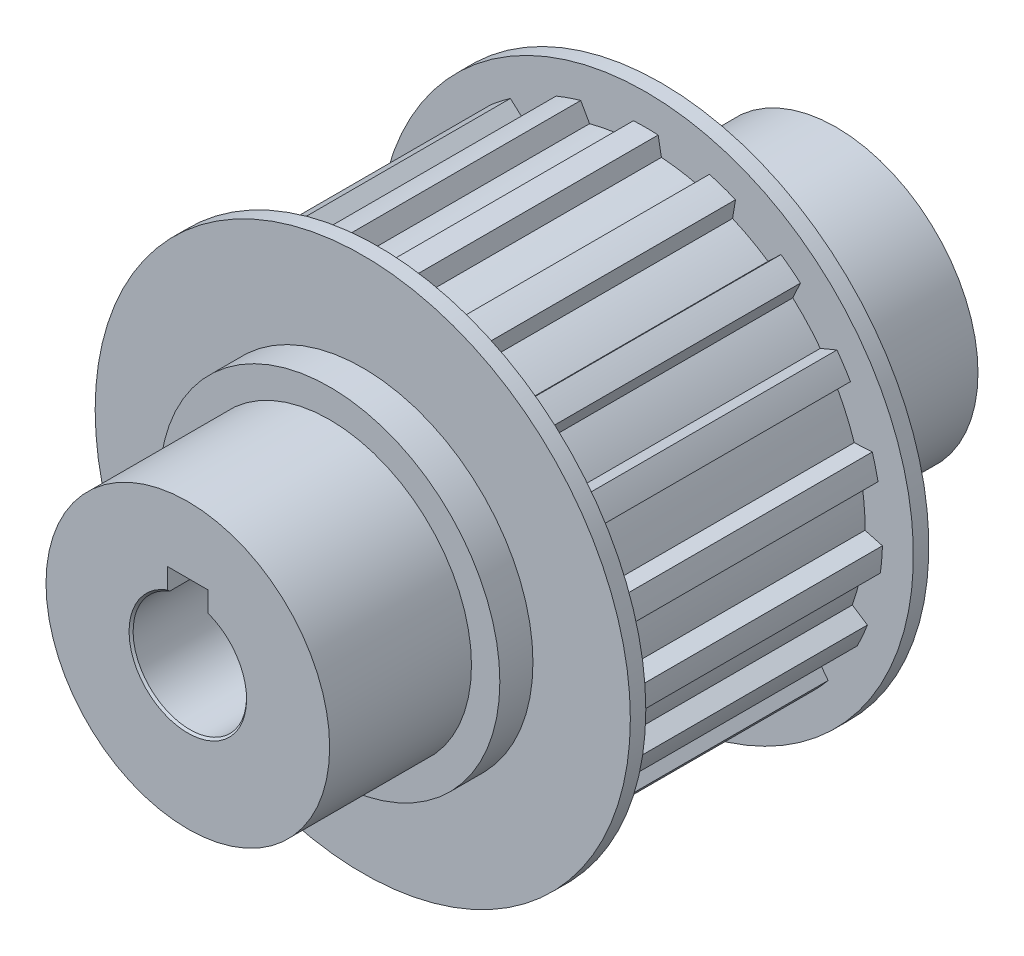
ISO-10303-21;
HEADER;
FILE_DESCRIPTION(('STEP AP214'),'2;1');
FILE_NAME('part.step','',(''),(''),'','','');
FILE_SCHEMA(('AUTOMOTIVE_DESIGN { 1 0 10303 214 1 1 1 1 }'));
ENDSEC;
DATA;
#1=APPLICATION_CONTEXT('core data for automotive mechanical design processes');
#2=APPLICATION_PROTOCOL_DEFINITION('international standard','automotive_design',2000,#1);
#3=PRODUCT_CONTEXT('',#1,'mechanical');
#4=PRODUCT('Part','Part','',(#3));
#5=PRODUCT_RELATED_PRODUCT_CATEGORY('part','',(#4));
#6=PRODUCT_DEFINITION_FORMATION('','',#4);
#7=PRODUCT_DEFINITION_CONTEXT('part definition',#1,'design');
#8=PRODUCT_DEFINITION('design','',#6,#7);
#9=PRODUCT_DEFINITION_SHAPE('','',#8);
#10=(LENGTH_UNIT() NAMED_UNIT(*) SI_UNIT(.MILLI.,.METRE.));
#11=(NAMED_UNIT(*) PLANE_ANGLE_UNIT() SI_UNIT($,.RADIAN.));
#12=(NAMED_UNIT(*) SI_UNIT($,.STERADIAN.) SOLID_ANGLE_UNIT());
#13=UNCERTAINTY_MEASURE_WITH_UNIT(LENGTH_MEASURE(1.E-05),#10,'distance_accuracy_value','');
#14=(GEOMETRIC_REPRESENTATION_CONTEXT(3) GLOBAL_UNCERTAINTY_ASSIGNED_CONTEXT((#13)) GLOBAL_UNIT_ASSIGNED_CONTEXT((#10,
#11,#12)) REPRESENTATION_CONTEXT('',''));
#15=CARTESIAN_POINT('',(0.,0.,0.));
#16=DIRECTION('',(0.,0.,1.));
#17=DIRECTION('',(1.,0.,0.));
#18=AXIS2_PLACEMENT_3D('',#15,#16,#17);
#19=CARTESIAN_POINT('',(0.,0.,0.));
#20=DIRECTION('',(0.,0.,1.));
#21=DIRECTION('',(1.,0.,0.));
#22=AXIS2_PLACEMENT_3D('',#19,#20,#21);
#23=CYLINDRICAL_SURFACE('',#22,29.21);
#24=CARTESIAN_POINT('',(0.,0.,-16.51));
#25=DIRECTION('',(0.,0.,1.));
#26=DIRECTION('',(1.,0.,0.));
#27=AXIS2_PLACEMENT_3D('',#24,#25,#26);
#28=CIRCLE('',#27,29.21);
#29=CARTESIAN_POINT('',(-1.524,29.1702163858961,-16.51));
#30=VERTEX_POINT('',#29);
#31=CARTESIAN_POINT('',(1.524,29.1702163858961,-16.51));
#32=VERTEX_POINT('',#31);
#33=EDGE_CURVE('E532',#30,#32,#28,.F.);
#34=ORIENTED_EDGE('',*,*,#33,.F.);
#35=DIRECTION('',(0.,0.,1.));
#36=VECTOR('',#35,1.);
#37=CARTESIAN_POINT('',(-1.524,29.1702163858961,0.));
#38=LINE('',#37,#36);
#39=CARTESIAN_POINT('',(-1.524,29.1702163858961,16.51));
#40=VERTEX_POINT('',#39);
#41=EDGE_CURVE('E531',#40,#30,#38,.F.);
#42=ORIENTED_EDGE('',*,*,#41,.F.);
#43=CARTESIAN_POINT('',(0.,0.,16.51));
#44=DIRECTION('',(0.,0.,1.));
#45=DIRECTION('',(1.,0.,0.));
#46=AXIS2_PLACEMENT_3D('',#43,#44,#45);
#47=CIRCLE('',#46,29.21);
#48=CARTESIAN_POINT('',(1.524,29.1702163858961,16.51));
#49=VERTEX_POINT('',#48);
#50=EDGE_CURVE('E19',#49,#40,#47,.T.);
#51=ORIENTED_EDGE('',*,*,#50,.F.);
#52=DIRECTION('',(0.,0.,1.));
#53=VECTOR('',#52,1.);
#54=CARTESIAN_POINT('',(1.524,29.1702163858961,0.));
#55=LINE('',#54,#53);
#56=EDGE_CURVE('E513',#32,#49,#55,.T.);
#57=ORIENTED_EDGE('',*,*,#56,.F.);
#58=EDGE_LOOP('',(#34,#42,#51,#57));
#59=FACE_BOUND('',#58,.T.);
#60=ADVANCED_FACE('F15',(#59),#23,.T.);
#61=CARTESIAN_POINT('',(1.524,29.1702163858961,0.));
#62=DIRECTION('',(0.983423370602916,0.181324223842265,0.));
#63=DIRECTION('',(-0.181324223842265,0.983423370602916,0.));
#64=AXIS2_PLACEMENT_3D('',#61,#62,#63);
#65=PLANE('',#64);
#66=DIRECTION('',(0.181324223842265,-0.983423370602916,0.));
#67=VECTOR('',#66,1.);
#68=CARTESIAN_POINT('',(1.524,29.1702163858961,-16.51));
#69=LINE('',#68,#67);
#70=CARTESIAN_POINT('',(1.92741928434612,26.9822464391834,-16.51));
#71=VERTEX_POINT('',#70);
#72=EDGE_CURVE('E929',#32,#71,#69,.T.);
#73=ORIENTED_EDGE('',*,*,#72,.F.);
#74=ORIENTED_EDGE('',*,*,#56,.T.);
#75=DIRECTION('',(-0.181324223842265,0.983423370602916,0.));
#76=VECTOR('',#75,1.);
#77=CARTESIAN_POINT('',(1.92741928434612,26.9822464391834,16.51));
#78=LINE('',#77,#76);
#79=CARTESIAN_POINT('',(1.92741928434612,26.9822464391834,16.51));
#80=VERTEX_POINT('',#79);
#81=EDGE_CURVE('E527',#80,#49,#78,.T.);
#82=ORIENTED_EDGE('',*,*,#81,.F.);
#83=DIRECTION('',(0.,0.,1.));
#84=VECTOR('',#83,1.);
#85=CARTESIAN_POINT('',(1.92741928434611,26.9822464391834,0.));
#86=LINE('',#85,#84);
#87=EDGE_CURVE('E690',#71,#80,#86,.T.);
#88=ORIENTED_EDGE('',*,*,#87,.F.);
#89=EDGE_LOOP('',(#73,#74,#82,#88));
#90=FACE_BOUND('',#89,.T.);
#91=ADVANCED_FACE('F1941',(#90),#65,.T.);
#92=CARTESIAN_POINT('',(0.,0.,0.));
#93=DIRECTION('',(0.,0.,1.));
#94=DIRECTION('',(1.,0.,0.));
#95=AXIS2_PLACEMENT_3D('',#92,#93,#94);
#96=CYLINDRICAL_SURFACE('',#95,27.0509993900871);
#97=CARTESIAN_POINT('',(0.,0.,-16.51));
#98=DIRECTION('',(0.,0.,1.));
#99=DIRECTION('',(1.,0.,0.));
#100=AXIS2_PLACEMENT_3D('',#97,#98,#99);
#101=CIRCLE('',#100,27.0509993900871);
#102=CARTESIAN_POINT('',(6.93813470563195,26.1461059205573,-16.51));
#103=VERTEX_POINT('',#102);
#104=EDGE_CURVE('E927',#71,#103,#101,.F.);
#105=ORIENTED_EDGE('',*,*,#104,.F.);
#106=ORIENTED_EDGE('',*,*,#87,.T.);
#107=CARTESIAN_POINT('',(0.,0.,16.51));
#108=DIRECTION('',(0.,0.,1.));
#109=DIRECTION('',(1.,0.,0.));
#110=AXIS2_PLACEMENT_3D('',#107,#108,#109);
#111=CIRCLE('',#110,27.0509993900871);
#112=CARTESIAN_POINT('',(6.93813470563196,26.1461059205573,16.51));
#113=VERTEX_POINT('',#112);
#114=EDGE_CURVE('E932',#113,#80,#111,.T.);
#115=ORIENTED_EDGE('',*,*,#114,.F.);
#116=DIRECTION('',(0.,0.,1.));
#117=VECTOR('',#116,1.);
#118=CARTESIAN_POINT('',(6.93813470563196,26.1461059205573,0.));
#119=LINE('',#118,#117);
#120=EDGE_CURVE('E688',#103,#113,#119,.T.);
#121=ORIENTED_EDGE('',*,*,#120,.F.);
#122=EDGE_LOOP('',(#105,#106,#115,#121));
#123=FACE_BOUND('',#122,.T.);
#124=ADVANCED_FACE('F1933',(#123),#96,.T.);
#125=CARTESIAN_POINT('',(6.93813470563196,26.1461059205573,0.));
#126=DIRECTION('',(-0.908770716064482,0.417295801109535,0.));
#127=DIRECTION('',(-0.417295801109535,-0.908770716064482,0.));
#128=AXIS2_PLACEMENT_3D('',#125,#126,#127);
#129=PLANE('',#128);
#130=DIRECTION('',(0.417295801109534,0.908770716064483,0.));
#131=VECTOR('',#130,1.);
#132=CARTESIAN_POINT('',(6.93813470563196,26.1461059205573,-16.51));
#133=LINE('',#132,#131);
#134=CARTESIAN_POINT('',(7.85141826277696,28.1350196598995,-16.51));
#135=VERTEX_POINT('',#134);
#136=EDGE_CURVE('E925',#103,#135,#133,.T.);
#137=ORIENTED_EDGE('',*,*,#136,.F.);
#138=ORIENTED_EDGE('',*,*,#120,.T.);
#139=DIRECTION('',(-0.417295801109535,-0.908770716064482,0.));
#140=VECTOR('',#139,1.);
#141=CARTESIAN_POINT('',(7.85141826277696,28.1350196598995,16.51));
#142=LINE('',#141,#140);
#143=CARTESIAN_POINT('',(7.85141826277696,28.1350196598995,16.51));
#144=VERTEX_POINT('',#143);
#145=EDGE_CURVE('E934',#144,#113,#142,.T.);
#146=ORIENTED_EDGE('',*,*,#145,.F.);
#147=DIRECTION('',(0.,0.,1.));
#148=VECTOR('',#147,1.);
#149=CARTESIAN_POINT('',(7.85141826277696,28.1350196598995,0.));
#150=LINE('',#149,#148);
#151=EDGE_CURVE('E686',#135,#144,#150,.T.);
#152=ORIENTED_EDGE('',*,*,#151,.F.);
#153=EDGE_LOOP('',(#137,#138,#146,#152));
#154=FACE_BOUND('',#153,.T.);
#155=ADVANCED_FACE('F1925',(#154),#129,.T.);
#156=CARTESIAN_POINT('',(0.,0.,0.));
#157=DIRECTION('',(0.,0.,1.));
#158=DIRECTION('',(1.,0.,0.));
#159=AXIS2_PLACEMENT_3D('',#156,#157,#158);
#160=CYLINDRICAL_SURFACE('',#159,29.21);
#161=CARTESIAN_POINT('',(0.,0.,-16.51));
#162=DIRECTION('',(0.,0.,1.));
#163=DIRECTION('',(1.,0.,0.));
#164=AXIS2_PLACEMENT_3D('',#161,#162,#163);
#165=CIRCLE('',#164,29.21);
#166=CARTESIAN_POINT('',(11.0725078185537,27.0300512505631,-16.51));
#167=VERTEX_POINT('',#166);
#168=EDGE_CURVE('E923',#135,#167,#165,.F.);
#169=ORIENTED_EDGE('',*,*,#168,.F.);
#170=ORIENTED_EDGE('',*,*,#151,.T.);
#171=CARTESIAN_POINT('',(0.,0.,16.51));
#172=DIRECTION('',(0.,0.,1.));
#173=DIRECTION('',(1.,0.,0.));
#174=AXIS2_PLACEMENT_3D('',#171,#172,#173);
#175=CIRCLE('',#174,29.21);
#176=CARTESIAN_POINT('',(11.0725078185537,27.0300512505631,16.51));
#177=VERTEX_POINT('',#176);
#178=EDGE_CURVE('E935',#177,#144,#175,.T.);
#179=ORIENTED_EDGE('',*,*,#178,.F.);
#180=DIRECTION('',(0.,0.,1.));
#181=VECTOR('',#180,1.);
#182=CARTESIAN_POINT('',(11.0725078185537,27.0300512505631,0.));
#183=LINE('',#182,#181);
#184=EDGE_CURVE('E684',#167,#177,#183,.T.);
#185=ORIENTED_EDGE('',*,*,#184,.F.);
#186=EDGE_LOOP('',(#169,#170,#179,#185));
#187=FACE_BOUND('',#186,.T.);
#188=ADVANCED_FACE('F1917',(#187),#160,.T.);
#189=CARTESIAN_POINT('',(11.0725078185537,27.0300512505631,0.));
#190=DIRECTION('',(0.986361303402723,-0.164594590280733,0.));
#191=DIRECTION('',(0.164594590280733,0.986361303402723,0.));
#192=AXIS2_PLACEMENT_3D('',#189,#190,#191);
#193=PLANE('',#192);
#194=DIRECTION('',(-0.164594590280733,-0.986361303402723,0.));
#195=VECTOR('',#194,1.);
#196=CARTESIAN_POINT('',(11.0725078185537,27.0300512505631,-16.51));
#197=LINE('',#196,#195);
#198=CARTESIAN_POINT('',(10.7073348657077,24.8416897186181,-16.51));
#199=VERTEX_POINT('',#198);
#200=EDGE_CURVE('E921',#167,#199,#197,.T.);
#201=ORIENTED_EDGE('',*,*,#200,.F.);
#202=ORIENTED_EDGE('',*,*,#184,.T.);
#203=DIRECTION('',(0.164594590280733,0.986361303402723,0.));
#204=VECTOR('',#203,1.);
#205=CARTESIAN_POINT('',(10.7073348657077,24.8416897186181,16.51));
#206=LINE('',#205,#204);
#207=CARTESIAN_POINT('',(10.7073348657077,24.8416897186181,16.51));
#208=VERTEX_POINT('',#207);
#209=EDGE_CURVE('E938',#208,#177,#206,.T.);
#210=ORIENTED_EDGE('',*,*,#209,.F.);
#211=DIRECTION('',(0.,0.,1.));
#212=VECTOR('',#211,1.);
#213=CARTESIAN_POINT('',(10.7073348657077,24.8416897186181,0.));
#214=LINE('',#213,#212);
#215=EDGE_CURVE('E682',#199,#208,#214,.T.);
#216=ORIENTED_EDGE('',*,*,#215,.F.);
#217=EDGE_LOOP('',(#201,#202,#210,#216));
#218=FACE_BOUND('',#217,.T.);
#219=ADVANCED_FACE('F1909',(#218),#193,.T.);
#220=CARTESIAN_POINT('',(0.,0.,0.));
#221=DIRECTION('',(0.,0.,1.));
#222=DIRECTION('',(1.,0.,0.));
#223=AXIS2_PLACEMENT_3D('',#220,#221,#222);
#224=CYLINDRICAL_SURFACE('',#223,27.0509993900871);
#225=CARTESIAN_POINT('',(0.,0.,-16.51));
#226=DIRECTION('',(0.,0.,1.));
#227=DIRECTION('',(1.,0.,0.));
#228=AXIS2_PLACEMENT_3D('',#225,#226,#227);
#229=CIRCLE('',#228,27.0509993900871);
#230=CARTESIAN_POINT('',(15.0844039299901,22.4547840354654,-16.51));
#231=VERTEX_POINT('',#230);
#232=EDGE_CURVE('E919',#199,#231,#229,.F.);
#233=ORIENTED_EDGE('',*,*,#232,.F.);
#234=ORIENTED_EDGE('',*,*,#215,.T.);
#235=CARTESIAN_POINT('',(0.,0.,16.51));
#236=DIRECTION('',(0.,0.,1.));
#237=DIRECTION('',(1.,0.,0.));
#238=AXIS2_PLACEMENT_3D('',#235,#236,#237);
#239=CIRCLE('',#238,27.0509993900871);
#240=CARTESIAN_POINT('',(15.0844039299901,22.4547840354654,16.51));
#241=VERTEX_POINT('',#240);
#242=EDGE_CURVE('E939',#241,#208,#239,.T.);
#243=ORIENTED_EDGE('',*,*,#242,.F.);
#244=DIRECTION('',(0.,0.,1.));
#245=VECTOR('',#244,1.);
#246=CARTESIAN_POINT('',(15.0844039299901,22.4547840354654,0.));
#247=LINE('',#246,#245);
#248=EDGE_CURVE('E680',#231,#241,#247,.T.);
#249=ORIENTED_EDGE('',*,*,#248,.F.);
#250=EDGE_LOOP('',(#233,#234,#243,#249));
#251=FACE_BOUND('',#250,.T.);
#252=ADVANCED_FACE('F1901',(#251),#224,.T.);
#253=CARTESIAN_POINT('',(15.0844039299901,22.4547840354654,0.));
#254=DIRECTION('',(-0.689624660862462,0.724166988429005,0.));
#255=DIRECTION('',(-0.724166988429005,-0.689624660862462,0.));
#256=AXIS2_PLACEMENT_3D('',#253,#254,#255);
#257=PLANE('',#256);
#258=DIRECTION('',(0.724166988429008,0.689624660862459,0.));
#259=VECTOR('',#258,1.);
#260=CARTESIAN_POINT('',(15.0844039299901,22.4547840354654,-16.51));
#261=LINE('',#260,#259);
#262=CARTESIAN_POINT('',(16.6829866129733,23.9771152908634,-16.51));
#263=VERTEX_POINT('',#262);
#264=EDGE_CURVE('E917',#231,#263,#261,.T.);
#265=ORIENTED_EDGE('',*,*,#264,.F.);
#266=ORIENTED_EDGE('',*,*,#248,.T.);
#267=DIRECTION('',(-0.724166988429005,-0.689624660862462,0.));
#268=VECTOR('',#267,1.);
#269=CARTESIAN_POINT('',(16.6829866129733,23.9771152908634,16.51));
#270=LINE('',#269,#268);
#271=CARTESIAN_POINT('',(16.6829866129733,23.9771152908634,16.51));
#272=VERTEX_POINT('',#271);
#273=EDGE_CURVE('E942',#272,#241,#270,.T.);
#274=ORIENTED_EDGE('',*,*,#273,.F.);
#275=DIRECTION('',(0.,0.,1.));
#276=VECTOR('',#275,1.);
#277=CARTESIAN_POINT('',(16.6829866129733,23.9771152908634,0.));
#278=LINE('',#277,#276);
#279=EDGE_CURVE('E678',#263,#272,#278,.T.);
#280=ORIENTED_EDGE('',*,*,#279,.F.);
#281=EDGE_LOOP('',(#265,#266,#274,#280));
#282=FACE_BOUND('',#281,.T.);
#283=ADVANCED_FACE('F1893',(#282),#257,.T.);
#284=CARTESIAN_POINT('',(0.,0.,0.));
#285=DIRECTION('',(0.,0.,1.));
#286=DIRECTION('',(1.,0.,0.));
#287=AXIS2_PLACEMENT_3D('',#284,#285,#286);
#288=CYLINDRICAL_SURFACE('',#287,29.21);
#289=CARTESIAN_POINT('',(0.,0.,-16.51));
#290=DIRECTION('',(0.,0.,1.));
#291=DIRECTION('',(1.,0.,0.));
#292=AXIS2_PLACEMENT_3D('',#289,#290,#291);
#293=CIRCLE('',#292,29.21);
#294=CARTESIAN_POINT('',(19.07738962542,22.1196135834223,-16.51));
#295=VERTEX_POINT('',#294);
#296=EDGE_CURVE('E915',#263,#295,#293,.F.);
#297=ORIENTED_EDGE('',*,*,#296,.F.);
#298=ORIENTED_EDGE('',*,*,#279,.T.);
#299=CARTESIAN_POINT('',(0.,0.,16.51));
#300=DIRECTION('',(0.,0.,1.));
#301=DIRECTION('',(1.,0.,0.));
#302=AXIS2_PLACEMENT_3D('',#299,#300,#301);
#303=CIRCLE('',#302,29.21);
#304=CARTESIAN_POINT('',(19.07738962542,22.1196135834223,16.51));
#305=VERTEX_POINT('',#304);
#306=EDGE_CURVE('E943',#305,#272,#303,.T.);
#307=ORIENTED_EDGE('',*,*,#306,.F.);
#308=DIRECTION('',(0.,0.,1.));
#309=VECTOR('',#308,1.);
#310=CARTESIAN_POINT('',(19.07738962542,22.1196135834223,0.));
#311=LINE('',#310,#309);
#312=EDGE_CURVE('E676',#295,#305,#311,.T.);
#313=ORIENTED_EDGE('',*,*,#312,.F.);
#314=EDGE_LOOP('',(#297,#298,#307,#313));
#315=FACE_BOUND('',#314,.T.);
#316=ADVANCED_FACE('F1885',(#315),#288,.T.);
#317=CARTESIAN_POINT('',(19.07738962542,22.1196135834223,0.));
#318=DIRECTION('',(0.908770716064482,-0.417295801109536,0.));
#319=DIRECTION('',(0.417295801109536,0.908770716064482,0.));
#320=AXIS2_PLACEMENT_3D('',#317,#318,#319);
#321=PLANE('',#320);
#322=DIRECTION('',(-0.417295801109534,-0.908770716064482,0.));
#323=VECTOR('',#322,1.);
#324=CARTESIAN_POINT('',(19.07738962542,22.1196135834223,-16.51));
#325=LINE('',#324,#323);
#326=CARTESIAN_POINT('',(18.1364655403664,20.0705053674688,-16.51));
#327=VERTEX_POINT('',#326);
#328=EDGE_CURVE('E913',#295,#327,#325,.T.);
#329=ORIENTED_EDGE('',*,*,#328,.F.);
#330=ORIENTED_EDGE('',*,*,#312,.T.);
#331=DIRECTION('',(0.417295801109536,0.908770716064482,0.));
#332=VECTOR('',#331,1.);
#333=CARTESIAN_POINT('',(18.1364655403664,20.0705053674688,16.51));
#334=LINE('',#333,#332);
#335=CARTESIAN_POINT('',(18.1364655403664,20.0705053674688,16.51));
#336=VERTEX_POINT('',#335);
#337=EDGE_CURVE('E946',#336,#305,#334,.T.);
#338=ORIENTED_EDGE('',*,*,#337,.F.);
#339=DIRECTION('',(0.,0.,1.));
#340=VECTOR('',#339,1.);
#341=CARTESIAN_POINT('',(18.1364655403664,20.0705053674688,0.));
#342=LINE('',#341,#340);
#343=EDGE_CURVE('E674',#327,#336,#342,.T.);
#344=ORIENTED_EDGE('',*,*,#343,.F.);
#345=EDGE_LOOP('',(#329,#330,#338,#344));
#346=FACE_BOUND('',#345,.T.);
#347=ADVANCED_FACE('F1877',(#346),#321,.T.);
#348=CARTESIAN_POINT('',(0.,0.,0.));
#349=DIRECTION('',(0.,0.,1.));
#350=DIRECTION('',(1.,0.,0.));
#351=AXIS2_PLACEMENT_3D('',#348,#349,#350);
#352=CYLINDRICAL_SURFACE('',#351,27.0509993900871);
#353=CARTESIAN_POINT('',(0.,0.,-16.51));
#354=DIRECTION('',(0.,0.,1.));
#355=DIRECTION('',(1.,0.,0.));
#356=AXIS2_PLACEMENT_3D('',#353,#354,#355);
#357=CIRCLE('',#356,27.0509993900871);
#358=CARTESIAN_POINT('',(21.5344337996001,16.3714608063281,-16.51));
#359=VERTEX_POINT('',#358);
#360=EDGE_CURVE('E911',#327,#359,#357,.F.);
#361=ORIENTED_EDGE('',*,*,#360,.F.);
#362=ORIENTED_EDGE('',*,*,#343,.T.);
#363=CARTESIAN_POINT('',(0.,0.,16.51));
#364=DIRECTION('',(0.,0.,1.));
#365=DIRECTION('',(1.,0.,0.));
#366=AXIS2_PLACEMENT_3D('',#363,#364,#365);
#367=CIRCLE('',#366,27.0509993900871);
#368=CARTESIAN_POINT('',(21.5344337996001,16.3714608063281,16.51));
#369=VERTEX_POINT('',#368);
#370=EDGE_CURVE('E947',#369,#336,#367,.T.);
#371=ORIENTED_EDGE('',*,*,#370,.F.);
#372=DIRECTION('',(0.,0.,1.));
#373=VECTOR('',#372,1.);
#374=CARTESIAN_POINT('',(21.5344337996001,16.3714608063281,0.));
#375=LINE('',#374,#373);
#376=EDGE_CURVE('E672',#359,#369,#375,.T.);
#377=ORIENTED_EDGE('',*,*,#376,.F.);
#378=EDGE_LOOP('',(#361,#362,#371,#377));
#379=FACE_BOUND('',#378,.T.);
#380=ADVANCED_FACE('F1869',(#379),#352,.T.);
#381=CARTESIAN_POINT('',(21.5344337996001,16.3714608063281,0.));
#382=DIRECTION('',(-0.3860830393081,0.922464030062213,0.));
#383=DIRECTION('',(-0.922464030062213,-0.3860830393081,0.));
#384=AXIS2_PLACEMENT_3D('',#381,#382,#383);
#385=PLANE('',#384);
#386=DIRECTION('',(0.922464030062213,0.386083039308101,0.));
#387=VECTOR('',#386,1.);
#388=CARTESIAN_POINT('',(21.5344337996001,16.3714608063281,-16.51));
#389=LINE('',#388,#387);
#390=CARTESIAN_POINT('',(23.5867783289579,17.2304378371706,-16.51));
#391=VERTEX_POINT('',#390);
#392=EDGE_CURVE('E909',#359,#391,#389,.T.);
#393=ORIENTED_EDGE('',*,*,#392,.F.);
#394=ORIENTED_EDGE('',*,*,#376,.T.);
#395=DIRECTION('',(-0.922464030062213,-0.3860830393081,0.));
#396=VECTOR('',#395,1.);
#397=CARTESIAN_POINT('',(23.586778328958,17.2304378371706,16.51));
#398=LINE('',#397,#396);
#399=CARTESIAN_POINT('',(23.5867783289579,17.2304378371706,16.51));
#400=VERTEX_POINT('',#399);
#401=EDGE_CURVE('E950',#400,#369,#398,.T.);
#402=ORIENTED_EDGE('',*,*,#401,.F.);
#403=DIRECTION('',(0.,0.,1.));
#404=VECTOR('',#403,1.);
#405=CARTESIAN_POINT('',(23.5867783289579,17.2304378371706,0.));
#406=LINE('',#405,#404);
#407=EDGE_CURVE('E670',#391,#400,#406,.T.);
#408=ORIENTED_EDGE('',*,*,#407,.F.);
#409=EDGE_LOOP('',(#393,#394,#402,#408));
#410=FACE_BOUND('',#409,.T.);
#411=ADVANCED_FACE('F1861',(#410),#385,.T.);
#412=CARTESIAN_POINT('',(0.,0.,0.));
#413=DIRECTION('',(0.,0.,1.));
#414=DIRECTION('',(1.,0.,0.));
#415=AXIS2_PLACEMENT_3D('',#412,#413,#414);
#416=CYLINDRICAL_SURFACE('',#415,29.21);
#417=CARTESIAN_POINT('',(0.,0.,-16.51));
#418=DIRECTION('',(0.,0.,1.));
#419=DIRECTION('',(1.,0.,0.));
#420=AXIS2_PLACEMENT_3D('',#417,#418,#419);
#421=CIRCLE('',#420,29.21);
#422=CARTESIAN_POINT('',(25.2542665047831,14.6780830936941,-16.51));
#423=VERTEX_POINT('',#422);
#424=EDGE_CURVE('E907',#391,#423,#421,.F.);
#425=ORIENTED_EDGE('',*,*,#424,.F.);
#426=ORIENTED_EDGE('',*,*,#407,.T.);
#427=CARTESIAN_POINT('',(0.,0.,16.51));
#428=DIRECTION('',(0.,0.,1.));
#429=DIRECTION('',(1.,0.,0.));
#430=AXIS2_PLACEMENT_3D('',#427,#428,#429);
#431=CIRCLE('',#430,29.21);
#432=CARTESIAN_POINT('',(25.2542665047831,14.6780830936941,16.51));
#433=VERTEX_POINT('',#432);
#434=EDGE_CURVE('E951',#433,#400,#431,.T.);
#435=ORIENTED_EDGE('',*,*,#434,.F.);
#436=DIRECTION('',(0.,0.,1.));
#437=VECTOR('',#436,1.);
#438=CARTESIAN_POINT('',(25.2542665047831,14.6780830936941,0.));
#439=LINE('',#438,#437);
#440=EDGE_CURVE('E668',#423,#433,#439,.T.);
#441=ORIENTED_EDGE('',*,*,#440,.F.);
#442=EDGE_LOOP('',(#425,#426,#435,#441));
#443=FACE_BOUND('',#442,.T.);
#444=ADVANCED_FACE('F1853',(#443),#416,.T.);
#445=CARTESIAN_POINT('',(25.2542665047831,14.6780830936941,0.));
#446=DIRECTION('',(0.689624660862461,-0.724166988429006,0.));
#447=DIRECTION('',(0.724166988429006,0.689624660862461,0.));
#448=AXIS2_PLACEMENT_3D('',#445,#446,#447);
#449=PLANE('',#448);
#450=DIRECTION('',(-0.724166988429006,-0.689624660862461,0.));
#451=VECTOR('',#450,1.);
#452=CARTESIAN_POINT('',(25.2542665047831,14.6780830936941,-16.51));
#453=LINE('',#452,#451);
#454=CARTESIAN_POINT('',(23.6431241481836,13.1437912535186,-16.51));
#455=VERTEX_POINT('',#454);
#456=EDGE_CURVE('E905',#423,#455,#453,.T.);
#457=ORIENTED_EDGE('',*,*,#456,.F.);
#458=ORIENTED_EDGE('',*,*,#440,.T.);
#459=DIRECTION('',(0.724166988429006,0.689624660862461,0.));
#460=VECTOR('',#459,1.);
#461=CARTESIAN_POINT('',(23.6431241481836,13.1437912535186,16.51));
#462=LINE('',#461,#460);
#463=CARTESIAN_POINT('',(23.6431241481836,13.1437912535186,16.51));
#464=VERTEX_POINT('',#463);
#465=EDGE_CURVE('E954',#464,#433,#462,.T.);
#466=ORIENTED_EDGE('',*,*,#465,.F.);
#467=DIRECTION('',(0.,0.,1.));
#468=VECTOR('',#467,1.);
#469=CARTESIAN_POINT('',(23.6431241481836,13.1437912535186,0.));
#470=LINE('',#469,#468);
#471=EDGE_CURVE('E666',#455,#464,#470,.T.);
#472=ORIENTED_EDGE('',*,*,#471,.F.);
#473=EDGE_LOOP('',(#457,#458,#466,#472));
#474=FACE_BOUND('',#473,.T.);
#475=ADVANCED_FACE('F1845',(#474),#449,.T.);
#476=CARTESIAN_POINT('',(0.,0.,0.));
#477=DIRECTION('',(0.,0.,1.));
#478=DIRECTION('',(1.,0.,0.));
#479=AXIS2_PLACEMENT_3D('',#476,#477,#478);
#480=CYLINDRICAL_SURFACE('',#479,27.0509993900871);
#481=CARTESIAN_POINT('',(0.,0.,-16.51));
#482=DIRECTION('',(0.,0.,1.));
#483=DIRECTION('',(1.,0.,0.));
#484=AXIS2_PLACEMENT_3D('',#481,#482,#483);
#485=CIRCLE('',#484,27.0509993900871);
#486=CARTESIAN_POINT('',(25.7165817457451,8.39130450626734,-16.51));
#487=VERTEX_POINT('',#486);
#488=EDGE_CURVE('E903',#455,#487,#485,.F.);
#489=ORIENTED_EDGE('',*,*,#488,.F.);
#490=ORIENTED_EDGE('',*,*,#471,.T.);
#491=CARTESIAN_POINT('',(0.,0.,16.51));
#492=DIRECTION('',(0.,0.,1.));
#493=DIRECTION('',(1.,0.,0.));
#494=AXIS2_PLACEMENT_3D('',#491,#492,#493);
#495=CIRCLE('',#494,27.0509993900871);
#496=CARTESIAN_POINT('',(25.7165817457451,8.39130450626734,16.51));
#497=VERTEX_POINT('',#496);
#498=EDGE_CURVE('E955',#497,#464,#495,.T.);
#499=ORIENTED_EDGE('',*,*,#498,.F.);
#500=DIRECTION('',(0.,0.,1.));
#501=VECTOR('',#500,1.);
#502=CARTESIAN_POINT('',(25.7165817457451,8.39130450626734,0.));
#503=LINE('',#502,#501);
#504=EDGE_CURVE('E664',#487,#497,#503,.T.);
#505=ORIENTED_EDGE('',*,*,#504,.F.);
#506=EDGE_LOOP('',(#489,#490,#499,#505));
#507=FACE_BOUND('',#506,.T.);
#508=ADVANCED_FACE('F1837',(#507),#480,.T.);
#509=CARTESIAN_POINT('',(25.7165817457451,8.39130450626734,0.));
#510=DIRECTION('',(-0.052173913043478,0.998638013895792,0.));
#511=DIRECTION('',(-0.998638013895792,-0.052173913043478,0.));
#512=AXIS2_PLACEMENT_3D('',#509,#510,#511);
#513=PLANE('',#512);
#514=DIRECTION('',(0.998638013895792,0.0521739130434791,0.));
#515=VECTOR('',#514,1.);
#516=CARTESIAN_POINT('',(25.7165817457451,8.39130450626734,-16.51));
#517=LINE('',#516,#515);
#518=CARTESIAN_POINT('',(27.9435845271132,8.50765442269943,-16.51));
#519=VERTEX_POINT('',#518);
#520=EDGE_CURVE('E901',#487,#519,#517,.T.);
#521=ORIENTED_EDGE('',*,*,#520,.F.);
#522=ORIENTED_EDGE('',*,*,#504,.T.);
#523=DIRECTION('',(-0.998638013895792,-0.0521739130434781,0.));
#524=VECTOR('',#523,1.);
#525=CARTESIAN_POINT('',(27.9435845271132,8.50765442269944,16.51));
#526=LINE('',#525,#524);
#527=CARTESIAN_POINT('',(27.9435845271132,8.50765442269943,16.51));
#528=VERTEX_POINT('',#527);
#529=EDGE_CURVE('E958',#528,#497,#526,.T.);
#530=ORIENTED_EDGE('',*,*,#529,.F.);
#531=DIRECTION('',(0.,0.,1.));
#532=VECTOR('',#531,1.);
#533=CARTESIAN_POINT('',(27.9435845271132,8.50765442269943,0.));
#534=LINE('',#533,#532);
#535=EDGE_CURVE('E662',#519,#528,#534,.T.);
#536=ORIENTED_EDGE('',*,*,#535,.F.);
#537=EDGE_LOOP('',(#521,#522,#530,#536));
#538=FACE_BOUND('',#537,.T.);
#539=ADVANCED_FACE('F1829',(#538),#513,.T.);
#540=CARTESIAN_POINT('',(0.,0.,0.));
#541=DIRECTION('',(0.,0.,1.));
#542=DIRECTION('',(1.,0.,0.));
#543=AXIS2_PLACEMENT_3D('',#540,#541,#542);
#544=CYLINDRICAL_SURFACE('',#543,29.21);
#545=CARTESIAN_POINT('',(0.,0.,-16.51));
#546=DIRECTION('',(0.,0.,1.));
#547=DIRECTION('',(1.,0.,0.));
#548=AXIS2_PLACEMENT_3D('',#545,#546,#547);
#549=CIRCLE('',#548,29.21);
#550=CARTESIAN_POINT('',(28.651735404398,5.68349877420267,-16.51));
#551=VERTEX_POINT('',#550);
#552=EDGE_CURVE('E899',#519,#551,#549,.F.);
#553=ORIENTED_EDGE('',*,*,#552,.F.);
#554=ORIENTED_EDGE('',*,*,#535,.T.);
#555=CARTESIAN_POINT('',(0.,0.,16.51));
#556=DIRECTION('',(0.,0.,1.));
#557=DIRECTION('',(1.,0.,0.));
#558=AXIS2_PLACEMENT_3D('',#555,#556,#557);
#559=CIRCLE('',#558,29.21);
#560=CARTESIAN_POINT('',(28.651735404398,5.68349877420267,16.51));
#561=VERTEX_POINT('',#560);
#562=EDGE_CURVE('E959',#561,#528,#559,.T.);
#563=ORIENTED_EDGE('',*,*,#562,.F.);
#564=DIRECTION('',(0.,0.,1.));
#565=VECTOR('',#564,1.);
#566=CARTESIAN_POINT('',(28.651735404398,5.68349877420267,0.));
#567=LINE('',#566,#565);
#568=EDGE_CURVE('E660',#551,#561,#567,.T.);
#569=ORIENTED_EDGE('',*,*,#568,.F.);
#570=EDGE_LOOP('',(#553,#554,#563,#569));
#571=FACE_BOUND('',#570,.T.);
#572=ADVANCED_FACE('F1821',(#571),#544,.T.);
#573=CARTESIAN_POINT('',(28.651735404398,5.68349877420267,0.));
#574=DIRECTION('',(0.417191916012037,-0.908818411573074,0.));
#575=DIRECTION('',(0.908818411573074,0.417191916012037,0.));
#576=AXIS2_PLACEMENT_3D('',#573,#574,#575);
#577=PLANE('',#576);
#578=DIRECTION('',(-0.908818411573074,-0.417191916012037,0.));
#579=VECTOR('',#578,1.);
#580=CARTESIAN_POINT('',(28.651735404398,5.68349877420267,-16.51));
#581=LINE('',#580,#579);
#582=CARTESIAN_POINT('',(26.6297503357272,4.7553091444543,-16.51));
#583=VERTEX_POINT('',#582);
#584=EDGE_CURVE('E897',#551,#583,#581,.T.);
#585=ORIENTED_EDGE('',*,*,#584,.F.);
#586=ORIENTED_EDGE('',*,*,#568,.T.);
#587=DIRECTION('',(0.908818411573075,0.417191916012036,0.));
#588=VECTOR('',#587,1.);
#589=CARTESIAN_POINT('',(26.6297503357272,4.7553091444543,16.51));
#590=LINE('',#589,#588);
#591=CARTESIAN_POINT('',(26.6297503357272,4.7553091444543,16.51));
#592=VERTEX_POINT('',#591);
#593=EDGE_CURVE('E962',#592,#561,#590,.T.);
#594=ORIENTED_EDGE('',*,*,#593,.F.);
#595=DIRECTION('',(0.,0.,1.));
#596=VECTOR('',#595,1.);
#597=CARTESIAN_POINT('',(26.6297503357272,4.7553091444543,0.));
#598=LINE('',#597,#596);
#599=EDGE_CURVE('E658',#583,#592,#598,.T.);
#600=ORIENTED_EDGE('',*,*,#599,.F.);
#601=EDGE_LOOP('',(#585,#586,#594,#600));
#602=FACE_BOUND('',#601,.T.);
#603=ADVANCED_FACE('F1813',(#602),#577,.T.);
#604=CARTESIAN_POINT('',(0.,0.,0.));
#605=DIRECTION('',(0.,0.,1.));
#606=DIRECTION('',(1.,0.,0.));
#607=AXIS2_PLACEMENT_3D('',#604,#605,#606);
#608=CYLINDRICAL_SURFACE('',#607,27.0509993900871);
#609=CARTESIAN_POINT('',(0.,0.,-16.51));
#610=DIRECTION('',(0.,0.,1.));
#611=DIRECTION('',(1.,0.,0.));
#612=AXIS2_PLACEMENT_3D('',#609,#610,#611);
#613=CIRCLE('',#612,27.0509993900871);
#614=CARTESIAN_POINT('',(27.0492602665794,-0.306736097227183,-16.51));
#615=VERTEX_POINT('',#614);
#616=EDGE_CURVE('E895',#583,#615,#613,.F.);
#617=ORIENTED_EDGE('',*,*,#616,.F.);
#618=ORIENTED_EDGE('',*,*,#599,.T.);
#619=CARTESIAN_POINT('',(0.,0.,16.51));
#620=DIRECTION('',(0.,0.,1.));
#621=DIRECTION('',(1.,0.,0.));
#622=AXIS2_PLACEMENT_3D('',#619,#620,#621);
#623=CIRCLE('',#622,27.0509993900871);
#624=CARTESIAN_POINT('',(27.0492602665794,-0.306736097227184,16.51));
#625=VERTEX_POINT('',#624);
#626=EDGE_CURVE('E963',#625,#592,#623,.T.);
#627=ORIENTED_EDGE('',*,*,#626,.F.);
#628=DIRECTION('',(0.,0.,1.));
#629=VECTOR('',#628,1.);
#630=CARTESIAN_POINT('',(27.0492602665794,-0.306736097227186,0.));
#631=LINE('',#630,#629);
#632=EDGE_CURVE('E656',#615,#625,#631,.T.);
#633=ORIENTED_EDGE('',*,*,#632,.F.);
#634=EDGE_LOOP('',(#617,#618,#627,#633));
#635=FACE_BOUND('',#634,.T.);
#636=ADVANCED_FACE('F1805',(#635),#608,.T.);
#637=CARTESIAN_POINT('',(27.0492602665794,-0.306736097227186,0.));
#638=DIRECTION('',(0.261841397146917,0.965110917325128,0.));
#639=DIRECTION('',(-0.965110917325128,0.261841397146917,0.));
#640=AXIS2_PLACEMENT_3D('',#637,#638,#639);
#641=PLANE('',#640);
#642=DIRECTION('',(0.965110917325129,-0.261841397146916,0.));
#643=VECTOR('',#642,1.);
#644=CARTESIAN_POINT('',(27.0492602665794,-0.306736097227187,-16.51));
#645=LINE('',#644,#643);
#646=CARTESIAN_POINT('',(29.1964598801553,-0.889286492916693,-16.51));
#647=VERTEX_POINT('',#646);
#648=EDGE_CURVE('E893',#615,#647,#645,.T.);
#649=ORIENTED_EDGE('',*,*,#648,.F.);
#650=ORIENTED_EDGE('',*,*,#632,.T.);
#651=DIRECTION('',(-0.965110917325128,0.261841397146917,0.));
#652=VECTOR('',#651,1.);
#653=CARTESIAN_POINT('',(29.1964598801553,-0.889286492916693,16.51));
#654=LINE('',#653,#652);
#655=CARTESIAN_POINT('',(29.1964598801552,-0.889286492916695,16.51));
#656=VERTEX_POINT('',#655);
#657=EDGE_CURVE('E966',#656,#625,#654,.T.);
#658=ORIENTED_EDGE('',*,*,#657,.F.);
#659=DIRECTION('',(0.,0.,1.));
#660=VECTOR('',#659,1.);
#661=CARTESIAN_POINT('',(29.1964598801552,-0.8892864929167,0.));
#662=LINE('',#661,#660);
#663=EDGE_CURVE('E654',#647,#656,#662,.T.);
#664=ORIENTED_EDGE('',*,*,#663,.F.);
#665=EDGE_LOOP('',(#649,#650,#658,#664));
#666=FACE_BOUND('',#665,.T.);
#667=ADVANCED_FACE('F1797',(#666),#641,.T.);
#668=CARTESIAN_POINT('',(0.,0.,0.));
#669=DIRECTION('',(0.,0.,1.));
#670=DIRECTION('',(1.,0.,0.));
#671=AXIS2_PLACEMENT_3D('',#668,#669,#670);
#672=CYLINDRICAL_SURFACE('',#671,29.21);
#673=CARTESIAN_POINT('',(0.,0.,-16.51));
#674=DIRECTION('',(0.,0.,1.));
#675=DIRECTION('',(1.,0.,0.));
#676=AXIS2_PLACEMENT_3D('',#673,#674,#675);
#677=CIRCLE('',#676,29.21);
#678=CARTESIAN_POINT('',(28.9447343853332,-3.92765214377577,-16.51));
#679=VERTEX_POINT('',#678);
#680=EDGE_CURVE('E891',#647,#679,#677,.F.);
#681=ORIENTED_EDGE('',*,*,#680,.F.);
#682=ORIENTED_EDGE('',*,*,#663,.T.);
#683=CARTESIAN_POINT('',(0.,0.,16.51));
#684=DIRECTION('',(0.,0.,1.));
#685=DIRECTION('',(1.,0.,0.));
#686=AXIS2_PLACEMENT_3D('',#683,#684,#685);
#687=CIRCLE('',#686,29.21);
#688=CARTESIAN_POINT('',(28.9447343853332,-3.92765214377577,16.51));
#689=VERTEX_POINT('',#688);
#690=EDGE_CURVE('E967',#689,#656,#687,.T.);
#691=ORIENTED_EDGE('',*,*,#690,.F.);
#692=DIRECTION('',(0.,0.,1.));
#693=VECTOR('',#692,1.);
#694=CARTESIAN_POINT('',(28.9447343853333,-3.92765214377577,0.));
#695=LINE('',#694,#693);
#696=EDGE_CURVE('E652',#679,#689,#695,.T.);
#697=ORIENTED_EDGE('',*,*,#696,.F.);
#698=EDGE_LOOP('',(#681,#682,#691,#697));
#699=FACE_BOUND('',#698,.T.);
#700=ADVANCED_FACE('F1789',(#699),#672,.T.);
#701=CARTESIAN_POINT('',(28.9447343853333,-3.92765214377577,0.));
#702=DIRECTION('',(0.071251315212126,-0.997458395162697,0.));
#703=DIRECTION('',(0.997458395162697,0.071251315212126,0.));
#704=AXIS2_PLACEMENT_3D('',#701,#702,#703);
#705=PLANE('',#704);
#706=DIRECTION('',(-0.997458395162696,-0.0712513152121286,0.));
#707=VECTOR('',#706,1.);
#708=CARTESIAN_POINT('',(28.9447343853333,-3.92765214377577,-16.51));
#709=LINE('',#708,#707);
#710=CARTESIAN_POINT('',(26.7407671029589,-4.08508785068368,-16.51));
#711=VERTEX_POINT('',#710);
#712=EDGE_CURVE('E889',#679,#711,#709,.T.);
#713=ORIENTED_EDGE('',*,*,#712,.F.);
#714=ORIENTED_EDGE('',*,*,#696,.T.);
#715=DIRECTION('',(0.997458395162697,0.0712513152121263,0.));
#716=VECTOR('',#715,1.);
#717=CARTESIAN_POINT('',(26.7407671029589,-4.08508785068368,16.51));
#718=LINE('',#717,#716);
#719=CARTESIAN_POINT('',(26.7407671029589,-4.08508785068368,16.51));
#720=VERTEX_POINT('',#719);
#721=EDGE_CURVE('E970',#720,#689,#718,.T.);
#722=ORIENTED_EDGE('',*,*,#721,.F.);
#723=DIRECTION('',(0.,0.,1.));
#724=VECTOR('',#723,1.);
#725=CARTESIAN_POINT('',(26.7407671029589,-4.08508785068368,0.));
#726=LINE('',#725,#724);
#727=EDGE_CURVE('E650',#711,#720,#726,.T.);
#728=ORIENTED_EDGE('',*,*,#727,.F.);
#729=EDGE_LOOP('',(#713,#714,#722,#728));
#730=FACE_BOUND('',#729,.T.);
#731=ADVANCED_FACE('F1781',(#730),#705,.T.);
#732=CARTESIAN_POINT('',(0.,0.,0.));
#733=DIRECTION('',(0.,0.,1.));
#734=DIRECTION('',(1.,0.,0.));
#735=AXIS2_PLACEMENT_3D('',#732,#733,#734);
#736=CYLINDRICAL_SURFACE('',#735,27.0509993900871);
#737=CARTESIAN_POINT('',(0.,0.,-16.51));
#738=DIRECTION('',(0.,0.,1.));
#739=DIRECTION('',(1.,0.,0.));
#740=AXIS2_PLACEMENT_3D('',#737,#738,#739);
#741=CIRCLE('',#740,27.0509993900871);
#742=CARTESIAN_POINT('',(25.4838570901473,-9.0735657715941,-16.51));
#743=VERTEX_POINT('',#742);
#744=EDGE_CURVE('E887',#711,#743,#741,.F.);
#745=ORIENTED_EDGE('',*,*,#744,.F.);
#746=ORIENTED_EDGE('',*,*,#727,.T.);
#747=CARTESIAN_POINT('',(0.,0.,16.51));
#748=DIRECTION('',(0.,0.,1.));
#749=DIRECTION('',(1.,0.,0.));
#750=AXIS2_PLACEMENT_3D('',#747,#748,#749);
#751=CIRCLE('',#750,27.0509993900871);
#752=CARTESIAN_POINT('',(25.4838570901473,-9.0735657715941,16.51));
#753=VERTEX_POINT('',#752);
#754=EDGE_CURVE('E971',#753,#720,#751,.T.);
#755=ORIENTED_EDGE('',*,*,#754,.F.);
#756=DIRECTION('',(0.,0.,1.));
#757=VECTOR('',#756,1.);
#758=CARTESIAN_POINT('',(25.4838570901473,-9.0735657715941,0.));
#759=LINE('',#758,#757);
#760=EDGE_CURVE('E648',#743,#753,#759,.T.);
#761=ORIENTED_EDGE('',*,*,#760,.F.);
#762=EDGE_LOOP('',(#745,#746,#755,#761));
#763=FACE_BOUND('',#762,.T.);
#764=ADVANCED_FACE('F1773',(#763),#736,.T.);
#765=CARTESIAN_POINT('',(25.4838570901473,-9.0735657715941,0.));
#766=DIRECTION('',(0.547252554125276,0.836967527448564,0.));
#767=DIRECTION('',(-0.836967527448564,0.547252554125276,0.));
#768=AXIS2_PLACEMENT_3D('',#765,#766,#767);
#769=PLANE('',#768);
#770=DIRECTION('',(0.836967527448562,-0.547252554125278,0.));
#771=VECTOR('',#770,1.);
#772=CARTESIAN_POINT('',(25.4838570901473,-9.0735657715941,-16.51));
#773=LINE('',#772,#771);
#774=CARTESIAN_POINT('',(27.3388530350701,-10.2864578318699,-16.51));
#775=VERTEX_POINT('',#774);
#776=EDGE_CURVE('E885',#743,#775,#773,.T.);
#777=ORIENTED_EDGE('',*,*,#776,.F.);
#778=ORIENTED_EDGE('',*,*,#760,.T.);
#779=DIRECTION('',(-0.836967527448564,0.547252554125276,0.));
#780=VECTOR('',#779,1.);
#781=CARTESIAN_POINT('',(27.3388530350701,-10.2864578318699,16.51));
#782=LINE('',#781,#780);
#783=CARTESIAN_POINT('',(27.3388530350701,-10.2864578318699,16.51));
#784=VERTEX_POINT('',#783);
#785=EDGE_CURVE('E974',#784,#753,#782,.T.);
#786=ORIENTED_EDGE('',*,*,#785,.F.);
#787=DIRECTION('',(0.,0.,1.));
#788=VECTOR('',#787,1.);
#789=CARTESIAN_POINT('',(27.3388530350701,-10.2864578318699,0.));
#790=LINE('',#789,#788);
#791=EDGE_CURVE('E646',#775,#784,#790,.T.);
#792=ORIENTED_EDGE('',*,*,#791,.F.);
#793=EDGE_LOOP('',(#777,#778,#786,#792));
#794=FACE_BOUND('',#793,.T.);
#795=ADVANCED_FACE('F1765',(#794),#769,.T.);
#796=CARTESIAN_POINT('',(0.,0.,0.));
#797=DIRECTION('',(0.,0.,1.));
#798=DIRECTION('',(1.,0.,0.));
#799=AXIS2_PLACEMENT_3D('',#796,#797,#798);
#800=CYLINDRICAL_SURFACE('',#799,29.21);
#801=CARTESIAN_POINT('',(0.,0.,-16.51));
#802=DIRECTION('',(0.,0.,1.));
#803=DIRECTION('',(1.,0.,0.));
#804=AXIS2_PLACEMENT_3D('',#801,#802,#803);
#805=CIRCLE('',#804,29.21);
#806=CARTESIAN_POINT('',(26.084094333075,-13.1470195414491,-16.51));
#807=VERTEX_POINT('',#806);
#808=EDGE_CURVE('E883',#775,#807,#805,.F.);
#809=ORIENTED_EDGE('',*,*,#808,.F.);
#810=ORIENTED_EDGE('',*,*,#791,.T.);
#811=CARTESIAN_POINT('',(0.,0.,16.51));
#812=DIRECTION('',(0.,0.,1.));
#813=DIRECTION('',(1.,0.,0.));
#814=AXIS2_PLACEMENT_3D('',#811,#812,#813);
#815=CIRCLE('',#814,29.21);
#816=CARTESIAN_POINT('',(26.084094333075,-13.1470195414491,16.51));
#817=VERTEX_POINT('',#816);
#818=EDGE_CURVE('E975',#817,#784,#815,.T.);
#819=ORIENTED_EDGE('',*,*,#818,.F.);
#820=DIRECTION('',(0.,0.,1.));
#821=VECTOR('',#820,1.);
#822=CARTESIAN_POINT('',(26.084094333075,-13.1470195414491,0.));
#823=LINE('',#822,#821);
#824=EDGE_CURVE('E644',#807,#817,#823,.T.);
#825=ORIENTED_EDGE('',*,*,#824,.F.);
#826=EDGE_LOOP('',(#809,#810,#819,#825));
#827=FACE_BOUND('',#826,.T.);
#828=ADVANCED_FACE('F1757',(#827),#800,.T.);
#829=CARTESIAN_POINT('',(26.084094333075,-13.1470195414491,0.));
#830=DIRECTION('',(-0.261841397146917,-0.965110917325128,0.));
#831=DIRECTION('',(0.965110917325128,-0.261841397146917,0.));
#832=AXIS2_PLACEMENT_3D('',#829,#830,#831);
#833=PLANE('',#832);
#834=DIRECTION('',(-0.965110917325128,0.261841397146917,0.));
#835=VECTOR('',#834,1.);
#836=CARTESIAN_POINT('',(26.084094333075,-13.1470195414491,-16.51));
#837=LINE('',#836,#835);
#838=CARTESIAN_POINT('',(23.9536332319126,-12.5690104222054,-16.51));
#839=VERTEX_POINT('',#838);
#840=EDGE_CURVE('E881',#807,#839,#837,.T.);
#841=ORIENTED_EDGE('',*,*,#840,.F.);
#842=ORIENTED_EDGE('',*,*,#824,.T.);
#843=DIRECTION('',(0.965110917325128,-0.261841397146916,0.));
#844=VECTOR('',#843,1.);
#845=CARTESIAN_POINT('',(23.9536332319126,-12.5690104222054,16.51));
#846=LINE('',#845,#844);
#847=CARTESIAN_POINT('',(23.9536332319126,-12.5690104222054,16.51));
#848=VERTEX_POINT('',#847);
#849=EDGE_CURVE('E978',#848,#817,#846,.T.);
#850=ORIENTED_EDGE('',*,*,#849,.F.);
#851=DIRECTION('',(0.,0.,1.));
#852=VECTOR('',#851,1.);
#853=CARTESIAN_POINT('',(23.9536332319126,-12.5690104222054,0.));
#854=LINE('',#853,#852);
#855=EDGE_CURVE('E642',#839,#848,#854,.T.);
#856=ORIENTED_EDGE('',*,*,#855,.F.);
#857=EDGE_LOOP('',(#841,#842,#850,#856));
#858=FACE_BOUND('',#857,.T.);
#859=ADVANCED_FACE('F1749',(#858),#833,.T.);
#860=CARTESIAN_POINT('',(0.,0.,0.));
#861=DIRECTION('',(0.,0.,1.));
#862=DIRECTION('',(1.,0.,0.));
#863=AXIS2_PLACEMENT_3D('',#860,#861,#862);
#864=CYLINDRICAL_SURFACE('',#863,27.0509993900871);
#865=CARTESIAN_POINT('',(0.,0.,-16.51));
#866=DIRECTION('',(0.,0.,1.));
#867=DIRECTION('',(1.,0.,0.));
#868=AXIS2_PLACEMENT_3D('',#865,#866,#867);
#869=CIRCLE('',#868,27.0509993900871);
#870=CARTESIAN_POINT('',(21.1568894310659,-16.8565298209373,-16.51));
#871=VERTEX_POINT('',#870);
#872=EDGE_CURVE('E879',#839,#871,#869,.F.);
#873=ORIENTED_EDGE('',*,*,#872,.F.);
#874=ORIENTED_EDGE('',*,*,#855,.T.);
#875=CARTESIAN_POINT('',(0.,0.,16.51));
#876=DIRECTION('',(0.,0.,1.));
#877=DIRECTION('',(1.,0.,0.));
#878=AXIS2_PLACEMENT_3D('',#875,#876,#877);
#879=CIRCLE('',#878,27.0509993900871);
#880=CARTESIAN_POINT('',(21.1568894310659,-16.8565298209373,16.51));
#881=VERTEX_POINT('',#880);
#882=EDGE_CURVE('E979',#881,#848,#879,.T.);
#883=ORIENTED_EDGE('',*,*,#882,.F.);
#884=DIRECTION('',(0.,0.,1.));
#885=VECTOR('',#884,1.);
#886=CARTESIAN_POINT('',(21.1568894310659,-16.8565298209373,0.));
#887=LINE('',#886,#885);
#888=EDGE_CURVE('E640',#871,#881,#887,.T.);
#889=ORIENTED_EDGE('',*,*,#888,.F.);
#890=EDGE_LOOP('',(#873,#874,#883,#889));
#891=FACE_BOUND('',#890,.T.);
#892=ADVANCED_FACE('F1741',(#891),#864,.T.);
#893=CARTESIAN_POINT('',(21.1568894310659,-16.8565298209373,0.));
#894=DIRECTION('',(0.799459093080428,0.600720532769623,0.));
#895=DIRECTION('',(-0.600720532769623,0.799459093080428,0.));
#896=AXIS2_PLACEMENT_3D('',#893,#894,#895);
#897=PLANE('',#896);
#898=DIRECTION('',(0.600720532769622,-0.799459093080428,0.));
#899=VECTOR('',#898,1.);
#900=CARTESIAN_POINT('',(21.1568894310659,-16.8565298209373,-16.51));
#901=LINE('',#900,#899);
#902=CARTESIAN_POINT('',(22.4934027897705,-18.6352067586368,-16.51));
#903=VERTEX_POINT('',#902);
#904=EDGE_CURVE('E877',#871,#903,#901,.T.);
#905=ORIENTED_EDGE('',*,*,#904,.F.);
#906=ORIENTED_EDGE('',*,*,#888,.T.);
#907=DIRECTION('',(-0.600720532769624,0.799459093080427,0.));
#908=VECTOR('',#907,1.);
#909=CARTESIAN_POINT('',(22.4934027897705,-18.6352067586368,16.51));
#910=LINE('',#909,#908);
#911=CARTESIAN_POINT('',(22.4934027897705,-18.6352067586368,16.51));
#912=VERTEX_POINT('',#911);
#913=EDGE_CURVE('E982',#912,#881,#910,.T.);
#914=ORIENTED_EDGE('',*,*,#913,.F.);
#915=DIRECTION('',(0.,0.,1.));
#916=VECTOR('',#915,1.);
#917=CARTESIAN_POINT('',(22.4934027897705,-18.6352067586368,0.));
#918=LINE('',#917,#916);
#919=EDGE_CURVE('E638',#903,#912,#918,.T.);
#920=ORIENTED_EDGE('',*,*,#919,.F.);
#921=EDGE_LOOP('',(#905,#906,#914,#920));
#922=FACE_BOUND('',#921,.T.);
#923=ADVANCED_FACE('F1733',(#922),#897,.T.);
#924=CARTESIAN_POINT('',(0.,0.,0.));
#925=DIRECTION('',(0.,0.,1.));
#926=DIRECTION('',(1.,0.,0.));
#927=AXIS2_PLACEMENT_3D('',#924,#925,#926);
#928=CYLINDRICAL_SURFACE('',#927,29.21);
#929=CARTESIAN_POINT('',(0.,0.,-16.51));
#930=DIRECTION('',(0.,0.,1.));
#931=DIRECTION('',(1.,0.,0.));
#932=AXIS2_PLACEMENT_3D('',#929,#930,#931);
#933=CIRCLE('',#932,29.21);
#934=CARTESIAN_POINT('',(20.4290485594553,-20.8776932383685,-16.51));
#935=VERTEX_POINT('',#934);
#936=EDGE_CURVE('E875',#903,#935,#933,.F.);
#937=ORIENTED_EDGE('',*,*,#936,.F.);
#938=ORIENTED_EDGE('',*,*,#919,.T.);
#939=CARTESIAN_POINT('',(0.,0.,16.51));
#940=DIRECTION('',(0.,0.,1.));
#941=DIRECTION('',(1.,0.,0.));
#942=AXIS2_PLACEMENT_3D('',#939,#940,#941);
#943=CIRCLE('',#942,29.21);
#944=CARTESIAN_POINT('',(20.4290485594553,-20.8776932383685,16.51));
#945=VERTEX_POINT('',#944);
#946=EDGE_CURVE('E983',#945,#912,#943,.T.);
#947=ORIENTED_EDGE('',*,*,#946,.F.);
#948=DIRECTION('',(0.,0.,1.));
#949=VECTOR('',#948,1.);
#950=CARTESIAN_POINT('',(20.4290485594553,-20.8776932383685,0.));
#951=LINE('',#950,#949);
#952=EDGE_CURVE('E636',#935,#945,#951,.T.);
#953=ORIENTED_EDGE('',*,*,#952,.F.);
#954=EDGE_LOOP('',(#937,#938,#947,#953));
#955=FACE_BOUND('',#954,.T.);
#956=ADVANCED_FACE('F1725',(#955),#928,.T.);
#957=CARTESIAN_POINT('',(20.4290485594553,-20.8776932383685,0.));
#958=DIRECTION('',(-0.532649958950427,-0.846335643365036,0.));
#959=DIRECTION('',(0.846335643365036,-0.532649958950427,0.));
#960=AXIS2_PLACEMENT_3D('',#957,#958,#959);
#961=PLANE('',#960);
#962=DIRECTION('',(-0.846335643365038,0.532649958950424,0.));
#963=VECTOR('',#962,1.);
#964=CARTESIAN_POINT('',(20.4290485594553,-20.8776932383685,-16.51));
#965=LINE('',#964,#963);
#966=CARTESIAN_POINT('',(18.5460783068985,-19.6926267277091,-16.51));
#967=VERTEX_POINT('',#966);
#968=EDGE_CURVE('E873',#935,#967,#965,.T.);
#969=ORIENTED_EDGE('',*,*,#968,.F.);
#970=ORIENTED_EDGE('',*,*,#952,.T.);
#971=DIRECTION('',(0.846335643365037,-0.532649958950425,0.));
#972=VECTOR('',#971,1.);
#973=CARTESIAN_POINT('',(18.5460783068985,-19.6926267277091,16.51));
#974=LINE('',#973,#972);
#975=CARTESIAN_POINT('',(18.5460783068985,-19.6926267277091,16.51));
#976=VERTEX_POINT('',#975);
#977=EDGE_CURVE('E986',#976,#945,#974,.T.);
#978=ORIENTED_EDGE('',*,*,#977,.F.);
#979=DIRECTION('',(0.,0.,1.));
#980=VECTOR('',#979,1.);
#981=CARTESIAN_POINT('',(18.5460783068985,-19.6926267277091,0.));
#982=LINE('',#981,#980);
#983=EDGE_CURVE('E634',#967,#976,#982,.T.);
#984=ORIENTED_EDGE('',*,*,#983,.F.);
#985=EDGE_LOOP('',(#969,#970,#978,#984));
#986=FACE_BOUND('',#985,.T.);
#987=ADVANCED_FACE('F1717',(#986),#961,.T.);
#988=CARTESIAN_POINT('',(0.,0.,0.));
#989=DIRECTION('',(0.,0.,1.));
#990=DIRECTION('',(1.,0.,0.));
#991=AXIS2_PLACEMENT_3D('',#988,#989,#990);
#992=CYLINDRICAL_SURFACE('',#991,27.0509993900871);
#993=CARTESIAN_POINT('',(0.,0.,-16.51));
#994=DIRECTION('',(0.,0.,1.));
#995=DIRECTION('',(1.,0.,0.));
#996=AXIS2_PLACEMENT_3D('',#993,#994,#995);
#997=CIRCLE('',#996,27.0509993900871);
#998=CARTESIAN_POINT('',(14.5372445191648,-22.8128273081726,-16.51));
#999=VERTEX_POINT('',#998);
#1000=EDGE_CURVE('E871',#967,#999,#997,.F.);
#1001=ORIENTED_EDGE('',*,*,#1000,.F.);
#1002=ORIENTED_EDGE('',*,*,#983,.T.);
#1003=CARTESIAN_POINT('',(0.,0.,16.51));
#1004=DIRECTION('',(0.,0.,1.));
#1005=DIRECTION('',(1.,0.,0.));
#1006=AXIS2_PLACEMENT_3D('',#1003,#1004,#1005);
#1007=CIRCLE('',#1006,27.0509993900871);
#1008=CARTESIAN_POINT('',(14.5372445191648,-22.8128273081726,16.51));
#1009=VERTEX_POINT('',#1008);
#1010=EDGE_CURVE('E987',#1009,#976,#1007,.T.);
#1011=ORIENTED_EDGE('',*,*,#1010,.F.);
#1012=DIRECTION('',(0.,0.,1.));
#1013=VECTOR('',#1012,1.);
#1014=CARTESIAN_POINT('',(14.5372445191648,-22.8128273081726,0.));
#1015=LINE('',#1014,#1013);
#1016=EDGE_CURVE('E632',#999,#1009,#1015,.T.);
#1017=ORIENTED_EDGE('',*,*,#1016,.F.);
#1018=EDGE_LOOP('',(#1001,#1002,#1011,#1017));
#1019=FACE_BOUND('',#1018,.T.);
#1020=ADVANCED_FACE('F1709',(#1019),#992,.T.);
#1021=CARTESIAN_POINT('',(14.5372445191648,-22.8128273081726,0.));
#1022=DIRECTION('',(0.951195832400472,0.308587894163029,0.));
#1023=DIRECTION('',(-0.308587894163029,0.951195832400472,0.));
#1024=AXIS2_PLACEMENT_3D('',#1021,#1022,#1023);
#1025=PLANE('',#1024);
#1026=DIRECTION('',(0.30858789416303,-0.951195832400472,0.));
#1027=VECTOR('',#1026,1.);
#1028=CARTESIAN_POINT('',(14.5372445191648,-22.8128273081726,-16.51));
#1029=LINE('',#1028,#1027);
#1030=CARTESIAN_POINT('',(15.2238064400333,-24.9290958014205,-16.51));
#1031=VERTEX_POINT('',#1030);
#1032=EDGE_CURVE('E869',#999,#1031,#1029,.T.);
#1033=ORIENTED_EDGE('',*,*,#1032,.F.);
#1034=ORIENTED_EDGE('',*,*,#1016,.T.);
#1035=DIRECTION('',(-0.30858789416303,0.951195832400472,0.));
#1036=VECTOR('',#1035,1.);
#1037=CARTESIAN_POINT('',(15.2238064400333,-24.9290958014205,16.51));
#1038=LINE('',#1037,#1036);
#1039=CARTESIAN_POINT('',(15.2238064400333,-24.9290958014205,16.51));
#1040=VERTEX_POINT('',#1039);
#1041=EDGE_CURVE('E990',#1040,#1009,#1038,.T.);
#1042=ORIENTED_EDGE('',*,*,#1041,.F.);
#1043=DIRECTION('',(0.,0.,1.));
#1044=VECTOR('',#1043,1.);
#1045=CARTESIAN_POINT('',(15.2238064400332,-24.9290958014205,0.));
#1046=LINE('',#1045,#1044);
#1047=EDGE_CURVE('E630',#1031,#1040,#1046,.T.);
#1048=ORIENTED_EDGE('',*,*,#1047,.F.);
#1049=EDGE_LOOP('',(#1033,#1034,#1042,#1048));
#1050=FACE_BOUND('',#1049,.T.);
#1051=ADVANCED_FACE('F1701',(#1050),#1025,.T.);
#1052=CARTESIAN_POINT('',(0.,0.,0.));
#1053=DIRECTION('',(0.,0.,1.));
#1054=DIRECTION('',(1.,0.,0.));
#1055=AXIS2_PLACEMENT_3D('',#1052,#1053,#1054);
#1056=CYLINDRICAL_SURFACE('',#1055,29.21);
#1057=CARTESIAN_POINT('',(0.,0.,-16.51));
#1058=DIRECTION('',(0.,0.,1.));
#1059=DIRECTION('',(1.,0.,0.));
#1060=AXIS2_PLACEMENT_3D('',#1057,#1058,#1059);
#1061=CIRCLE('',#1060,29.21);
#1062=CARTESIAN_POINT('',(12.5431704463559,-26.3797834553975,-16.51));
#1063=VERTEX_POINT('',#1062);
#1064=EDGE_CURVE('E867',#1031,#1063,#1061,.F.);
#1065=ORIENTED_EDGE('',*,*,#1064,.F.);
#1066=ORIENTED_EDGE('',*,*,#1047,.T.);
#1067=CARTESIAN_POINT('',(0.,0.,16.51));
#1068=DIRECTION('',(0.,0.,1.));
#1069=DIRECTION('',(1.,0.,0.));
#1070=AXIS2_PLACEMENT_3D('',#1067,#1068,#1069);
#1071=CIRCLE('',#1070,29.21);
#1072=CARTESIAN_POINT('',(12.5431704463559,-26.3797834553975,16.51));
#1073=VERTEX_POINT('',#1072);
#1074=EDGE_CURVE('E991',#1073,#1040,#1071,.T.);
#1075=ORIENTED_EDGE('',*,*,#1074,.F.);
#1076=DIRECTION('',(0.,0.,1.));
#1077=VECTOR('',#1076,1.);
#1078=CARTESIAN_POINT('',(12.5431704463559,-26.3797834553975,0.));
#1079=LINE('',#1078,#1077);
#1080=EDGE_CURVE('E628',#1063,#1073,#1079,.T.);
#1081=ORIENTED_EDGE('',*,*,#1080,.F.);
#1082=EDGE_LOOP('',(#1065,#1066,#1075,#1081));
#1083=FACE_BOUND('',#1082,.T.);
#1084=ADVANCED_FACE('F1693',(#1083),#1056,.T.);
#1085=CARTESIAN_POINT('',(12.5431704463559,-26.3797834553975,0.));
#1086=DIRECTION('',(-0.778594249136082,-0.627527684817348,0.));
#1087=DIRECTION('',(0.627527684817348,-0.778594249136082,0.));
#1088=AXIS2_PLACEMENT_3D('',#1085,#1086,#1087);
#1089=PLANE('',#1088);
#1090=DIRECTION('',(-0.627527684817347,0.778594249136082,0.));
#1091=VECTOR('',#1090,1.);
#1092=CARTESIAN_POINT('',(12.5431704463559,-26.3797834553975,-16.51));
#1093=LINE('',#1092,#1091);
#1094=CARTESIAN_POINT('',(11.1470151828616,-24.6475276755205,-16.51));
#1095=VERTEX_POINT('',#1094);
#1096=EDGE_CURVE('E865',#1063,#1095,#1093,.T.);
#1097=ORIENTED_EDGE('',*,*,#1096,.F.);
#1098=ORIENTED_EDGE('',*,*,#1080,.T.);
#1099=DIRECTION('',(0.627527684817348,-0.778594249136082,0.));
#1100=VECTOR('',#1099,1.);
#1101=CARTESIAN_POINT('',(11.1470151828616,-24.6475276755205,16.51));
#1102=LINE('',#1101,#1100);
#1103=CARTESIAN_POINT('',(11.1470151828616,-24.6475276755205,16.51));
#1104=VERTEX_POINT('',#1103);
#1105=EDGE_CURVE('E994',#1104,#1073,#1102,.T.);
#1106=ORIENTED_EDGE('',*,*,#1105,.F.);
#1107=DIRECTION('',(0.,0.,1.));
#1108=VECTOR('',#1107,1.);
#1109=CARTESIAN_POINT('',(11.1470151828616,-24.6475276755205,0.));
#1110=LINE('',#1109,#1108);
#1111=EDGE_CURVE('E626',#1095,#1104,#1110,.T.);
#1112=ORIENTED_EDGE('',*,*,#1111,.F.);
#1113=EDGE_LOOP('',(#1097,#1098,#1106,#1112));
#1114=FACE_BOUND('',#1113,.T.);
#1115=ADVANCED_FACE('F1685',(#1114),#1089,.T.);
#1116=CARTESIAN_POINT('',(0.,0.,0.));
#1117=DIRECTION('',(0.,0.,1.));
#1118=DIRECTION('',(1.,0.,0.));
#1119=AXIS2_PLACEMENT_3D('',#1116,#1117,#1118);
#1120=CYLINDRICAL_SURFACE('',#1119,27.0509993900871);
#1121=CARTESIAN_POINT('',(0.,0.,-16.51));
#1122=DIRECTION('',(0.,0.,1.));
#1123=DIRECTION('',(1.,0.,0.));
#1124=AXIS2_PLACEMENT_3D('',#1121,#1122,#1123);
#1125=CIRCLE('',#1124,27.0509993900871);
#1126=CARTESIAN_POINT('',(6.34226359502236,-26.2970009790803,-16.51));
#1127=VERTEX_POINT('',#1126);
#1128=EDGE_CURVE('E863',#1095,#1127,#1125,.F.);
#1129=ORIENTED_EDGE('',*,*,#1128,.F.);
#1130=ORIENTED_EDGE('',*,*,#1111,.T.);
#1131=CARTESIAN_POINT('',(0.,0.,16.51));
#1132=DIRECTION('',(0.,0.,1.));
#1133=DIRECTION('',(1.,0.,0.));
#1134=AXIS2_PLACEMENT_3D('',#1131,#1132,#1133);
#1135=CIRCLE('',#1134,27.0509993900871);
#1136=CARTESIAN_POINT('',(6.34226359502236,-26.2970009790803,16.51));
#1137=VERTEX_POINT('',#1136);
#1138=EDGE_CURVE('E995',#1137,#1104,#1135,.T.);
#1139=ORIENTED_EDGE('',*,*,#1138,.F.);
#1140=DIRECTION('',(0.,0.,1.));
#1141=VECTOR('',#1140,1.);
#1142=CARTESIAN_POINT('',(6.34226359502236,-26.2970009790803,0.));
#1143=LINE('',#1142,#1141);
#1144=EDGE_CURVE('E624',#1127,#1137,#1143,.T.);
#1145=ORIENTED_EDGE('',*,*,#1144,.F.);
#1146=EDGE_LOOP('',(#1129,#1130,#1139,#1145));
#1147=FACE_BOUND('',#1146,.T.);
#1148=ADVANCED_FACE('F1677',(#1147),#1120,.T.);
#1149=CARTESIAN_POINT('',(6.34226359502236,-26.2970009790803,0.));
#1150=DIRECTION('',(0.99985574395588,-0.016985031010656,0.));
#1151=DIRECTION('',(0.016985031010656,0.99985574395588,0.));
#1152=AXIS2_PLACEMENT_3D('',#1149,#1150,#1151);
#1153=PLANE('',#1152);
#1154=DIRECTION('',(-0.0169850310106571,-0.99985574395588,0.));
#1155=VECTOR('',#1154,1.);
#1156=CARTESIAN_POINT('',(6.34226359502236,-26.2970009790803,-16.51));
#1157=LINE('',#1156,#1155);
#1158=CARTESIAN_POINT('',(6.30447444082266,-28.5215304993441,-16.51));
#1159=VERTEX_POINT('',#1158);
#1160=EDGE_CURVE('E861',#1127,#1159,#1157,.T.);
#1161=ORIENTED_EDGE('',*,*,#1160,.F.);
#1162=ORIENTED_EDGE('',*,*,#1144,.T.);
#1163=DIRECTION('',(0.0169850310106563,0.99985574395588,0.));
#1164=VECTOR('',#1163,1.);
#1165=CARTESIAN_POINT('',(6.30447444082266,-28.5215304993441,16.51));
#1166=LINE('',#1165,#1164);
#1167=CARTESIAN_POINT('',(6.30447444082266,-28.5215304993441,16.51));
#1168=VERTEX_POINT('',#1167);
#1169=EDGE_CURVE('E998',#1168,#1137,#1166,.T.);
#1170=ORIENTED_EDGE('',*,*,#1169,.F.);
#1171=DIRECTION('',(0.,0.,1.));
#1172=VECTOR('',#1171,1.);
#1173=CARTESIAN_POINT('',(6.30447444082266,-28.5215304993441,0.));
#1174=LINE('',#1173,#1172);
#1175=EDGE_CURVE('E622',#1159,#1168,#1174,.T.);
#1176=ORIENTED_EDGE('',*,*,#1175,.F.);
#1177=EDGE_LOOP('',(#1161,#1162,#1170,#1176));
#1178=FACE_BOUND('',#1177,.T.);
#1179=ADVANCED_FACE('F1669',(#1178),#1153,.T.);
#1180=CARTESIAN_POINT('',(0.,0.,0.));
#1181=DIRECTION('',(0.,0.,1.));
#1182=DIRECTION('',(1.,0.,0.));
#1183=AXIS2_PLACEMENT_3D('',#1180,#1181,#1182);
#1184=CYLINDRICAL_SURFACE('',#1183,29.21);
#1185=CARTESIAN_POINT('',(0.,0.,-16.51));
#1186=DIRECTION('',(0.,0.,1.));
#1187=DIRECTION('',(1.,0.,0.));
#1188=AXIS2_PLACEMENT_3D('',#1185,#1186,#1187);
#1189=CIRCLE('',#1188,29.21);
#1190=CARTESIAN_POINT('',(3.29804518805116,-29.0232148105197,-16.51));
#1191=VERTEX_POINT('',#1190);
#1192=EDGE_CURVE('E859',#1159,#1191,#1189,.F.);
#1193=ORIENTED_EDGE('',*,*,#1192,.F.);
#1194=ORIENTED_EDGE('',*,*,#1175,.T.);
#1195=CARTESIAN_POINT('',(0.,0.,16.51));
#1196=DIRECTION('',(0.,0.,1.));
#1197=DIRECTION('',(1.,0.,0.));
#1198=AXIS2_PLACEMENT_3D('',#1195,#1196,#1197);
#1199=CIRCLE('',#1198,29.21);
#1200=CARTESIAN_POINT('',(3.29804518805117,-29.0232148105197,16.51));
#1201=VERTEX_POINT('',#1200);
#1202=EDGE_CURVE('E999',#1201,#1168,#1199,.T.);
#1203=ORIENTED_EDGE('',*,*,#1202,.F.);
#1204=DIRECTION('',(0.,0.,1.));
#1205=VECTOR('',#1204,1.);
#1206=CARTESIAN_POINT('',(3.29804518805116,-29.0232148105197,0.));
#1207=LINE('',#1206,#1205);
#1208=EDGE_CURVE('E620',#1191,#1201,#1207,.T.);
#1209=ORIENTED_EDGE('',*,*,#1208,.F.);
#1210=EDGE_LOOP('',(#1193,#1194,#1203,#1209));
#1211=FACE_BOUND('',#1210,.T.);
#1212=ADVANCED_FACE('F1661',(#1211),#1184,.T.);
#1213=CARTESIAN_POINT('',(3.29804518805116,-29.0232148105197,0.));
#1214=DIRECTION('',(-0.940165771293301,-0.340717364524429,0.));
#1215=DIRECTION('',(0.340717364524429,-0.940165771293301,0.));
#1216=AXIS2_PLACEMENT_3D('',#1213,#1214,#1215);
#1217=PLANE('',#1216);
#1218=DIRECTION('',(-0.340717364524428,0.940165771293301,0.));
#1219=VECTOR('',#1218,1.);
#1220=CARTESIAN_POINT('',(3.29804518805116,-29.0232148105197,-16.51));
#1221=LINE('',#1220,#1219);
#1222=CARTESIAN_POINT('',(2.54,-26.9314865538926,-16.51));
#1223=VERTEX_POINT('',#1222);
#1224=EDGE_CURVE('E857',#1191,#1223,#1221,.T.);
#1225=ORIENTED_EDGE('',*,*,#1224,.F.);
#1226=ORIENTED_EDGE('',*,*,#1208,.T.);
#1227=DIRECTION('',(0.340717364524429,-0.940165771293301,0.));
#1228=VECTOR('',#1227,1.);
#1229=CARTESIAN_POINT('',(2.54,-26.9314865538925,16.51));
#1230=LINE('',#1229,#1228);
#1231=CARTESIAN_POINT('',(2.54,-26.9314865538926,16.51));
#1232=VERTEX_POINT('',#1231);
#1233=EDGE_CURVE('E1002',#1232,#1201,#1230,.T.);
#1234=ORIENTED_EDGE('',*,*,#1233,.F.);
#1235=DIRECTION('',(0.,0.,1.));
#1236=VECTOR('',#1235,1.);
#1237=CARTESIAN_POINT('',(2.53999999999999,-26.9314865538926,0.));
#1238=LINE('',#1237,#1236);
#1239=EDGE_CURVE('E618',#1223,#1232,#1238,.T.);
#1240=ORIENTED_EDGE('',*,*,#1239,.F.);
#1241=EDGE_LOOP('',(#1225,#1226,#1234,#1240));
#1242=FACE_BOUND('',#1241,.T.);
#1243=ADVANCED_FACE('F1653',(#1242),#1217,.T.);
#1244=CARTESIAN_POINT('',(0.,0.,0.));
#1245=DIRECTION('',(0.,0.,1.));
#1246=DIRECTION('',(1.,0.,0.));
#1247=AXIS2_PLACEMENT_3D('',#1244,#1245,#1246);
#1248=CYLINDRICAL_SURFACE('',#1247,27.0509993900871);
#1249=CARTESIAN_POINT('',(0.,0.,-16.51));
#1250=DIRECTION('',(0.,0.,1.));
#1251=DIRECTION('',(1.,0.,0.));
#1252=AXIS2_PLACEMENT_3D('',#1249,#1250,#1251);
#1253=CIRCLE('',#1252,27.0509993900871);
#1254=CARTESIAN_POINT('',(-2.54000000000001,-26.9314865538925,-16.51));
#1255=VERTEX_POINT('',#1254);
#1256=EDGE_CURVE('E855',#1223,#1255,#1253,.F.);
#1257=ORIENTED_EDGE('',*,*,#1256,.F.);
#1258=ORIENTED_EDGE('',*,*,#1239,.T.);
#1259=CARTESIAN_POINT('',(0.,0.,16.51));
#1260=DIRECTION('',(0.,0.,1.));
#1261=DIRECTION('',(1.,0.,0.));
#1262=AXIS2_PLACEMENT_3D('',#1259,#1260,#1261);
#1263=CIRCLE('',#1262,27.0509993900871);
#1264=CARTESIAN_POINT('',(-2.54000000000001,-26.9314865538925,16.51));
#1265=VERTEX_POINT('',#1264);
#1266=EDGE_CURVE('E1003',#1265,#1232,#1263,.T.);
#1267=ORIENTED_EDGE('',*,*,#1266,.F.);
#1268=DIRECTION('',(0.,0.,1.));
#1269=VECTOR('',#1268,1.);
#1270=CARTESIAN_POINT('',(-2.54000000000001,-26.9314865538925,0.));
#1271=LINE('',#1270,#1269);
#1272=EDGE_CURVE('E616',#1255,#1265,#1271,.T.);
#1273=ORIENTED_EDGE('',*,*,#1272,.F.);
#1274=EDGE_LOOP('',(#1257,#1258,#1267,#1273));
#1275=FACE_BOUND('',#1274,.T.);
#1276=ADVANCED_FACE('F1645',(#1275),#1248,.T.);
#1277=CARTESIAN_POINT('',(-2.54000000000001,-26.9314865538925,0.));
#1278=DIRECTION('',(0.940165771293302,-0.340717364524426,0.));
#1279=DIRECTION('',(0.340717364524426,0.940165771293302,0.));
#1280=AXIS2_PLACEMENT_3D('',#1277,#1278,#1279);
#1281=PLANE('',#1280);
#1282=DIRECTION('',(-0.340717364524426,-0.940165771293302,0.));
#1283=VECTOR('',#1282,1.);
#1284=CARTESIAN_POINT('',(-2.54000000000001,-26.9314865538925,-16.51));
#1285=LINE('',#1284,#1283);
#1286=CARTESIAN_POINT('',(-3.29804518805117,-29.0232148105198,-16.51));
#1287=VERTEX_POINT('',#1286);
#1288=EDGE_CURVE('E853',#1255,#1287,#1285,.T.);
#1289=ORIENTED_EDGE('',*,*,#1288,.F.);
#1290=ORIENTED_EDGE('',*,*,#1272,.T.);
#1291=DIRECTION('',(0.340717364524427,0.940165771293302,0.));
#1292=VECTOR('',#1291,1.);
#1293=CARTESIAN_POINT('',(-3.29804518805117,-29.0232148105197,16.51));
#1294=LINE('',#1293,#1292);
#1295=CARTESIAN_POINT('',(-3.29804518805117,-29.0232148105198,16.51));
#1296=VERTEX_POINT('',#1295);
#1297=EDGE_CURVE('E1006',#1296,#1265,#1294,.T.);
#1298=ORIENTED_EDGE('',*,*,#1297,.F.);
#1299=DIRECTION('',(0.,0.,1.));
#1300=VECTOR('',#1299,1.);
#1301=CARTESIAN_POINT('',(-3.29804518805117,-29.0232148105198,0.));
#1302=LINE('',#1301,#1300);
#1303=EDGE_CURVE('E614',#1287,#1296,#1302,.T.);
#1304=ORIENTED_EDGE('',*,*,#1303,.F.);
#1305=EDGE_LOOP('',(#1289,#1290,#1298,#1304));
#1306=FACE_BOUND('',#1305,.T.);
#1307=ADVANCED_FACE('F1637',(#1306),#1281,.T.);
#1308=CARTESIAN_POINT('',(0.,0.,0.));
#1309=DIRECTION('',(0.,0.,1.));
#1310=DIRECTION('',(1.,0.,0.));
#1311=AXIS2_PLACEMENT_3D('',#1308,#1309,#1310);
#1312=CYLINDRICAL_SURFACE('',#1311,29.21);
#1313=CARTESIAN_POINT('',(0.,0.,-16.51));
#1314=DIRECTION('',(0.,0.,1.));
#1315=DIRECTION('',(1.,0.,0.));
#1316=AXIS2_PLACEMENT_3D('',#1313,#1314,#1315);
#1317=CIRCLE('',#1316,29.21);
#1318=CARTESIAN_POINT('',(-6.30447444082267,-28.5215304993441,-16.51));
#1319=VERTEX_POINT('',#1318);
#1320=EDGE_CURVE('E851',#1287,#1319,#1317,.F.);
#1321=ORIENTED_EDGE('',*,*,#1320,.F.);
#1322=ORIENTED_EDGE('',*,*,#1303,.T.);
#1323=CARTESIAN_POINT('',(0.,0.,16.51));
#1324=DIRECTION('',(0.,0.,1.));
#1325=DIRECTION('',(1.,0.,0.));
#1326=AXIS2_PLACEMENT_3D('',#1323,#1324,#1325);
#1327=CIRCLE('',#1326,29.21);
#1328=CARTESIAN_POINT('',(-6.30447444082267,-28.5215304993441,16.51));
#1329=VERTEX_POINT('',#1328);
#1330=EDGE_CURVE('E1007',#1329,#1296,#1327,.T.);
#1331=ORIENTED_EDGE('',*,*,#1330,.F.);
#1332=DIRECTION('',(0.,0.,1.));
#1333=VECTOR('',#1332,1.);
#1334=CARTESIAN_POINT('',(-6.30447444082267,-28.5215304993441,0.));
#1335=LINE('',#1334,#1333);
#1336=EDGE_CURVE('E612',#1319,#1329,#1335,.T.);
#1337=ORIENTED_EDGE('',*,*,#1336,.F.);
#1338=EDGE_LOOP('',(#1321,#1322,#1331,#1337));
#1339=FACE_BOUND('',#1338,.T.);
#1340=ADVANCED_FACE('F1629',(#1339),#1312,.T.);
#1341=CARTESIAN_POINT('',(-6.30447444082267,-28.5215304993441,0.));
#1342=DIRECTION('',(-0.99985574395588,-0.016985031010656,0.));
#1343=DIRECTION('',(0.016985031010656,-0.99985574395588,0.));
#1344=AXIS2_PLACEMENT_3D('',#1341,#1342,#1343);
#1345=PLANE('',#1344);
#1346=DIRECTION('',(-0.0169850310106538,0.99985574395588,0.));
#1347=VECTOR('',#1346,1.);
#1348=CARTESIAN_POINT('',(-6.30447444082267,-28.5215304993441,-16.51));
#1349=LINE('',#1348,#1347);
#1350=CARTESIAN_POINT('',(-6.34226359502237,-26.2970009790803,-16.51));
#1351=VERTEX_POINT('',#1350);
#1352=EDGE_CURVE('E849',#1319,#1351,#1349,.T.);
#1353=ORIENTED_EDGE('',*,*,#1352,.F.);
#1354=ORIENTED_EDGE('',*,*,#1336,.T.);
#1355=DIRECTION('',(0.0169850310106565,-0.99985574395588,0.));
#1356=VECTOR('',#1355,1.);
#1357=CARTESIAN_POINT('',(-6.34226359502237,-26.2970009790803,16.51));
#1358=LINE('',#1357,#1356);
#1359=CARTESIAN_POINT('',(-6.34226359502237,-26.2970009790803,16.51));
#1360=VERTEX_POINT('',#1359);
#1361=EDGE_CURVE('E1010',#1360,#1329,#1358,.T.);
#1362=ORIENTED_EDGE('',*,*,#1361,.F.);
#1363=DIRECTION('',(0.,0.,1.));
#1364=VECTOR('',#1363,1.);
#1365=CARTESIAN_POINT('',(-6.34226359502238,-26.2970009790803,0.));
#1366=LINE('',#1365,#1364);
#1367=EDGE_CURVE('E610',#1351,#1360,#1366,.T.);
#1368=ORIENTED_EDGE('',*,*,#1367,.F.);
#1369=EDGE_LOOP('',(#1353,#1354,#1362,#1368));
#1370=FACE_BOUND('',#1369,.T.);
#1371=ADVANCED_FACE('F1621',(#1370),#1345,.T.);
#1372=CARTESIAN_POINT('',(0.,0.,0.));
#1373=DIRECTION('',(0.,0.,1.));
#1374=DIRECTION('',(1.,0.,0.));
#1375=AXIS2_PLACEMENT_3D('',#1372,#1373,#1374);
#1376=CYLINDRICAL_SURFACE('',#1375,27.0509993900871);
#1377=CARTESIAN_POINT('',(0.,0.,-16.51));
#1378=DIRECTION('',(0.,0.,1.));
#1379=DIRECTION('',(1.,0.,0.));
#1380=AXIS2_PLACEMENT_3D('',#1377,#1378,#1379);
#1381=CIRCLE('',#1380,27.0509993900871);
#1382=CARTESIAN_POINT('',(-11.1827363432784,-24.6313413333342,-16.51));
#1383=VERTEX_POINT('',#1382);
#1384=EDGE_CURVE('E847',#1351,#1383,#1381,.F.);
#1385=ORIENTED_EDGE('',*,*,#1384,.F.);
#1386=ORIENTED_EDGE('',*,*,#1367,.T.);
#1387=CARTESIAN_POINT('',(0.,0.,16.51));
#1388=DIRECTION('',(0.,0.,1.));
#1389=DIRECTION('',(1.,0.,0.));
#1390=AXIS2_PLACEMENT_3D('',#1387,#1388,#1389);
#1391=CIRCLE('',#1390,27.0509993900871);
#1392=CARTESIAN_POINT('',(-11.1827363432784,-24.6313413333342,16.51));
#1393=VERTEX_POINT('',#1392);
#1394=EDGE_CURVE('E1011',#1393,#1360,#1391,.T.);
#1395=ORIENTED_EDGE('',*,*,#1394,.F.);
#1396=DIRECTION('',(0.,0.,1.));
#1397=VECTOR('',#1396,1.);
#1398=CARTESIAN_POINT('',(-11.1827363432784,-24.6313413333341,0.));
#1399=LINE('',#1398,#1397);
#1400=EDGE_CURVE('E608',#1383,#1393,#1399,.T.);
#1401=ORIENTED_EDGE('',*,*,#1400,.F.);
#1402=EDGE_LOOP('',(#1385,#1386,#1395,#1401));
#1403=FACE_BOUND('',#1402,.T.);
#1404=ADVANCED_FACE('F1613',(#1403),#1376,.T.);
#1405=CARTESIAN_POINT('',(-11.1827363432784,-24.6313413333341,0.));
#1406=DIRECTION('',(0.799413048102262,-0.600781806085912,0.));
#1407=DIRECTION('',(0.600781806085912,0.799413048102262,0.));
#1408=AXIS2_PLACEMENT_3D('',#1405,#1406,#1407);
#1409=PLANE('',#1408);
#1410=DIRECTION('',(-0.600781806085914,-0.799413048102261,0.));
#1411=VECTOR('',#1410,1.);
#1412=CARTESIAN_POINT('',(-11.1827363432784,-24.6313413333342,-16.51));
#1413=LINE('',#1412,#1411);
#1414=CARTESIAN_POINT('',(-12.5089489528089,-26.3960280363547,-16.51));
#1415=VERTEX_POINT('',#1414);
#1416=EDGE_CURVE('E845',#1383,#1415,#1413,.T.);
#1417=ORIENTED_EDGE('',*,*,#1416,.F.);
#1418=ORIENTED_EDGE('',*,*,#1400,.T.);
#1419=DIRECTION('',(0.600781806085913,0.799413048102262,0.));
#1420=VECTOR('',#1419,1.);
#1421=CARTESIAN_POINT('',(-12.5089489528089,-26.3960280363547,16.51));
#1422=LINE('',#1421,#1420);
#1423=CARTESIAN_POINT('',(-12.5089489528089,-26.3960280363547,16.51));
#1424=VERTEX_POINT('',#1423);
#1425=EDGE_CURVE('E1014',#1424,#1393,#1422,.T.);
#1426=ORIENTED_EDGE('',*,*,#1425,.F.);
#1427=DIRECTION('',(0.,0.,1.));
#1428=VECTOR('',#1427,1.);
#1429=CARTESIAN_POINT('',(-12.5089489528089,-26.3960280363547,0.));
#1430=LINE('',#1429,#1428);
#1431=EDGE_CURVE('E606',#1415,#1424,#1430,.T.);
#1432=ORIENTED_EDGE('',*,*,#1431,.F.);
#1433=EDGE_LOOP('',(#1417,#1418,#1426,#1432));
#1434=FACE_BOUND('',#1433,.T.);
#1435=ADVANCED_FACE('F1605',(#1434),#1409,.T.);
#1436=CARTESIAN_POINT('',(0.,0.,0.));
#1437=DIRECTION('',(0.,0.,1.));
#1438=DIRECTION('',(1.,0.,0.));
#1439=AXIS2_PLACEMENT_3D('',#1436,#1437,#1438);
#1440=CYLINDRICAL_SURFACE('',#1439,29.21);
#1441=CARTESIAN_POINT('',(0.,0.,-16.51));
#1442=DIRECTION('',(0.,0.,1.));
#1443=DIRECTION('',(1.,0.,0.));
#1444=AXIS2_PLACEMENT_3D('',#1441,#1442,#1443);
#1445=CIRCLE('',#1444,29.21);
#1446=CARTESIAN_POINT('',(-15.2238064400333,-24.9290958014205,-16.51));
#1447=VERTEX_POINT('',#1446);
#1448=EDGE_CURVE('E843',#1415,#1447,#1445,.F.);
#1449=ORIENTED_EDGE('',*,*,#1448,.F.);
#1450=ORIENTED_EDGE('',*,*,#1431,.T.);
#1451=CARTESIAN_POINT('',(0.,0.,16.51));
#1452=DIRECTION('',(0.,0.,1.));
#1453=DIRECTION('',(1.,0.,0.));
#1454=AXIS2_PLACEMENT_3D('',#1451,#1452,#1453);
#1455=CIRCLE('',#1454,29.21);
#1456=CARTESIAN_POINT('',(-15.2238064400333,-24.9290958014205,16.51));
#1457=VERTEX_POINT('',#1456);
#1458=EDGE_CURVE('E1015',#1457,#1424,#1455,.T.);
#1459=ORIENTED_EDGE('',*,*,#1458,.F.);
#1460=DIRECTION('',(0.,0.,1.));
#1461=VECTOR('',#1460,1.);
#1462=CARTESIAN_POINT('',(-15.2238064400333,-24.9290958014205,0.));
#1463=LINE('',#1462,#1461);
#1464=EDGE_CURVE('E604',#1447,#1457,#1463,.T.);
#1465=ORIENTED_EDGE('',*,*,#1464,.F.);
#1466=EDGE_LOOP('',(#1449,#1450,#1459,#1465));
#1467=FACE_BOUND('',#1466,.T.);
#1468=ADVANCED_FACE('F1597',(#1467),#1440,.T.);
#1469=CARTESIAN_POINT('',(-15.2238064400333,-24.9290958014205,0.));
#1470=DIRECTION('',(-0.951195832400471,0.308587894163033,0.));
#1471=DIRECTION('',(-0.308587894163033,-0.951195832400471,0.));
#1472=AXIS2_PLACEMENT_3D('',#1469,#1470,#1471);
#1473=PLANE('',#1472);
#1474=DIRECTION('',(0.30858789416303,0.951195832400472,0.));
#1475=VECTOR('',#1474,1.);
#1476=CARTESIAN_POINT('',(-15.2238064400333,-24.9290958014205,-16.51));
#1477=LINE('',#1476,#1475);
#1478=CARTESIAN_POINT('',(-14.5372445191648,-22.8128273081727,-16.51));
#1479=VERTEX_POINT('',#1478);
#1480=EDGE_CURVE('E841',#1447,#1479,#1477,.T.);
#1481=ORIENTED_EDGE('',*,*,#1480,.F.);
#1482=ORIENTED_EDGE('',*,*,#1464,.T.);
#1483=DIRECTION('',(-0.308587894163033,-0.951195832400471,0.));
#1484=VECTOR('',#1483,1.);
#1485=CARTESIAN_POINT('',(-14.5372445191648,-22.8128273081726,16.51));
#1486=LINE('',#1485,#1484);
#1487=CARTESIAN_POINT('',(-14.5372445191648,-22.8128273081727,16.51));
#1488=VERTEX_POINT('',#1487);
#1489=EDGE_CURVE('E1018',#1488,#1457,#1486,.T.);
#1490=ORIENTED_EDGE('',*,*,#1489,.F.);
#1491=DIRECTION('',(0.,0.,1.));
#1492=VECTOR('',#1491,1.);
#1493=CARTESIAN_POINT('',(-14.5372445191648,-22.8128273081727,0.));
#1494=LINE('',#1493,#1492);
#1495=EDGE_CURVE('E602',#1479,#1488,#1494,.T.);
#1496=ORIENTED_EDGE('',*,*,#1495,.F.);
#1497=EDGE_LOOP('',(#1481,#1482,#1490,#1496));
#1498=FACE_BOUND('',#1497,.T.);
#1499=ADVANCED_FACE('F1589',(#1498),#1473,.T.);
#1500=CARTESIAN_POINT('',(0.,0.,0.));
#1501=DIRECTION('',(0.,0.,1.));
#1502=DIRECTION('',(1.,0.,0.));
#1503=AXIS2_PLACEMENT_3D('',#1500,#1501,#1502);
#1504=CYLINDRICAL_SURFACE('',#1503,27.0509993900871);
#1505=CARTESIAN_POINT('',(0.,0.,-16.51));
#1506=DIRECTION('',(0.,0.,1.));
#1507=DIRECTION('',(1.,0.,0.));
#1508=AXIS2_PLACEMENT_3D('',#1505,#1506,#1507);
#1509=CIRCLE('',#1508,27.0509993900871);
#1510=CARTESIAN_POINT('',(-18.5460783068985,-19.6926267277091,-16.51));
#1511=VERTEX_POINT('',#1510);
#1512=EDGE_CURVE('E839',#1479,#1511,#1509,.F.);
#1513=ORIENTED_EDGE('',*,*,#1512,.F.);
#1514=ORIENTED_EDGE('',*,*,#1495,.T.);
#1515=CARTESIAN_POINT('',(0.,0.,16.51));
#1516=DIRECTION('',(0.,0.,1.));
#1517=DIRECTION('',(1.,0.,0.));
#1518=AXIS2_PLACEMENT_3D('',#1515,#1516,#1517);
#1519=CIRCLE('',#1518,27.0509993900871);
#1520=CARTESIAN_POINT('',(-18.5460783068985,-19.6926267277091,16.51));
#1521=VERTEX_POINT('',#1520);
#1522=EDGE_CURVE('E1019',#1521,#1488,#1519,.T.);
#1523=ORIENTED_EDGE('',*,*,#1522,.F.);
#1524=DIRECTION('',(0.,0.,1.));
#1525=VECTOR('',#1524,1.);
#1526=CARTESIAN_POINT('',(-18.5460783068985,-19.6926267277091,0.));
#1527=LINE('',#1526,#1525);
#1528=EDGE_CURVE('E600',#1511,#1521,#1527,.T.);
#1529=ORIENTED_EDGE('',*,*,#1528,.F.);
#1530=EDGE_LOOP('',(#1513,#1514,#1523,#1529));
#1531=FACE_BOUND('',#1530,.T.);
#1532=ADVANCED_FACE('F1581',(#1531),#1504,.T.);
#1533=CARTESIAN_POINT('',(-18.5460783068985,-19.6926267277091,0.));
#1534=DIRECTION('',(0.532649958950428,-0.846335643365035,0.));
#1535=DIRECTION('',(0.846335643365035,0.532649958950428,0.));
#1536=AXIS2_PLACEMENT_3D('',#1533,#1534,#1535);
#1537=PLANE('',#1536);
#1538=DIRECTION('',(-0.846335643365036,-0.532649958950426,0.));
#1539=VECTOR('',#1538,1.);
#1540=CARTESIAN_POINT('',(-18.5460783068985,-19.6926267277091,-16.51));
#1541=LINE('',#1540,#1539);
#1542=CARTESIAN_POINT('',(-20.4290485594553,-20.8776932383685,-16.51));
#1543=VERTEX_POINT('',#1542);
#1544=EDGE_CURVE('E837',#1511,#1543,#1541,.T.);
#1545=ORIENTED_EDGE('',*,*,#1544,.F.);
#1546=ORIENTED_EDGE('',*,*,#1528,.T.);
#1547=DIRECTION('',(0.846335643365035,0.532649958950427,0.));
#1548=VECTOR('',#1547,1.);
#1549=CARTESIAN_POINT('',(-20.4290485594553,-20.8776932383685,16.51));
#1550=LINE('',#1549,#1548);
#1551=CARTESIAN_POINT('',(-20.4290485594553,-20.8776932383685,16.51));
#1552=VERTEX_POINT('',#1551);
#1553=EDGE_CURVE('E1022',#1552,#1521,#1550,.T.);
#1554=ORIENTED_EDGE('',*,*,#1553,.F.);
#1555=DIRECTION('',(0.,0.,1.));
#1556=VECTOR('',#1555,1.);
#1557=CARTESIAN_POINT('',(-20.4290485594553,-20.8776932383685,0.));
#1558=LINE('',#1557,#1556);
#1559=EDGE_CURVE('E598',#1543,#1552,#1558,.T.);
#1560=ORIENTED_EDGE('',*,*,#1559,.F.);
#1561=EDGE_LOOP('',(#1545,#1546,#1554,#1560));
#1562=FACE_BOUND('',#1561,.T.);
#1563=ADVANCED_FACE('F1573',(#1562),#1537,.T.);
#1564=CARTESIAN_POINT('',(0.,0.,0.));
#1565=DIRECTION('',(0.,0.,1.));
#1566=DIRECTION('',(1.,0.,0.));
#1567=AXIS2_PLACEMENT_3D('',#1564,#1565,#1566);
#1568=CYLINDRICAL_SURFACE('',#1567,29.21);
#1569=CARTESIAN_POINT('',(0.,0.,-16.51));
#1570=DIRECTION('',(0.,0.,1.));
#1571=DIRECTION('',(1.,0.,0.));
#1572=AXIS2_PLACEMENT_3D('',#1569,#1570,#1571);
#1573=CIRCLE('',#1572,29.21);
#1574=CARTESIAN_POINT('',(-22.4938981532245,-18.6346088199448,-16.51));
#1575=VERTEX_POINT('',#1574);
#1576=EDGE_CURVE('E835',#1543,#1575,#1573,.F.);
#1577=ORIENTED_EDGE('',*,*,#1576,.F.);
#1578=ORIENTED_EDGE('',*,*,#1559,.T.);
#1579=CARTESIAN_POINT('',(0.,0.,16.51));
#1580=DIRECTION('',(0.,0.,1.));
#1581=DIRECTION('',(1.,0.,0.));
#1582=AXIS2_PLACEMENT_3D('',#1579,#1580,#1581);
#1583=CIRCLE('',#1582,29.21);
#1584=CARTESIAN_POINT('',(-22.4938981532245,-18.6346088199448,16.51));
#1585=VERTEX_POINT('',#1584);
#1586=EDGE_CURVE('E1023',#1585,#1552,#1583,.T.);
#1587=ORIENTED_EDGE('',*,*,#1586,.F.);
#1588=DIRECTION('',(0.,0.,1.));
#1589=VECTOR('',#1588,1.);
#1590=CARTESIAN_POINT('',(-22.4938981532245,-18.6346088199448,0.));
#1591=LINE('',#1590,#1589);
#1592=EDGE_CURVE('E596',#1575,#1585,#1591,.T.);
#1593=ORIENTED_EDGE('',*,*,#1592,.F.);
#1594=EDGE_LOOP('',(#1577,#1578,#1587,#1593));
#1595=FACE_BOUND('',#1594,.T.);
#1596=ADVANCED_FACE('F1565',(#1595),#1568,.T.);
#1597=CARTESIAN_POINT('',(-22.4938981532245,-18.6346088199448,0.));
#1598=DIRECTION('',(-0.799413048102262,0.600781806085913,0.));
#1599=DIRECTION('',(-0.600781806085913,-0.799413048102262,0.));
#1600=AXIS2_PLACEMENT_3D('',#1597,#1598,#1599);
#1601=PLANE('',#1600);
#1602=DIRECTION('',(0.600781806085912,0.799413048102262,0.));
#1603=VECTOR('',#1602,1.);
#1604=CARTESIAN_POINT('',(-22.4938981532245,-18.6346088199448,-16.51));
#1605=LINE('',#1604,#1603);
#1606=CARTESIAN_POINT('',(-21.1572658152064,-16.8560574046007,-16.51));
#1607=VERTEX_POINT('',#1606);
#1608=EDGE_CURVE('E833',#1575,#1607,#1605,.T.);
#1609=ORIENTED_EDGE('',*,*,#1608,.F.);
#1610=ORIENTED_EDGE('',*,*,#1592,.T.);
#1611=DIRECTION('',(-0.600781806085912,-0.799413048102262,0.));
#1612=VECTOR('',#1611,1.);
#1613=CARTESIAN_POINT('',(-21.1572658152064,-16.8560574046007,16.51));
#1614=LINE('',#1613,#1612);
#1615=CARTESIAN_POINT('',(-21.1572658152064,-16.8560574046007,16.51));
#1616=VERTEX_POINT('',#1615);
#1617=EDGE_CURVE('E1026',#1616,#1585,#1614,.T.);
#1618=ORIENTED_EDGE('',*,*,#1617,.F.);
#1619=DIRECTION('',(0.,0.,1.));
#1620=VECTOR('',#1619,1.);
#1621=CARTESIAN_POINT('',(-21.1572658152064,-16.8560574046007,0.));
#1622=LINE('',#1621,#1620);
#1623=EDGE_CURVE('E594',#1607,#1616,#1622,.T.);
#1624=ORIENTED_EDGE('',*,*,#1623,.F.);
#1625=EDGE_LOOP('',(#1609,#1610,#1618,#1624));
#1626=FACE_BOUND('',#1625,.T.);
#1627=ADVANCED_FACE('F1557',(#1626),#1601,.T.);
#1628=CARTESIAN_POINT('',(0.,0.,0.));
#1629=DIRECTION('',(0.,0.,1.));
#1630=DIRECTION('',(1.,0.,0.));
#1631=AXIS2_PLACEMENT_3D('',#1628,#1629,#1630);
#1632=CYLINDRICAL_SURFACE('',#1631,27.0509993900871);
#1633=CARTESIAN_POINT('',(0.,0.,-16.51));
#1634=DIRECTION('',(0.,0.,1.));
#1635=DIRECTION('',(1.,0.,0.));
#1636=AXIS2_PLACEMENT_3D('',#1633,#1634,#1635);
#1637=CIRCLE('',#1636,27.0509993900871);
#1638=CARTESIAN_POINT('',(-23.9353860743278,-12.6037241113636,-16.51));
#1639=VERTEX_POINT('',#1638);
#1640=EDGE_CURVE('E831',#1607,#1639,#1637,.F.);
#1641=ORIENTED_EDGE('',*,*,#1640,.F.);
#1642=ORIENTED_EDGE('',*,*,#1623,.T.);
#1643=CARTESIAN_POINT('',(0.,0.,16.51));
#1644=DIRECTION('',(0.,0.,1.));
#1645=DIRECTION('',(1.,0.,0.));
#1646=AXIS2_PLACEMENT_3D('',#1643,#1644,#1645);
#1647=CIRCLE('',#1646,27.0509993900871);
#1648=CARTESIAN_POINT('',(-23.9353860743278,-12.6037241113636,16.51));
#1649=VERTEX_POINT('',#1648);
#1650=EDGE_CURVE('E1027',#1649,#1616,#1647,.T.);
#1651=ORIENTED_EDGE('',*,*,#1650,.F.);
#1652=DIRECTION('',(0.,0.,1.));
#1653=VECTOR('',#1652,1.);
#1654=CARTESIAN_POINT('',(-23.9353860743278,-12.6037241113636,0.));
#1655=LINE('',#1654,#1653);
#1656=EDGE_CURVE('E592',#1639,#1649,#1655,.T.);
#1657=ORIENTED_EDGE('',*,*,#1656,.F.);
#1658=EDGE_LOOP('',(#1641,#1642,#1651,#1657));
#1659=FACE_BOUND('',#1658,.T.);
#1660=ADVANCED_FACE('F1549',(#1659),#1632,.T.);
#1661=CARTESIAN_POINT('',(-23.9353860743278,-12.6037241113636,0.));
#1662=DIRECTION('',(0.228984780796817,-0.97343000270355,0.));
#1663=DIRECTION('',(0.97343000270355,0.228984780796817,0.));
#1664=AXIS2_PLACEMENT_3D('',#1661,#1662,#1663);
#1665=PLANE('',#1664);
#1666=DIRECTION('',(-0.97343000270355,-0.228984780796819,0.));
#1667=VECTOR('',#1666,1.);
#1668=CARTESIAN_POINT('',(-23.9353860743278,-12.6037241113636,-16.51));
#1669=LINE('',#1668,#1667);
#1670=CARTESIAN_POINT('',(-26.1011222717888,-13.1131810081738,-16.51));
#1671=VERTEX_POINT('',#1670);
#1672=EDGE_CURVE('E829',#1639,#1671,#1669,.T.);
#1673=ORIENTED_EDGE('',*,*,#1672,.F.);
#1674=ORIENTED_EDGE('',*,*,#1656,.T.);
#1675=DIRECTION('',(0.97343000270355,0.228984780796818,0.));
#1676=VECTOR('',#1675,1.);
#1677=CARTESIAN_POINT('',(-26.1011222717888,-13.1131810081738,16.51));
#1678=LINE('',#1677,#1676);
#1679=CARTESIAN_POINT('',(-26.1011222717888,-13.1131810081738,16.51));
#1680=VERTEX_POINT('',#1679);
#1681=EDGE_CURVE('E1030',#1680,#1649,#1678,.T.);
#1682=ORIENTED_EDGE('',*,*,#1681,.F.);
#1683=DIRECTION('',(0.,0.,1.));
#1684=VECTOR('',#1683,1.);
#1685=CARTESIAN_POINT('',(-26.1011222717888,-13.1131810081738,0.));
#1686=LINE('',#1685,#1684);
#1687=EDGE_CURVE('E590',#1671,#1680,#1686,.T.);
#1688=ORIENTED_EDGE('',*,*,#1687,.F.);
#1689=EDGE_LOOP('',(#1673,#1674,#1682,#1688));
#1690=FACE_BOUND('',#1689,.T.);
#1691=ADVANCED_FACE('F1541',(#1690),#1665,.T.);
#1692=CARTESIAN_POINT('',(0.,0.,0.));
#1693=DIRECTION('',(0.,0.,1.));
#1694=DIRECTION('',(1.,0.,0.));
#1695=AXIS2_PLACEMENT_3D('',#1692,#1693,#1694);
#1696=CYLINDRICAL_SURFACE('',#1695,29.21);
#1697=CARTESIAN_POINT('',(0.,0.,-16.51));
#1698=DIRECTION('',(0.,0.,1.));
#1699=DIRECTION('',(1.,0.,0.));
#1700=AXIS2_PLACEMENT_3D('',#1697,#1698,#1699);
#1701=CIRCLE('',#1700,29.21);
#1702=CARTESIAN_POINT('',(-27.3254899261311,-10.3219039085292,-16.51));
#1703=VERTEX_POINT('',#1702);
#1704=EDGE_CURVE('E827',#1671,#1703,#1701,.F.);
#1705=ORIENTED_EDGE('',*,*,#1704,.F.);
#1706=ORIENTED_EDGE('',*,*,#1687,.T.);
#1707=CARTESIAN_POINT('',(0.,0.,16.51));
#1708=DIRECTION('',(0.,0.,1.));
#1709=DIRECTION('',(1.,0.,0.));
#1710=AXIS2_PLACEMENT_3D('',#1707,#1708,#1709);
#1711=CIRCLE('',#1710,29.21);
#1712=CARTESIAN_POINT('',(-27.3254899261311,-10.3219039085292,16.51));
#1713=VERTEX_POINT('',#1712);
#1714=EDGE_CURVE('E1031',#1713,#1680,#1711,.T.);
#1715=ORIENTED_EDGE('',*,*,#1714,.F.);
#1716=DIRECTION('',(0.,0.,1.));
#1717=VECTOR('',#1716,1.);
#1718=CARTESIAN_POINT('',(-27.325489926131,-10.3219039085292,0.));
#1719=LINE('',#1718,#1717);
#1720=EDGE_CURVE('E588',#1703,#1713,#1719,.T.);
#1721=ORIENTED_EDGE('',*,*,#1720,.F.);
#1722=EDGE_LOOP('',(#1705,#1706,#1715,#1721));
#1723=FACE_BOUND('',#1722,.T.);
#1724=ADVANCED_FACE('F1533',(#1723),#1696,.T.);
#1725=CARTESIAN_POINT('',(-27.325489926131,-10.3219039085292,0.));
#1726=DIRECTION('',(-0.561088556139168,0.827755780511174,0.));
#1727=DIRECTION('',(-0.827755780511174,-0.561088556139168,0.));
#1728=AXIS2_PLACEMENT_3D('',#1725,#1726,#1727);
#1729=PLANE('',#1728);
#1730=DIRECTION('',(0.827755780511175,0.561088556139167,0.));
#1731=VECTOR('',#1730,1.);
#1732=CARTESIAN_POINT('',(-27.325489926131,-10.3219039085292,-16.51));
#1733=LINE('',#1732,#1731);
#1734=CARTESIAN_POINT('',(-25.4838570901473,-9.0735657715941,-16.51));
#1735=VERTEX_POINT('',#1734);
#1736=EDGE_CURVE('E825',#1703,#1735,#1733,.T.);
#1737=ORIENTED_EDGE('',*,*,#1736,.F.);
#1738=ORIENTED_EDGE('',*,*,#1720,.T.);
#1739=DIRECTION('',(-0.827755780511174,-0.561088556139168,0.));
#1740=VECTOR('',#1739,1.);
#1741=CARTESIAN_POINT('',(-25.4838570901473,-9.07356577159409,16.51));
#1742=LINE('',#1741,#1740);
#1743=CARTESIAN_POINT('',(-25.4838570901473,-9.0735657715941,16.51));
#1744=VERTEX_POINT('',#1743);
#1745=EDGE_CURVE('E1034',#1744,#1713,#1742,.T.);
#1746=ORIENTED_EDGE('',*,*,#1745,.F.);
#1747=DIRECTION('',(0.,0.,1.));
#1748=VECTOR('',#1747,1.);
#1749=CARTESIAN_POINT('',(-25.4838570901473,-9.0735657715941,0.));
#1750=LINE('',#1749,#1748);
#1751=EDGE_CURVE('E586',#1735,#1744,#1750,.T.);
#1752=ORIENTED_EDGE('',*,*,#1751,.F.);
#1753=EDGE_LOOP('',(#1737,#1738,#1746,#1752));
#1754=FACE_BOUND('',#1753,.T.);
#1755=ADVANCED_FACE('F1525',(#1754),#1729,.T.);
#1756=CARTESIAN_POINT('',(0.,0.,0.));
#1757=DIRECTION('',(0.,0.,1.));
#1758=DIRECTION('',(1.,0.,0.));
#1759=AXIS2_PLACEMENT_3D('',#1756,#1757,#1758);
#1760=CYLINDRICAL_SURFACE('',#1759,27.0509993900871);
#1761=CARTESIAN_POINT('',(0.,0.,-16.51));
#1762=DIRECTION('',(0.,0.,1.));
#1763=DIRECTION('',(1.,0.,0.));
#1764=AXIS2_PLACEMENT_3D('',#1761,#1762,#1763);
#1765=CIRCLE('',#1764,27.0509993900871);
#1766=CARTESIAN_POINT('',(-26.7308307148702,-4.14960929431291,-16.51));
#1767=VERTEX_POINT('',#1766);
#1768=EDGE_CURVE('E823',#1735,#1767,#1765,.F.);
#1769=ORIENTED_EDGE('',*,*,#1768,.F.);
#1770=ORIENTED_EDGE('',*,*,#1751,.T.);
#1771=CARTESIAN_POINT('',(0.,0.,16.51));
#1772=DIRECTION('',(0.,0.,1.));
#1773=DIRECTION('',(1.,0.,0.));
#1774=AXIS2_PLACEMENT_3D('',#1771,#1772,#1773);
#1775=CIRCLE('',#1774,27.0509993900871);
#1776=CARTESIAN_POINT('',(-26.7308307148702,-4.14960929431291,16.51));
#1777=VERTEX_POINT('',#1776);
#1778=EDGE_CURVE('E1035',#1777,#1744,#1775,.T.);
#1779=ORIENTED_EDGE('',*,*,#1778,.F.);
#1780=DIRECTION('',(0.,0.,1.));
#1781=VECTOR('',#1780,1.);
#1782=CARTESIAN_POINT('',(-26.7308307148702,-4.14960929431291,0.));
#1783=LINE('',#1782,#1781);
#1784=EDGE_CURVE('E584',#1767,#1777,#1783,.T.);
#1785=ORIENTED_EDGE('',*,*,#1784,.F.);
#1786=EDGE_LOOP('',(#1769,#1770,#1779,#1785));
#1787=FACE_BOUND('',#1786,.T.);
#1788=ADVANCED_FACE('F1517',(#1787),#1760,.T.);
#1789=CARTESIAN_POINT('',(-26.7308307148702,-4.14960929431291,0.));
#1790=DIRECTION('',(-0.099418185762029,-0.995045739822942,0.));
#1791=DIRECTION('',(0.995045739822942,-0.099418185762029,0.));
#1792=AXIS2_PLACEMENT_3D('',#1789,#1790,#1791);
#1793=PLANE('',#1792);
#1794=DIRECTION('',(-0.995045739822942,0.0994181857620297,0.));
#1795=VECTOR('',#1794,1.);
#1796=CARTESIAN_POINT('',(-26.7308307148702,-4.14960929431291,-16.51));
#1797=LINE('',#1796,#1795);
#1798=CARTESIAN_POINT('',(-28.9446299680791,-3.9284215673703,-16.51));
#1799=VERTEX_POINT('',#1798);
#1800=EDGE_CURVE('E821',#1767,#1799,#1797,.T.);
#1801=ORIENTED_EDGE('',*,*,#1800,.F.);
#1802=ORIENTED_EDGE('',*,*,#1784,.T.);
#1803=DIRECTION('',(0.995045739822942,-0.099418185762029,0.));
#1804=VECTOR('',#1803,1.);
#1805=CARTESIAN_POINT('',(-28.944629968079,-3.92842156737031,16.51));
#1806=LINE('',#1805,#1804);
#1807=CARTESIAN_POINT('',(-28.9446299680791,-3.9284215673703,16.51));
#1808=VERTEX_POINT('',#1807);
#1809=EDGE_CURVE('E1038',#1808,#1777,#1806,.T.);
#1810=ORIENTED_EDGE('',*,*,#1809,.F.);
#1811=DIRECTION('',(0.,0.,1.));
#1812=VECTOR('',#1811,1.);
#1813=CARTESIAN_POINT('',(-28.9446299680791,-3.92842156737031,0.));
#1814=LINE('',#1813,#1812);
#1815=EDGE_CURVE('E582',#1799,#1808,#1814,.T.);
#1816=ORIENTED_EDGE('',*,*,#1815,.F.);
#1817=EDGE_LOOP('',(#1801,#1802,#1810,#1816));
#1818=FACE_BOUND('',#1817,.T.);
#1819=ADVANCED_FACE('F1509',(#1818),#1793,.T.);
#1820=CARTESIAN_POINT('',(0.,0.,0.));
#1821=DIRECTION('',(0.,0.,1.));
#1822=DIRECTION('',(1.,0.,0.));
#1823=AXIS2_PLACEMENT_3D('',#1820,#1821,#1822);
#1824=CYLINDRICAL_SURFACE('',#1823,29.21);
#1825=CARTESIAN_POINT('',(0.,0.,-16.51));
#1826=DIRECTION('',(0.,0.,1.));
#1827=DIRECTION('',(1.,0.,0.));
#1828=AXIS2_PLACEMENT_3D('',#1825,#1826,#1827);
#1829=CIRCLE('',#1828,29.21);
#1830=CARTESIAN_POINT('',(-29.1964362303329,-0.890062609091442,-16.51));
#1831=VERTEX_POINT('',#1830);
#1832=EDGE_CURVE('E819',#1799,#1831,#1829,.F.);
#1833=ORIENTED_EDGE('',*,*,#1832,.F.);
#1834=ORIENTED_EDGE('',*,*,#1815,.T.);
#1835=CARTESIAN_POINT('',(0.,0.,16.51));
#1836=DIRECTION('',(0.,0.,1.));
#1837=DIRECTION('',(1.,0.,0.));
#1838=AXIS2_PLACEMENT_3D('',#1835,#1836,#1837);
#1839=CIRCLE('',#1838,29.21);
#1840=CARTESIAN_POINT('',(-29.1964362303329,-0.890062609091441,16.51));
#1841=VERTEX_POINT('',#1840);
#1842=EDGE_CURVE('E1039',#1841,#1808,#1839,.T.);
#1843=ORIENTED_EDGE('',*,*,#1842,.F.);
#1844=DIRECTION('',(0.,0.,1.));
#1845=VECTOR('',#1844,1.);
#1846=CARTESIAN_POINT('',(-29.1964362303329,-0.890062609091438,0.));
#1847=LINE('',#1846,#1845);
#1848=EDGE_CURVE('E580',#1831,#1841,#1847,.T.);
#1849=ORIENTED_EDGE('',*,*,#1848,.F.);
#1850=EDGE_LOOP('',(#1833,#1834,#1843,#1849));
#1851=FACE_BOUND('',#1850,.T.);
#1852=ADVANCED_FACE('F1501',(#1851),#1824,.T.);
#1853=CARTESIAN_POINT('',(-29.1964362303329,-0.890062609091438,0.));
#1854=DIRECTION('',(-0.261915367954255,0.965090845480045,0.));
#1855=DIRECTION('',(-0.965090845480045,-0.261915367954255,0.));
#1856=AXIS2_PLACEMENT_3D('',#1853,#1854,#1855);
#1857=PLANE('',#1856);
#1858=DIRECTION('',(0.965090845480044,0.261915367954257,0.));
#1859=VECTOR('',#1858,1.);
#1860=CARTESIAN_POINT('',(-29.1964362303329,-0.890062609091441,-16.51));
#1861=LINE('',#1860,#1859);
#1862=CARTESIAN_POINT('',(-27.0492534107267,-0.30734008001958,-16.51));
#1863=VERTEX_POINT('',#1862);
#1864=EDGE_CURVE('E817',#1831,#1863,#1861,.T.);
#1865=ORIENTED_EDGE('',*,*,#1864,.F.);
#1866=ORIENTED_EDGE('',*,*,#1848,.T.);
#1867=DIRECTION('',(-0.965090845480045,-0.261915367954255,0.));
#1868=VECTOR('',#1867,1.);
#1869=CARTESIAN_POINT('',(-27.0492534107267,-0.30734008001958,16.51));
#1870=LINE('',#1869,#1868);
#1871=CARTESIAN_POINT('',(-27.0492534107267,-0.307340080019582,16.51));
#1872=VERTEX_POINT('',#1871);
#1873=EDGE_CURVE('E1042',#1872,#1841,#1870,.T.);
#1874=ORIENTED_EDGE('',*,*,#1873,.F.);
#1875=DIRECTION('',(0.,0.,1.));
#1876=VECTOR('',#1875,1.);
#1877=CARTESIAN_POINT('',(-27.0492534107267,-0.307340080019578,0.));
#1878=LINE('',#1877,#1876);
#1879=EDGE_CURVE('E578',#1863,#1872,#1878,.T.);
#1880=ORIENTED_EDGE('',*,*,#1879,.F.);
#1881=EDGE_LOOP('',(#1865,#1866,#1874,#1880));
#1882=FACE_BOUND('',#1881,.T.);
#1883=ADVANCED_FACE('F1493',(#1882),#1857,.T.);
#1884=CARTESIAN_POINT('',(0.,0.,0.));
#1885=DIRECTION('',(0.,0.,1.));
#1886=DIRECTION('',(1.,0.,0.));
#1887=AXIS2_PLACEMENT_3D('',#1884,#1885,#1886);
#1888=CYLINDRICAL_SURFACE('',#1887,27.0509993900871);
#1889=CARTESIAN_POINT('',(0.,0.,-16.51));
#1890=DIRECTION('',(0.,0.,1.));
#1891=DIRECTION('',(1.,0.,0.));
#1892=AXIS2_PLACEMENT_3D('',#1889,#1890,#1891);
#1893=CIRCLE('',#1892,27.0509993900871);
#1894=CARTESIAN_POINT('',(-26.6295919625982,4.75619594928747,-16.51));
#1895=VERTEX_POINT('',#1894);
#1896=EDGE_CURVE('E815',#1863,#1895,#1893,.F.);
#1897=ORIENTED_EDGE('',*,*,#1896,.F.);
#1898=ORIENTED_EDGE('',*,*,#1879,.T.);
#1899=CARTESIAN_POINT('',(0.,0.,16.51));
#1900=DIRECTION('',(0.,0.,1.));
#1901=DIRECTION('',(1.,0.,0.));
#1902=AXIS2_PLACEMENT_3D('',#1899,#1900,#1901);
#1903=CIRCLE('',#1902,27.0509993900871);
#1904=CARTESIAN_POINT('',(-26.6295919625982,4.75619594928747,16.51));
#1905=VERTEX_POINT('',#1904);
#1906=EDGE_CURVE('E1043',#1905,#1872,#1903,.T.);
#1907=ORIENTED_EDGE('',*,*,#1906,.F.);
#1908=DIRECTION('',(0.,0.,1.));
#1909=VECTOR('',#1908,1.);
#1910=CARTESIAN_POINT('',(-26.6295919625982,4.75619594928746,0.));
#1911=LINE('',#1910,#1909);
#1912=EDGE_CURVE('E576',#1895,#1905,#1911,.T.);
#1913=ORIENTED_EDGE('',*,*,#1912,.F.);
#1914=EDGE_LOOP('',(#1897,#1898,#1907,#1913));
#1915=FACE_BOUND('',#1914,.T.);
#1916=ADVANCED_FACE('F1485',(#1915),#1888,.T.);
#1917=CARTESIAN_POINT('',(-26.6295919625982,4.75619594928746,0.));
#1918=DIRECTION('',(-0.417295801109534,-0.908770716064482,0.));
#1919=DIRECTION('',(0.908770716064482,-0.417295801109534,0.));
#1920=AXIS2_PLACEMENT_3D('',#1917,#1918,#1919);
#1921=PLANE('',#1920);
#1922=DIRECTION('',(-0.908770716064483,0.417295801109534,0.));
#1923=VECTOR('',#1922,1.);
#1924=CARTESIAN_POINT('',(-26.6295919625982,4.75619594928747,-16.51));
#1925=LINE('',#1924,#1923);
#1926=CARTESIAN_POINT('',(-28.6515100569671,5.68463468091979,-16.51));
#1927=VERTEX_POINT('',#1926);
#1928=EDGE_CURVE('E813',#1895,#1927,#1925,.T.);
#1929=ORIENTED_EDGE('',*,*,#1928,.F.);
#1930=ORIENTED_EDGE('',*,*,#1912,.T.);
#1931=DIRECTION('',(0.908770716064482,-0.417295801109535,0.));
#1932=VECTOR('',#1931,1.);
#1933=CARTESIAN_POINT('',(-28.651510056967,5.68463468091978,16.51));
#1934=LINE('',#1933,#1932);
#1935=CARTESIAN_POINT('',(-28.6515100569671,5.68463468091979,16.51));
#1936=VERTEX_POINT('',#1935);
#1937=EDGE_CURVE('E1046',#1936,#1905,#1934,.T.);
#1938=ORIENTED_EDGE('',*,*,#1937,.F.);
#1939=DIRECTION('',(0.,0.,1.));
#1940=VECTOR('',#1939,1.);
#1941=CARTESIAN_POINT('',(-28.6515100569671,5.68463468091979,0.));
#1942=LINE('',#1941,#1940);
#1943=EDGE_CURVE('E574',#1927,#1936,#1942,.T.);
#1944=ORIENTED_EDGE('',*,*,#1943,.F.);
#1945=EDGE_LOOP('',(#1929,#1930,#1938,#1944));
#1946=FACE_BOUND('',#1945,.T.);
#1947=ADVANCED_FACE('F1477',(#1946),#1921,.T.);
#1948=CARTESIAN_POINT('',(0.,0.,0.));
#1949=DIRECTION('',(0.,0.,1.));
#1950=DIRECTION('',(1.,0.,0.));
#1951=AXIS2_PLACEMENT_3D('',#1948,#1949,#1950);
#1952=CYLINDRICAL_SURFACE('',#1951,29.21);
#1953=CARTESIAN_POINT('',(0.,0.,-16.51));
#1954=DIRECTION('',(0.,0.,1.));
#1955=DIRECTION('',(1.,0.,0.));
#1956=AXIS2_PLACEMENT_3D('',#1953,#1954,#1955);
#1957=CIRCLE('',#1956,29.21);
#1958=CARTESIAN_POINT('',(-27.8922695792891,8.67441051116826,-16.51));
#1959=VERTEX_POINT('',#1958);
#1960=EDGE_CURVE('E811',#1927,#1959,#1957,.F.);
#1961=ORIENTED_EDGE('',*,*,#1960,.F.);
#1962=ORIENTED_EDGE('',*,*,#1943,.T.);
#1963=CARTESIAN_POINT('',(0.,0.,16.51));
#1964=DIRECTION('',(0.,0.,1.));
#1965=DIRECTION('',(1.,0.,0.));
#1966=AXIS2_PLACEMENT_3D('',#1963,#1964,#1965);
#1967=CIRCLE('',#1966,29.21);
#1968=CARTESIAN_POINT('',(-27.8922695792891,8.67441051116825,16.51));
#1969=VERTEX_POINT('',#1968);
#1970=EDGE_CURVE('E1047',#1969,#1936,#1967,.T.);
#1971=ORIENTED_EDGE('',*,*,#1970,.F.);
#1972=DIRECTION('',(0.,0.,1.));
#1973=VECTOR('',#1972,1.);
#1974=CARTESIAN_POINT('',(-27.8922695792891,8.67441051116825,0.));
#1975=LINE('',#1974,#1973);
#1976=EDGE_CURVE('E572',#1959,#1969,#1975,.T.);
#1977=ORIENTED_EDGE('',*,*,#1976,.F.);
#1978=EDGE_LOOP('',(#1961,#1962,#1971,#1977));
#1979=FACE_BOUND('',#1978,.T.);
#1980=ADVANCED_FACE('F1469',(#1979),#1952,.T.);
#1981=CARTESIAN_POINT('',(-27.8922695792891,8.67441051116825,0.));
#1982=DIRECTION('',(0.099418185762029,0.995045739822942,0.));
#1983=DIRECTION('',(-0.995045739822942,0.099418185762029,0.));
#1984=AXIS2_PLACEMENT_3D('',#1981,#1982,#1983);
#1985=PLANE('',#1984);
#1986=DIRECTION('',(0.995045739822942,-0.0994181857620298,0.));
#1987=VECTOR('',#1986,1.);
#1988=CARTESIAN_POINT('',(-27.8922695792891,8.67441051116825,-16.51));
#1989=LINE('',#1988,#1987);
#1990=CARTESIAN_POINT('',(-25.6957280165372,8.4549470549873,-16.51));
#1991=VERTEX_POINT('',#1990);
#1992=EDGE_CURVE('E809',#1959,#1991,#1989,.T.);
#1993=ORIENTED_EDGE('',*,*,#1992,.F.);
#1994=ORIENTED_EDGE('',*,*,#1976,.T.);
#1995=DIRECTION('',(-0.995045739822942,0.0994181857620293,0.));
#1996=VECTOR('',#1995,1.);
#1997=CARTESIAN_POINT('',(-25.6957280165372,8.4549470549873,16.51));
#1998=LINE('',#1997,#1996);
#1999=CARTESIAN_POINT('',(-25.6957280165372,8.4549470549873,16.51));
#2000=VERTEX_POINT('',#1999);
#2001=EDGE_CURVE('E1050',#2000,#1969,#1998,.T.);
#2002=ORIENTED_EDGE('',*,*,#2001,.F.);
#2003=DIRECTION('',(0.,0.,1.));
#2004=VECTOR('',#2003,1.);
#2005=CARTESIAN_POINT('',(-25.6957280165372,8.4549470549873,0.));
#2006=LINE('',#2005,#2004);
#2007=EDGE_CURVE('E570',#1991,#2000,#2006,.T.);
#2008=ORIENTED_EDGE('',*,*,#2007,.F.);
#2009=EDGE_LOOP('',(#1993,#1994,#2002,#2008));
#2010=FACE_BOUND('',#2009,.T.);
#2011=ADVANCED_FACE('F1461',(#2010),#1985,.T.);
#2012=CARTESIAN_POINT('',(0.,0.,0.));
#2013=DIRECTION('',(0.,0.,1.));
#2014=DIRECTION('',(1.,0.,0.));
#2015=AXIS2_PLACEMENT_3D('',#2012,#2013,#2014);
#2016=CYLINDRICAL_SURFACE('',#2015,27.0509993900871);
#2017=CARTESIAN_POINT('',(0.,0.,-16.51));
#2018=DIRECTION('',(0.,0.,1.));
#2019=DIRECTION('',(1.,0.,0.));
#2020=AXIS2_PLACEMENT_3D('',#2017,#2018,#2019);
#2021=CIRCLE('',#2020,27.0509993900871);
#2022=CARTESIAN_POINT('',(-23.6428306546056,13.1443191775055,-16.51));
#2023=VERTEX_POINT('',#2022);
#2024=EDGE_CURVE('E807',#1991,#2023,#2021,.F.);
#2025=ORIENTED_EDGE('',*,*,#2024,.F.);
#2026=ORIENTED_EDGE('',*,*,#2007,.T.);
#2027=CARTESIAN_POINT('',(0.,0.,16.51));
#2028=DIRECTION('',(0.,0.,1.));
#2029=DIRECTION('',(1.,0.,0.));
#2030=AXIS2_PLACEMENT_3D('',#2027,#2028,#2029);
#2031=CIRCLE('',#2030,27.0509993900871);
#2032=CARTESIAN_POINT('',(-23.6428306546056,13.1443191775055,16.51));
#2033=VERTEX_POINT('',#2032);
#2034=EDGE_CURVE('E1051',#2033,#2000,#2031,.T.);
#2035=ORIENTED_EDGE('',*,*,#2034,.F.);
#2036=DIRECTION('',(0.,0.,1.));
#2037=VECTOR('',#2036,1.);
#2038=CARTESIAN_POINT('',(-23.6428306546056,13.1443191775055,0.));
#2039=LINE('',#2038,#2037);
#2040=EDGE_CURVE('E568',#2023,#2033,#2039,.T.);
#2041=ORIENTED_EDGE('',*,*,#2040,.F.);
#2042=EDGE_LOOP('',(#2025,#2026,#2035,#2041));
#2043=FACE_BOUND('',#2042,.T.);
#2044=ADVANCED_FACE('F1453',(#2043),#2016,.T.);
#2045=CARTESIAN_POINT('',(-23.6428306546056,13.1443191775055,0.));
#2046=DIRECTION('',(-0.689680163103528,-0.724114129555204,0.));
#2047=DIRECTION('',(0.724114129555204,-0.689680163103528,0.));
#2048=AXIS2_PLACEMENT_3D('',#2045,#2046,#2047);
#2049=PLANE('',#2048);
#2050=DIRECTION('',(-0.724114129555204,0.689680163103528,0.));
#2051=VECTOR('',#2050,1.);
#2052=CARTESIAN_POINT('',(-23.6428306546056,13.1443191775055,-16.51));
#2053=LINE('',#2052,#2051);
#2054=CARTESIAN_POINT('',(-25.2538763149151,14.6787544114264,-16.51));
#2055=VERTEX_POINT('',#2054);
#2056=EDGE_CURVE('E805',#2023,#2055,#2053,.T.);
#2057=ORIENTED_EDGE('',*,*,#2056,.F.);
#2058=ORIENTED_EDGE('',*,*,#2040,.T.);
#2059=DIRECTION('',(0.724114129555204,-0.689680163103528,0.));
#2060=VECTOR('',#2059,1.);
#2061=CARTESIAN_POINT('',(-25.2538763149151,14.6787544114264,16.51));
#2062=LINE('',#2061,#2060);
#2063=CARTESIAN_POINT('',(-25.2538763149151,14.6787544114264,16.51));
#2064=VERTEX_POINT('',#2063);
#2065=EDGE_CURVE('E1054',#2064,#2033,#2062,.T.);
#2066=ORIENTED_EDGE('',*,*,#2065,.F.);
#2067=DIRECTION('',(0.,0.,1.));
#2068=VECTOR('',#2067,1.);
#2069=CARTESIAN_POINT('',(-25.2538763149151,14.6787544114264,0.));
#2070=LINE('',#2069,#2068);
#2071=EDGE_CURVE('E566',#2055,#2064,#2070,.T.);
#2072=ORIENTED_EDGE('',*,*,#2071,.F.);
#2073=EDGE_LOOP('',(#2057,#2058,#2066,#2072));
#2074=FACE_BOUND('',#2073,.T.);
#2075=ADVANCED_FACE('F1445',(#2074),#2049,.T.);
#2076=CARTESIAN_POINT('',(0.,0.,0.));
#2077=DIRECTION('',(0.,0.,1.));
#2078=DIRECTION('',(1.,0.,0.));
#2079=AXIS2_PLACEMENT_3D('',#2076,#2077,#2078);
#2080=CYLINDRICAL_SURFACE('',#2079,29.21);
#2081=CARTESIAN_POINT('',(0.,0.,-16.51));
#2082=DIRECTION('',(0.,0.,1.));
#2083=DIRECTION('',(1.,0.,0.));
#2084=AXIS2_PLACEMENT_3D('',#2081,#2082,#2083);
#2085=CIRCLE('',#2084,29.21);
#2086=CARTESIAN_POINT('',(-23.5867783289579,17.2304378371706,-16.51));
#2087=VERTEX_POINT('',#2086);
#2088=EDGE_CURVE('E803',#2055,#2087,#2085,.F.);
#2089=ORIENTED_EDGE('',*,*,#2088,.F.);
#2090=ORIENTED_EDGE('',*,*,#2071,.T.);
#2091=CARTESIAN_POINT('',(0.,0.,16.51));
#2092=DIRECTION('',(0.,0.,1.));
#2093=DIRECTION('',(1.,0.,0.));
#2094=AXIS2_PLACEMENT_3D('',#2091,#2092,#2093);
#2095=CIRCLE('',#2094,29.21);
#2096=CARTESIAN_POINT('',(-23.5867783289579,17.2304378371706,16.51));
#2097=VERTEX_POINT('',#2096);
#2098=EDGE_CURVE('E1055',#2097,#2064,#2095,.T.);
#2099=ORIENTED_EDGE('',*,*,#2098,.F.);
#2100=DIRECTION('',(0.,0.,1.));
#2101=VECTOR('',#2100,1.);
#2102=CARTESIAN_POINT('',(-23.5867783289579,17.2304378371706,0.));
#2103=LINE('',#2102,#2101);
#2104=EDGE_CURVE('E564',#2087,#2097,#2103,.T.);
#2105=ORIENTED_EDGE('',*,*,#2104,.F.);
#2106=EDGE_LOOP('',(#2089,#2090,#2099,#2105));
#2107=FACE_BOUND('',#2106,.T.);
#2108=ADVANCED_FACE('F1437',(#2107),#2080,.T.);
#2109=CARTESIAN_POINT('',(-23.5867783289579,17.2304378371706,0.));
#2110=DIRECTION('',(0.3860830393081,0.922464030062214,0.));
#2111=DIRECTION('',(-0.922464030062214,0.3860830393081,0.));
#2112=AXIS2_PLACEMENT_3D('',#2109,#2110,#2111);
#2113=PLANE('',#2112);
#2114=DIRECTION('',(0.922464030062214,-0.3860830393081,0.));
#2115=VECTOR('',#2114,1.);
#2116=CARTESIAN_POINT('',(-23.5867783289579,17.2304378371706,-16.51));
#2117=LINE('',#2116,#2115);
#2118=CARTESIAN_POINT('',(-21.5344337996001,16.3714608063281,-16.51));
#2119=VERTEX_POINT('',#2118);
#2120=EDGE_CURVE('E801',#2087,#2119,#2117,.T.);
#2121=ORIENTED_EDGE('',*,*,#2120,.F.);
#2122=ORIENTED_EDGE('',*,*,#2104,.T.);
#2123=DIRECTION('',(-0.922464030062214,0.386083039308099,0.));
#2124=VECTOR('',#2123,1.);
#2125=CARTESIAN_POINT('',(-21.5344337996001,16.3714608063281,16.51));
#2126=LINE('',#2125,#2124);
#2127=CARTESIAN_POINT('',(-21.5344337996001,16.3714608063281,16.51));
#2128=VERTEX_POINT('',#2127);
#2129=EDGE_CURVE('E1058',#2128,#2097,#2126,.T.);
#2130=ORIENTED_EDGE('',*,*,#2129,.F.);
#2131=DIRECTION('',(0.,0.,1.));
#2132=VECTOR('',#2131,1.);
#2133=CARTESIAN_POINT('',(-21.5344337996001,16.3714608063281,0.));
#2134=LINE('',#2133,#2132);
#2135=EDGE_CURVE('E562',#2119,#2128,#2134,.T.);
#2136=ORIENTED_EDGE('',*,*,#2135,.F.);
#2137=EDGE_LOOP('',(#2121,#2122,#2130,#2136));
#2138=FACE_BOUND('',#2137,.T.);
#2139=ADVANCED_FACE('F1429',(#2138),#2113,.T.);
#2140=CARTESIAN_POINT('',(0.,0.,0.));
#2141=DIRECTION('',(0.,0.,1.));
#2142=DIRECTION('',(1.,0.,0.));
#2143=AXIS2_PLACEMENT_3D('',#2140,#2141,#2142);
#2144=CYLINDRICAL_SURFACE('',#2143,27.0509993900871);
#2145=CARTESIAN_POINT('',(0.,0.,-16.51));
#2146=DIRECTION('',(0.,0.,1.));
#2147=DIRECTION('',(1.,0.,0.));
#2148=AXIS2_PLACEMENT_3D('',#2145,#2146,#2147);
#2149=CIRCLE('',#2148,27.0509993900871);
#2150=CARTESIAN_POINT('',(-18.0938434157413,20.1089382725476,-16.51));
#2151=VERTEX_POINT('',#2150);
#2152=EDGE_CURVE('E799',#2119,#2151,#2149,.F.);
#2153=ORIENTED_EDGE('',*,*,#2152,.F.);
#2154=ORIENTED_EDGE('',*,*,#2135,.T.);
#2155=CARTESIAN_POINT('',(0.,0.,16.51));
#2156=DIRECTION('',(0.,0.,1.));
#2157=DIRECTION('',(1.,0.,0.));
#2158=AXIS2_PLACEMENT_3D('',#2155,#2156,#2157);
#2159=CIRCLE('',#2158,27.0509993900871);
#2160=CARTESIAN_POINT('',(-18.0938434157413,20.1089382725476,16.51));
#2161=VERTEX_POINT('',#2160);
#2162=EDGE_CURVE('E1059',#2161,#2128,#2159,.T.);
#2163=ORIENTED_EDGE('',*,*,#2162,.F.);
#2164=DIRECTION('',(0.,0.,1.));
#2165=VECTOR('',#2164,1.);
#2166=CARTESIAN_POINT('',(-18.0938434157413,20.1089382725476,0.));
#2167=LINE('',#2166,#2165);
#2168=EDGE_CURVE('E560',#2151,#2161,#2167,.T.);
#2169=ORIENTED_EDGE('',*,*,#2168,.F.);
#2170=EDGE_LOOP('',(#2153,#2154,#2163,#2169));
#2171=FACE_BOUND('',#2170,.T.);
#2172=ADVANCED_FACE('F1421',(#2171),#2144,.T.);
#2173=CARTESIAN_POINT('',(-18.0938434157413,20.1089382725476,0.));
#2174=DIRECTION('',(-0.887430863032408,-0.460940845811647,0.));
#2175=DIRECTION('',(0.460940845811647,-0.887430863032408,0.));
#2176=AXIS2_PLACEMENT_3D('',#2173,#2174,#2175);
#2177=PLANE('',#2176);
#2178=DIRECTION('',(-0.460940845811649,0.887430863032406,0.));
#2179=VECTOR('',#2178,1.);
#2180=CARTESIAN_POINT('',(-18.0938434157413,20.1089382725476,-16.51));
#2181=LINE('',#2180,#2179);
#2182=CARTESIAN_POINT('',(-19.1193678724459,22.08333924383,-16.51));
#2183=VERTEX_POINT('',#2182);
#2184=EDGE_CURVE('E797',#2151,#2183,#2181,.T.);
#2185=ORIENTED_EDGE('',*,*,#2184,.F.);
#2186=ORIENTED_EDGE('',*,*,#2168,.T.);
#2187=DIRECTION('',(0.460940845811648,-0.887430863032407,0.));
#2188=VECTOR('',#2187,1.);
#2189=CARTESIAN_POINT('',(-19.1193678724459,22.08333924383,16.51));
#2190=LINE('',#2189,#2188);
#2191=CARTESIAN_POINT('',(-19.1193678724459,22.08333924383,16.51));
#2192=VERTEX_POINT('',#2191);
#2193=EDGE_CURVE('E1062',#2192,#2161,#2190,.T.);
#2194=ORIENTED_EDGE('',*,*,#2193,.F.);
#2195=DIRECTION('',(0.,0.,1.));
#2196=VECTOR('',#2195,1.);
#2197=CARTESIAN_POINT('',(-19.1193678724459,22.08333924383,0.));
#2198=LINE('',#2197,#2196);
#2199=EDGE_CURVE('E558',#2183,#2192,#2198,.T.);
#2200=ORIENTED_EDGE('',*,*,#2199,.F.);
#2201=EDGE_LOOP('',(#2185,#2186,#2194,#2200));
#2202=FACE_BOUND('',#2201,.T.);
#2203=ADVANCED_FACE('F1413',(#2202),#2177,.T.);
#2204=CARTESIAN_POINT('',(0.,0.,0.));
#2205=DIRECTION('',(0.,0.,1.));
#2206=DIRECTION('',(1.,0.,0.));
#2207=AXIS2_PLACEMENT_3D('',#2204,#2205,#2206);
#2208=CYLINDRICAL_SURFACE('',#2207,29.21);
#2209=CARTESIAN_POINT('',(0.,0.,-16.51));
#2210=DIRECTION('',(0.,0.,1.));
#2211=DIRECTION('',(1.,0.,0.));
#2212=AXIS2_PLACEMENT_3D('',#2209,#2210,#2211);
#2213=CIRCLE('',#2212,29.21);
#2214=CARTESIAN_POINT('',(-16.7140675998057,23.9554595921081,-16.51));
#2215=VERTEX_POINT('',#2214);
#2216=EDGE_CURVE('E795',#2183,#2215,#2213,.F.);
#2217=ORIENTED_EDGE('',*,*,#2216,.F.);
#2218=ORIENTED_EDGE('',*,*,#2199,.T.);
#2219=CARTESIAN_POINT('',(0.,0.,16.51));
#2220=DIRECTION('',(0.,0.,1.));
#2221=DIRECTION('',(1.,0.,0.));
#2222=AXIS2_PLACEMENT_3D('',#2219,#2220,#2221);
#2223=CIRCLE('',#2222,29.21);
#2224=CARTESIAN_POINT('',(-16.7140675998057,23.9554595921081,16.51));
#2225=VERTEX_POINT('',#2224);
#2226=EDGE_CURVE('E1063',#2225,#2192,#2223,.T.);
#2227=ORIENTED_EDGE('',*,*,#2226,.F.);
#2228=DIRECTION('',(0.,0.,1.));
#2229=VECTOR('',#2228,1.);
#2230=CARTESIAN_POINT('',(-16.7140675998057,23.9554595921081,0.));
#2231=LINE('',#2230,#2229);
#2232=EDGE_CURVE('E556',#2215,#2225,#2231,.T.);
#2233=ORIENTED_EDGE('',*,*,#2232,.F.);
#2234=EDGE_LOOP('',(#2217,#2218,#2227,#2233));
#2235=FACE_BOUND('',#2234,.T.);
#2236=ADVANCED_FACE('F1406',(#2235),#2208,.T.);
#2237=CARTESIAN_POINT('',(-16.7140675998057,23.9554595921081,0.));
#2238=DIRECTION('',(0.664687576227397,0.747121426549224,0.));
#2239=DIRECTION('',(-0.747121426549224,0.664687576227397,0.));
#2240=AXIS2_PLACEMENT_3D('',#2237,#2238,#2239);
#2241=PLANE('',#2240);
#2242=DIRECTION('',(0.747121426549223,-0.664687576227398,0.));
#2243=VECTOR('',#2242,1.);
#2244=CARTESIAN_POINT('',(-16.7140675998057,23.9554595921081,-16.51));
#2245=LINE('',#2244,#2243);
#2246=CARTESIAN_POINT('',(-15.0518341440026,22.4766291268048,-16.51));
#2247=VERTEX_POINT('',#2246);
#2248=EDGE_CURVE('E793',#2215,#2247,#2245,.T.);
#2249=ORIENTED_EDGE('',*,*,#2248,.F.);
#2250=ORIENTED_EDGE('',*,*,#2232,.T.);
#2251=DIRECTION('',(-0.747121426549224,0.664687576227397,0.));
#2252=VECTOR('',#2251,1.);
#2253=CARTESIAN_POINT('',(-15.0518341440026,22.4766291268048,16.51));
#2254=LINE('',#2253,#2252);
#2255=CARTESIAN_POINT('',(-15.0518341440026,22.4766291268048,16.51));
#2256=VERTEX_POINT('',#2255);
#2257=EDGE_CURVE('E1066',#2256,#2225,#2254,.T.);
#2258=ORIENTED_EDGE('',*,*,#2257,.F.);
#2259=DIRECTION('',(0.,0.,1.));
#2260=VECTOR('',#2259,1.);
#2261=CARTESIAN_POINT('',(-15.0518341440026,22.4766291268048,0.));
#2262=LINE('',#2261,#2260);
#2263=EDGE_CURVE('E554',#2247,#2256,#2262,.T.);
#2264=ORIENTED_EDGE('',*,*,#2263,.F.);
#2265=EDGE_LOOP('',(#2249,#2250,#2258,#2264));
#2266=FACE_BOUND('',#2265,.T.);
#2267=ADVANCED_FACE('F1099',(#2266),#2241,.T.);
#2268=CARTESIAN_POINT('',(0.,0.,0.));
#2269=DIRECTION('',(0.,0.,1.));
#2270=DIRECTION('',(1.,0.,0.));
#2271=AXIS2_PLACEMENT_3D('',#2268,#2269,#2270);
#2272=CYLINDRICAL_SURFACE('',#2271,27.0509993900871);
#2273=CARTESIAN_POINT('',(0.,0.,-16.51));
#2274=DIRECTION('',(0.,0.,1.));
#2275=DIRECTION('',(1.,0.,0.));
#2276=AXIS2_PLACEMENT_3D('',#2273,#2274,#2275);
#2277=CIRCLE('',#2276,27.0509993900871);
#2278=CARTESIAN_POINT('',(-10.7073348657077,24.8416897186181,-16.51));
#2279=VERTEX_POINT('',#2278);
#2280=EDGE_CURVE('E791',#2247,#2279,#2277,.F.);
#2281=ORIENTED_EDGE('',*,*,#2280,.F.);
#2282=ORIENTED_EDGE('',*,*,#2263,.T.);
#2283=CARTESIAN_POINT('',(0.,0.,16.51));
#2284=DIRECTION('',(0.,0.,1.));
#2285=DIRECTION('',(1.,0.,0.));
#2286=AXIS2_PLACEMENT_3D('',#2283,#2284,#2285);
#2287=CIRCLE('',#2286,27.0509993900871);
#2288=CARTESIAN_POINT('',(-10.7073348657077,24.8416897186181,16.51));
#2289=VERTEX_POINT('',#2288);
#2290=EDGE_CURVE('E1067',#2289,#2256,#2287,.T.);
#2291=ORIENTED_EDGE('',*,*,#2290,.F.);
#2292=DIRECTION('',(0.,0.,1.));
#2293=VECTOR('',#2292,1.);
#2294=CARTESIAN_POINT('',(-10.7073348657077,24.8416897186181,0.));
#2295=LINE('',#2294,#2293);
#2296=EDGE_CURVE('E552',#2279,#2289,#2295,.T.);
#2297=ORIENTED_EDGE('',*,*,#2296,.F.);
#2298=EDGE_LOOP('',(#2281,#2282,#2291,#2297));
#2299=FACE_BOUND('',#2298,.T.);
#2300=ADVANCED_FACE('F1095',(#2299),#2272,.T.);
#2301=CARTESIAN_POINT('',(-10.7073348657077,24.8416897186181,0.));
#2302=DIRECTION('',(-0.986361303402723,-0.164594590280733,0.));
#2303=DIRECTION('',(0.164594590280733,-0.986361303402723,0.));
#2304=AXIS2_PLACEMENT_3D('',#2301,#2302,#2303);
#2305=PLANE('',#2304);
#2306=DIRECTION('',(-0.164594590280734,0.986361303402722,0.));
#2307=VECTOR('',#2306,1.);
#2308=CARTESIAN_POINT('',(-10.7073348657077,24.8416897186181,-16.51));
#2309=LINE('',#2308,#2307);
#2310=CARTESIAN_POINT('',(-11.0725078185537,27.0300512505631,-16.51));
#2311=VERTEX_POINT('',#2310);
#2312=EDGE_CURVE('E789',#2279,#2311,#2309,.T.);
#2313=ORIENTED_EDGE('',*,*,#2312,.F.);
#2314=ORIENTED_EDGE('',*,*,#2296,.T.);
#2315=DIRECTION('',(0.164594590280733,-0.986361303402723,0.));
#2316=VECTOR('',#2315,1.);
#2317=CARTESIAN_POINT('',(-11.0725078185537,27.0300512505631,16.51));
#2318=LINE('',#2317,#2316);
#2319=CARTESIAN_POINT('',(-11.0725078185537,27.0300512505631,16.51));
#2320=VERTEX_POINT('',#2319);
#2321=EDGE_CURVE('E1070',#2320,#2289,#2318,.T.);
#2322=ORIENTED_EDGE('',*,*,#2321,.F.);
#2323=DIRECTION('',(0.,0.,1.));
#2324=VECTOR('',#2323,1.);
#2325=CARTESIAN_POINT('',(-11.0725078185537,27.0300512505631,0.));
#2326=LINE('',#2325,#2324);
#2327=EDGE_CURVE('E550',#2311,#2320,#2326,.T.);
#2328=ORIENTED_EDGE('',*,*,#2327,.F.);
#2329=EDGE_LOOP('',(#2313,#2314,#2322,#2328));
#2330=FACE_BOUND('',#2329,.T.);
#2331=ADVANCED_FACE('F1088',(#2330),#2305,.T.);
#2332=CARTESIAN_POINT('',(0.,0.,0.));
#2333=DIRECTION('',(0.,0.,1.));
#2334=DIRECTION('',(1.,0.,0.));
#2335=AXIS2_PLACEMENT_3D('',#2332,#2333,#2334);
#2336=CYLINDRICAL_SURFACE('',#2335,29.21);
#2337=CARTESIAN_POINT('',(0.,0.,-16.51));
#2338=DIRECTION('',(0.,0.,1.));
#2339=DIRECTION('',(1.,0.,0.));
#2340=AXIS2_PLACEMENT_3D('',#2337,#2338,#2339);
#2341=CIRCLE('',#2340,29.21);
#2342=CARTESIAN_POINT('',(-8.03012830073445,28.0845355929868,-16.51));
#2343=VERTEX_POINT('',#2342);
#2344=EDGE_CURVE('E787',#2311,#2343,#2341,.F.);
#2345=ORIENTED_EDGE('',*,*,#2344,.F.);
#2346=ORIENTED_EDGE('',*,*,#2327,.T.);
#2347=CARTESIAN_POINT('',(0.,0.,16.51));
#2348=DIRECTION('',(0.,0.,1.));
#2349=DIRECTION('',(1.,0.,0.));
#2350=AXIS2_PLACEMENT_3D('',#2347,#2348,#2349);
#2351=CIRCLE('',#2350,29.21);
#2352=CARTESIAN_POINT('',(-8.03012830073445,28.0845355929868,16.51));
#2353=VERTEX_POINT('',#2352);
#2354=EDGE_CURVE('E1071',#2353,#2320,#2351,.T.);
#2355=ORIENTED_EDGE('',*,*,#2354,.F.);
#2356=DIRECTION('',(0.,0.,1.));
#2357=VECTOR('',#2356,1.);
#2358=CARTESIAN_POINT('',(-8.03012830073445,28.0845355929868,0.));
#2359=LINE('',#2358,#2357);
#2360=EDGE_CURVE('E548',#2343,#2353,#2359,.T.);
#2361=ORIENTED_EDGE('',*,*,#2360,.F.);
#2362=EDGE_LOOP('',(#2345,#2346,#2355,#2361));
#2363=FACE_BOUND('',#2362,.T.);
#2364=ADVANCED_FACE('F1083',(#2363),#2336,.T.);
#2365=CARTESIAN_POINT('',(-8.03012830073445,28.0845355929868,0.));
#2366=DIRECTION('',(0.871262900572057,0.490816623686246,0.));
#2367=DIRECTION('',(-0.490816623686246,0.871262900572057,0.));
#2368=AXIS2_PLACEMENT_3D('',#2365,#2366,#2367);
#2369=PLANE('',#2368);
#2370=DIRECTION('',(0.490816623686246,-0.871262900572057,0.));
#2371=VECTOR('',#2370,1.);
#2372=CARTESIAN_POINT('',(-8.03012830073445,28.0845355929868,-16.51));
#2373=LINE('',#2372,#2371);
#2374=CARTESIAN_POINT('',(-6.93813470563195,26.1461059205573,-16.51));
#2375=VERTEX_POINT('',#2374);
#2376=EDGE_CURVE('E785',#2343,#2375,#2373,.T.);
#2377=ORIENTED_EDGE('',*,*,#2376,.F.);
#2378=ORIENTED_EDGE('',*,*,#2360,.T.);
#2379=DIRECTION('',(-0.490816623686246,0.871262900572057,0.));
#2380=VECTOR('',#2379,1.);
#2381=CARTESIAN_POINT('',(-6.93813470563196,26.1461059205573,16.51));
#2382=LINE('',#2381,#2380);
#2383=CARTESIAN_POINT('',(-6.93813470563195,26.1461059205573,16.51));
#2384=VERTEX_POINT('',#2383);
#2385=EDGE_CURVE('E542',#2384,#2353,#2382,.T.);
#2386=ORIENTED_EDGE('',*,*,#2385,.F.);
#2387=DIRECTION('',(0.,0.,1.));
#2388=VECTOR('',#2387,1.);
#2389=CARTESIAN_POINT('',(-6.93813470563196,26.1461059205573,0.));
#2390=LINE('',#2389,#2388);
#2391=EDGE_CURVE('E536',#2375,#2384,#2390,.T.);
#2392=ORIENTED_EDGE('',*,*,#2391,.F.);
#2393=EDGE_LOOP('',(#2377,#2378,#2386,#2392));
#2394=FACE_BOUND('',#2393,.T.);
#2395=ADVANCED_FACE('F1374',(#2394),#2369,.T.);
#2396=CARTESIAN_POINT('',(0.,0.,0.));
#2397=DIRECTION('',(0.,0.,1.));
#2398=DIRECTION('',(1.,0.,0.));
#2399=AXIS2_PLACEMENT_3D('',#2396,#2397,#2398);
#2400=CYLINDRICAL_SURFACE('',#2399,27.0509993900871);
#2401=CARTESIAN_POINT('',(0.,0.,-16.51));
#2402=DIRECTION('',(0.,0.,1.));
#2403=DIRECTION('',(1.,0.,0.));
#2404=AXIS2_PLACEMENT_3D('',#2401,#2402,#2403);
#2405=CIRCLE('',#2404,27.0509993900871);
#2406=CARTESIAN_POINT('',(-1.92741928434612,26.9822464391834,-16.51));
#2407=VERTEX_POINT('',#2406);
#2408=EDGE_CURVE('E783',#2375,#2407,#2405,.F.);
#2409=ORIENTED_EDGE('',*,*,#2408,.F.);
#2410=ORIENTED_EDGE('',*,*,#2391,.T.);
#2411=CARTESIAN_POINT('',(0.,0.,16.51));
#2412=DIRECTION('',(0.,0.,1.));
#2413=DIRECTION('',(1.,0.,0.));
#2414=AXIS2_PLACEMENT_3D('',#2411,#2412,#2413);
#2415=CIRCLE('',#2414,27.0509993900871);
#2416=CARTESIAN_POINT('',(-1.92741928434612,26.9822464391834,16.51));
#2417=VERTEX_POINT('',#2416);
#2418=EDGE_CURVE('E540',#2417,#2384,#2415,.T.);
#2419=ORIENTED_EDGE('',*,*,#2418,.F.);
#2420=DIRECTION('',(0.,0.,1.));
#2421=VECTOR('',#2420,1.);
#2422=CARTESIAN_POINT('',(-1.92741928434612,26.9822464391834,0.));
#2423=LINE('',#2422,#2421);
#2424=EDGE_CURVE('E529',#2407,#2417,#2423,.T.);
#2425=ORIENTED_EDGE('',*,*,#2424,.F.);
#2426=EDGE_LOOP('',(#2409,#2410,#2419,#2425));
#2427=FACE_BOUND('',#2426,.T.);
#2428=ADVANCED_FACE('F1367',(#2427),#2400,.T.);
#2429=CARTESIAN_POINT('',(-1.92741928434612,26.9822464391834,0.));
#2430=DIRECTION('',(-0.983423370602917,0.181324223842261,0.));
#2431=DIRECTION('',(-0.181324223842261,-0.983423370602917,0.));
#2432=AXIS2_PLACEMENT_3D('',#2429,#2430,#2431);
#2433=PLANE('',#2432);
#2434=DIRECTION('',(0.181324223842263,0.983423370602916,0.));
#2435=VECTOR('',#2434,1.);
#2436=CARTESIAN_POINT('',(-1.92741928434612,26.9822464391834,-16.51));
#2437=LINE('',#2436,#2435);
#2438=EDGE_CURVE('E781',#2407,#30,#2437,.T.);
#2439=ORIENTED_EDGE('',*,*,#2438,.F.);
#2440=ORIENTED_EDGE('',*,*,#2424,.T.);
#2441=DIRECTION('',(-0.181324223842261,-0.983423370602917,0.));
#2442=VECTOR('',#2441,1.);
#2443=CARTESIAN_POINT('',(-1.524,29.1702163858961,16.51));
#2444=LINE('',#2443,#2442);
#2445=EDGE_CURVE('E525',#40,#2417,#2444,.T.);
#2446=ORIENTED_EDGE('',*,*,#2445,.F.);
#2447=ORIENTED_EDGE('',*,*,#41,.T.);
#2448=EDGE_LOOP('',(#2439,#2440,#2446,#2447));
#2449=FACE_BOUND('',#2448,.T.);
#2450=ADVANCED_FACE('F538',(#2449),#2433,.T.);
#2451=CARTESIAN_POINT('',(0.,0.,16.51));
#2452=DIRECTION('',(0.,0.,-1.));
#2453=DIRECTION('',(-1.,0.,0.));
#2454=AXIS2_PLACEMENT_3D('',#2451,#2452,#2453);
#2455=PLANE('',#2454);
#2456=ORIENTED_EDGE('',*,*,#114,.T.);
#2457=ORIENTED_EDGE('',*,*,#81,.T.);
#2458=ORIENTED_EDGE('',*,*,#50,.T.);
#2459=ORIENTED_EDGE('',*,*,#2445,.T.);
#2460=ORIENTED_EDGE('',*,*,#2418,.T.);
#2461=ORIENTED_EDGE('',*,*,#2385,.T.);
#2462=ORIENTED_EDGE('',*,*,#2354,.T.);
#2463=ORIENTED_EDGE('',*,*,#2321,.T.);
#2464=ORIENTED_EDGE('',*,*,#2290,.T.);
#2465=ORIENTED_EDGE('',*,*,#2257,.T.);
#2466=ORIENTED_EDGE('',*,*,#2226,.T.);
#2467=ORIENTED_EDGE('',*,*,#2193,.T.);
#2468=ORIENTED_EDGE('',*,*,#2162,.T.);
#2469=ORIENTED_EDGE('',*,*,#2129,.T.);
#2470=ORIENTED_EDGE('',*,*,#2098,.T.);
#2471=ORIENTED_EDGE('',*,*,#2065,.T.);
#2472=ORIENTED_EDGE('',*,*,#2034,.T.);
#2473=ORIENTED_EDGE('',*,*,#2001,.T.);
#2474=ORIENTED_EDGE('',*,*,#1970,.T.);
#2475=ORIENTED_EDGE('',*,*,#1937,.T.);
#2476=ORIENTED_EDGE('',*,*,#1906,.T.);
#2477=ORIENTED_EDGE('',*,*,#1873,.T.);
#2478=ORIENTED_EDGE('',*,*,#1842,.T.);
#2479=ORIENTED_EDGE('',*,*,#1809,.T.);
#2480=ORIENTED_EDGE('',*,*,#1778,.T.);
#2481=ORIENTED_EDGE('',*,*,#1745,.T.);
#2482=ORIENTED_EDGE('',*,*,#1714,.T.);
#2483=ORIENTED_EDGE('',*,*,#1681,.T.);
#2484=ORIENTED_EDGE('',*,*,#1650,.T.);
#2485=ORIENTED_EDGE('',*,*,#1617,.T.);
#2486=ORIENTED_EDGE('',*,*,#1586,.T.);
#2487=ORIENTED_EDGE('',*,*,#1553,.T.);
#2488=ORIENTED_EDGE('',*,*,#1522,.T.);
#2489=ORIENTED_EDGE('',*,*,#1489,.T.);
#2490=ORIENTED_EDGE('',*,*,#1458,.T.);
#2491=ORIENTED_EDGE('',*,*,#1425,.T.);
#2492=ORIENTED_EDGE('',*,*,#1394,.T.);
#2493=ORIENTED_EDGE('',*,*,#1361,.T.);
#2494=ORIENTED_EDGE('',*,*,#1330,.T.);
#2495=ORIENTED_EDGE('',*,*,#1297,.T.);
#2496=ORIENTED_EDGE('',*,*,#1266,.T.);
#2497=ORIENTED_EDGE('',*,*,#1233,.T.);
#2498=ORIENTED_EDGE('',*,*,#1202,.T.);
#2499=ORIENTED_EDGE('',*,*,#1169,.T.);
#2500=ORIENTED_EDGE('',*,*,#1138,.T.);
#2501=ORIENTED_EDGE('',*,*,#1105,.T.);
#2502=ORIENTED_EDGE('',*,*,#1074,.T.);
#2503=ORIENTED_EDGE('',*,*,#1041,.T.);
#2504=ORIENTED_EDGE('',*,*,#1010,.T.);
#2505=ORIENTED_EDGE('',*,*,#977,.T.);
#2506=ORIENTED_EDGE('',*,*,#946,.T.);
#2507=ORIENTED_EDGE('',*,*,#913,.T.);
#2508=ORIENTED_EDGE('',*,*,#882,.T.);
#2509=ORIENTED_EDGE('',*,*,#849,.T.);
#2510=ORIENTED_EDGE('',*,*,#818,.T.);
#2511=ORIENTED_EDGE('',*,*,#785,.T.);
#2512=ORIENTED_EDGE('',*,*,#754,.T.);
#2513=ORIENTED_EDGE('',*,*,#721,.T.);
#2514=ORIENTED_EDGE('',*,*,#690,.T.);
#2515=ORIENTED_EDGE('',*,*,#657,.T.);
#2516=ORIENTED_EDGE('',*,*,#626,.T.);
#2517=ORIENTED_EDGE('',*,*,#593,.T.);
#2518=ORIENTED_EDGE('',*,*,#562,.T.);
#2519=ORIENTED_EDGE('',*,*,#529,.T.);
#2520=ORIENTED_EDGE('',*,*,#498,.T.);
#2521=ORIENTED_EDGE('',*,*,#465,.T.);
#2522=ORIENTED_EDGE('',*,*,#434,.T.);
#2523=ORIENTED_EDGE('',*,*,#401,.T.);
#2524=ORIENTED_EDGE('',*,*,#370,.T.);
#2525=ORIENTED_EDGE('',*,*,#337,.T.);
#2526=ORIENTED_EDGE('',*,*,#306,.T.);
#2527=ORIENTED_EDGE('',*,*,#273,.T.);
#2528=ORIENTED_EDGE('',*,*,#242,.T.);
#2529=ORIENTED_EDGE('',*,*,#209,.T.);
#2530=ORIENTED_EDGE('',*,*,#178,.T.);
#2531=ORIENTED_EDGE('',*,*,#145,.T.);
#2532=EDGE_LOOP('',(#2456,#2457,#2458,#2459,#2460,#2461,#2462,#2463,#2464,#2465,#2466,#2467,
#2468,#2469,#2470,#2471,#2472,#2473,#2474,#2475,#2476,#2477,#2478,#2479,#2480,#2481,#2482,#2483,
#2484,#2485,#2486,#2487,#2488,#2489,#2490,#2491,#2492,#2493,#2494,#2495,#2496,#2497,#2498,#2499,
#2500,#2501,#2502,#2503,#2504,#2505,#2506,#2507,#2508,#2509,#2510,#2511,#2512,#2513,#2514,#2515,
#2516,#2517,#2518,#2519,#2520,#2521,#2522,#2523,#2524,#2525,#2526,#2527,#2528,#2529,#2530,#2531));
#2533=FACE_BOUND('',#2532,.T.);
#2534=CARTESIAN_POINT('',(0.,0.,16.51));
#2535=DIRECTION('',(0.,0.,1.));
#2536=DIRECTION('',(1.,0.,0.));
#2537=AXIS2_PLACEMENT_3D('',#2534,#2535,#2536);
#2538=CIRCLE('',#2537,33.02);
#2539=CARTESIAN_POINT('',(33.02,0.,16.51));
#2540=VERTEX_POINT('',#2539);
#2541=EDGE_CURVE('E778',#2540,#2540,#2538,.T.);
#2542=ORIENTED_EDGE('',*,*,#2541,.F.);
#2543=EDGE_LOOP('',(#2542));
#2544=FACE_BOUND('',#2543,.T.);
#2545=ADVANCED_FACE('F521',(#2533,#2544),#2455,.T.);
#2546=CARTESIAN_POINT('',(33.6804,33.6804,-16.51));
#2547=DIRECTION('',(0.,0.,1.));
#2548=DIRECTION('',(-1.,0.,0.));
#2549=AXIS2_PLACEMENT_3D('',#2546,#2547,#2548);
#2550=PLANE('',#2549);
#2551=ORIENTED_EDGE('',*,*,#2408,.T.);
#2552=ORIENTED_EDGE('',*,*,#2438,.T.);
#2553=ORIENTED_EDGE('',*,*,#33,.T.);
#2554=ORIENTED_EDGE('',*,*,#72,.T.);
#2555=ORIENTED_EDGE('',*,*,#104,.T.);
#2556=ORIENTED_EDGE('',*,*,#136,.T.);
#2557=ORIENTED_EDGE('',*,*,#168,.T.);
#2558=ORIENTED_EDGE('',*,*,#200,.T.);
#2559=ORIENTED_EDGE('',*,*,#232,.T.);
#2560=ORIENTED_EDGE('',*,*,#264,.T.);
#2561=ORIENTED_EDGE('',*,*,#296,.T.);
#2562=ORIENTED_EDGE('',*,*,#328,.T.);
#2563=ORIENTED_EDGE('',*,*,#360,.T.);
#2564=ORIENTED_EDGE('',*,*,#392,.T.);
#2565=ORIENTED_EDGE('',*,*,#424,.T.);
#2566=ORIENTED_EDGE('',*,*,#456,.T.);
#2567=ORIENTED_EDGE('',*,*,#488,.T.);
#2568=ORIENTED_EDGE('',*,*,#520,.T.);
#2569=ORIENTED_EDGE('',*,*,#552,.T.);
#2570=ORIENTED_EDGE('',*,*,#584,.T.);
#2571=ORIENTED_EDGE('',*,*,#616,.T.);
#2572=ORIENTED_EDGE('',*,*,#648,.T.);
#2573=ORIENTED_EDGE('',*,*,#680,.T.);
#2574=ORIENTED_EDGE('',*,*,#712,.T.);
#2575=ORIENTED_EDGE('',*,*,#744,.T.);
#2576=ORIENTED_EDGE('',*,*,#776,.T.);
#2577=ORIENTED_EDGE('',*,*,#808,.T.);
#2578=ORIENTED_EDGE('',*,*,#840,.T.);
#2579=ORIENTED_EDGE('',*,*,#872,.T.);
#2580=ORIENTED_EDGE('',*,*,#904,.T.);
#2581=ORIENTED_EDGE('',*,*,#936,.T.);
#2582=ORIENTED_EDGE('',*,*,#968,.T.);
#2583=ORIENTED_EDGE('',*,*,#1000,.T.);
#2584=ORIENTED_EDGE('',*,*,#1032,.T.);
#2585=ORIENTED_EDGE('',*,*,#1064,.T.);
#2586=ORIENTED_EDGE('',*,*,#1096,.T.);
#2587=ORIENTED_EDGE('',*,*,#1128,.T.);
#2588=ORIENTED_EDGE('',*,*,#1160,.T.);
#2589=ORIENTED_EDGE('',*,*,#1192,.T.);
#2590=ORIENTED_EDGE('',*,*,#1224,.T.);
#2591=ORIENTED_EDGE('',*,*,#1256,.T.);
#2592=ORIENTED_EDGE('',*,*,#1288,.T.);
#2593=ORIENTED_EDGE('',*,*,#1320,.T.);
#2594=ORIENTED_EDGE('',*,*,#1352,.T.);
#2595=ORIENTED_EDGE('',*,*,#1384,.T.);
#2596=ORIENTED_EDGE('',*,*,#1416,.T.);
#2597=ORIENTED_EDGE('',*,*,#1448,.T.);
#2598=ORIENTED_EDGE('',*,*,#1480,.T.);
#2599=ORIENTED_EDGE('',*,*,#1512,.T.);
#2600=ORIENTED_EDGE('',*,*,#1544,.T.);
#2601=ORIENTED_EDGE('',*,*,#1576,.T.);
#2602=ORIENTED_EDGE('',*,*,#1608,.T.);
#2603=ORIENTED_EDGE('',*,*,#1640,.T.);
#2604=ORIENTED_EDGE('',*,*,#1672,.T.);
#2605=ORIENTED_EDGE('',*,*,#1704,.T.);
#2606=ORIENTED_EDGE('',*,*,#1736,.T.);
#2607=ORIENTED_EDGE('',*,*,#1768,.T.);
#2608=ORIENTED_EDGE('',*,*,#1800,.T.);
#2609=ORIENTED_EDGE('',*,*,#1832,.T.);
#2610=ORIENTED_EDGE('',*,*,#1864,.T.);
#2611=ORIENTED_EDGE('',*,*,#1896,.T.);
#2612=ORIENTED_EDGE('',*,*,#1928,.T.);
#2613=ORIENTED_EDGE('',*,*,#1960,.T.);
#2614=ORIENTED_EDGE('',*,*,#1992,.T.);
#2615=ORIENTED_EDGE('',*,*,#2024,.T.);
#2616=ORIENTED_EDGE('',*,*,#2056,.T.);
#2617=ORIENTED_EDGE('',*,*,#2088,.T.);
#2618=ORIENTED_EDGE('',*,*,#2120,.T.);
#2619=ORIENTED_EDGE('',*,*,#2152,.T.);
#2620=ORIENTED_EDGE('',*,*,#2184,.T.);
#2621=ORIENTED_EDGE('',*,*,#2216,.T.);
#2622=ORIENTED_EDGE('',*,*,#2248,.T.);
#2623=ORIENTED_EDGE('',*,*,#2280,.T.);
#2624=ORIENTED_EDGE('',*,*,#2312,.T.);
#2625=ORIENTED_EDGE('',*,*,#2344,.T.);
#2626=ORIENTED_EDGE('',*,*,#2376,.T.);
#2627=EDGE_LOOP('',(#2551,#2552,#2553,#2554,#2555,#2556,#2557,#2558,#2559,#2560,#2561,#2562,
#2563,#2564,#2565,#2566,#2567,#2568,#2569,#2570,#2571,#2572,#2573,#2574,#2575,#2576,#2577,#2578,
#2579,#2580,#2581,#2582,#2583,#2584,#2585,#2586,#2587,#2588,#2589,#2590,#2591,#2592,#2593,#2594,
#2595,#2596,#2597,#2598,#2599,#2600,#2601,#2602,#2603,#2604,#2605,#2606,#2607,#2608,#2609,#2610,
#2611,#2612,#2613,#2614,#2615,#2616,#2617,#2618,#2619,#2620,#2621,#2622,#2623,#2624,#2625,#2626));
#2628=FACE_BOUND('',#2627,.T.);
#2629=CARTESIAN_POINT('',(0.,0.,-16.51));
#2630=DIRECTION('',(0.,0.,-1.));
#2631=DIRECTION('',(0.,1.,0.));
#2632=AXIS2_PLACEMENT_3D('',#2629,#2630,#2631);
#2633=CIRCLE('',#2632,33.02);
#2634=CARTESIAN_POINT('',(0.,33.02,-16.51));
#2635=VERTEX_POINT('',#2634);
#2636=EDGE_CURVE('E775',#2635,#2635,#2633,.T.);
#2637=ORIENTED_EDGE('',*,*,#2636,.F.);
#2638=EDGE_LOOP('',(#2637));
#2639=FACE_BOUND('',#2638,.T.);
#2640=ADVANCED_FACE('F1346',(#2628,#2639),#2550,.T.);
#2641=CARTESIAN_POINT('',(0.,0.,16.51));
#2642=DIRECTION('',(0.,0.,1.));
#2643=DIRECTION('',(1.,0.,0.));
#2644=AXIS2_PLACEMENT_3D('',#2641,#2642,#2643);
#2645=CYLINDRICAL_SURFACE('',#2644,33.02);
#2646=ORIENTED_EDGE('',*,*,#2541,.T.);
#2647=EDGE_LOOP('',(#2646));
#2648=FACE_BOUND('',#2647,.T.);
#2649=CARTESIAN_POINT('',(0.,0.,18.415));
#2650=DIRECTION('',(0.,0.,1.));
#2651=DIRECTION('',(1.,0.,0.));
#2652=AXIS2_PLACEMENT_3D('',#2649,#2650,#2651);
#2653=CIRCLE('',#2652,33.02);
#2654=CARTESIAN_POINT('',(33.02,0.,18.415));
#2655=VERTEX_POINT('',#2654);
#2656=EDGE_CURVE('E772',#2655,#2655,#2653,.F.);
#2657=ORIENTED_EDGE('',*,*,#2656,.T.);
#2658=EDGE_LOOP('',(#2657));
#2659=FACE_BOUND('',#2658,.T.);
#2660=ADVANCED_FACE('F1338',(#2648,#2659),#2645,.T.);
#2661=CARTESIAN_POINT('',(0.,0.,-16.51));
#2662=DIRECTION('',(0.,0.,-1.));
#2663=DIRECTION('',(0.,1.,0.));
#2664=AXIS2_PLACEMENT_3D('',#2661,#2662,#2663);
#2665=CYLINDRICAL_SURFACE('',#2664,33.02);
#2666=ORIENTED_EDGE('',*,*,#2636,.T.);
#2667=EDGE_LOOP('',(#2666));
#2668=FACE_BOUND('',#2667,.T.);
#2669=CARTESIAN_POINT('',(0.,0.,-18.415));
#2670=DIRECTION('',(0.,0.,-1.));
#2671=DIRECTION('',(0.,1.,0.));
#2672=AXIS2_PLACEMENT_3D('',#2669,#2670,#2671);
#2673=CIRCLE('',#2672,33.02);
#2674=CARTESIAN_POINT('',(0.,33.02,-18.415));
#2675=VERTEX_POINT('',#2674);
#2676=EDGE_CURVE('E769',#2675,#2675,#2673,.F.);
#2677=ORIENTED_EDGE('',*,*,#2676,.T.);
#2678=EDGE_LOOP('',(#2677));
#2679=FACE_BOUND('',#2678,.T.);
#2680=ADVANCED_FACE('F1330',(#2668,#2679),#2665,.T.);
#2681=CARTESIAN_POINT('',(0.,0.,18.415));
#2682=DIRECTION('',(0.,0.,-1.));
#2683=DIRECTION('',(-1.,0.,0.));
#2684=AXIS2_PLACEMENT_3D('',#2681,#2682,#2683);
#2685=PLANE('',#2684);
#2686=CARTESIAN_POINT('',(0.,0.,18.415));
#2687=DIRECTION('',(0.,0.,1.));
#2688=DIRECTION('',(1.,0.,0.));
#2689=AXIS2_PLACEMENT_3D('',#2686,#2687,#2688);
#2690=CIRCLE('',#2689,21.);
#2691=CARTESIAN_POINT('',(21.,0.,18.415));
#2692=VERTEX_POINT('',#2691);
#2693=EDGE_CURVE('E766',#2692,#2692,#2690,.T.);
#2694=ORIENTED_EDGE('',*,*,#2693,.F.);
#2695=EDGE_LOOP('',(#2694));
#2696=FACE_BOUND('',#2695,.T.);
#2697=ORIENTED_EDGE('',*,*,#2656,.F.);
#2698=EDGE_LOOP('',(#2697));
#2699=FACE_BOUND('',#2698,.T.);
#2700=ADVANCED_FACE('F1322',(#2696,#2699),#2685,.F.);
#2701=CARTESIAN_POINT('',(33.6804,33.6804,-18.415));
#2702=DIRECTION('',(0.,0.,1.));
#2703=DIRECTION('',(-1.,0.,0.));
#2704=AXIS2_PLACEMENT_3D('',#2701,#2702,#2703);
#2705=PLANE('',#2704);
#2706=CARTESIAN_POINT('',(0.,0.,-18.415));
#2707=DIRECTION('',(0.,0.,-1.));
#2708=DIRECTION('',(0.,1.,0.));
#2709=AXIS2_PLACEMENT_3D('',#2706,#2707,#2708);
#2710=CIRCLE('',#2709,21.);
#2711=CARTESIAN_POINT('',(0.,21.,-18.415));
#2712=VERTEX_POINT('',#2711);
#2713=EDGE_CURVE('E763',#2712,#2712,#2710,.T.);
#2714=ORIENTED_EDGE('',*,*,#2713,.F.);
#2715=EDGE_LOOP('',(#2714));
#2716=FACE_BOUND('',#2715,.T.);
#2717=ORIENTED_EDGE('',*,*,#2676,.F.);
#2718=EDGE_LOOP('',(#2717));
#2719=FACE_BOUND('',#2718,.T.);
#2720=ADVANCED_FACE('F1314',(#2716,#2719),#2705,.F.);
#2721=CARTESIAN_POINT('',(0.,0.,18.415));
#2722=DIRECTION('',(0.,0.,1.));
#2723=DIRECTION('',(1.,0.,0.));
#2724=AXIS2_PLACEMENT_3D('',#2721,#2722,#2723);
#2725=CYLINDRICAL_SURFACE('',#2724,21.);
#2726=ORIENTED_EDGE('',*,*,#2693,.T.);
#2727=EDGE_LOOP('',(#2726));
#2728=FACE_BOUND('',#2727,.T.);
#2729=CARTESIAN_POINT('',(0.,0.,22.5));
#2730=DIRECTION('',(0.,0.,1.));
#2731=DIRECTION('',(1.,0.,0.));
#2732=AXIS2_PLACEMENT_3D('',#2729,#2730,#2731);
#2733=CIRCLE('',#2732,21.);
#2734=CARTESIAN_POINT('',(21.,0.,22.5));
#2735=VERTEX_POINT('',#2734);
#2736=EDGE_CURVE('E760',#2735,#2735,#2733,.F.);
#2737=ORIENTED_EDGE('',*,*,#2736,.T.);
#2738=EDGE_LOOP('',(#2737));
#2739=FACE_BOUND('',#2738,.T.);
#2740=ADVANCED_FACE('F1306',(#2728,#2739),#2725,.T.);
#2741=CARTESIAN_POINT('',(0.,0.,-18.415));
#2742=DIRECTION('',(0.,0.,-1.));
#2743=DIRECTION('',(0.,1.,0.));
#2744=AXIS2_PLACEMENT_3D('',#2741,#2742,#2743);
#2745=CYLINDRICAL_SURFACE('',#2744,21.);
#2746=ORIENTED_EDGE('',*,*,#2713,.T.);
#2747=EDGE_LOOP('',(#2746));
#2748=FACE_BOUND('',#2747,.T.);
#2749=CARTESIAN_POINT('',(0.,0.,-22.5));
#2750=DIRECTION('',(0.,0.,-1.));
#2751=DIRECTION('',(0.,1.,0.));
#2752=AXIS2_PLACEMENT_3D('',#2749,#2750,#2751);
#2753=CIRCLE('',#2752,21.);
#2754=CARTESIAN_POINT('',(0.,21.,-22.5));
#2755=VERTEX_POINT('',#2754);
#2756=EDGE_CURVE('E757',#2755,#2755,#2753,.F.);
#2757=ORIENTED_EDGE('',*,*,#2756,.T.);
#2758=EDGE_LOOP('',(#2757));
#2759=FACE_BOUND('',#2758,.T.);
#2760=ADVANCED_FACE('F1299',(#2748,#2759),#2745,.T.);
#2761=CARTESIAN_POINT('',(0.,0.,22.5));
#2762=DIRECTION('',(0.,0.,-1.));
#2763=DIRECTION('',(-1.,0.,0.));
#2764=AXIS2_PLACEMENT_3D('',#2761,#2762,#2763);
#2765=PLANE('',#2764);
#2766=CARTESIAN_POINT('',(0.,0.,22.5));
#2767=DIRECTION('',(0.,0.,1.));
#2768=DIRECTION('',(1.,0.,0.));
#2769=AXIS2_PLACEMENT_3D('',#2766,#2767,#2768);
#2770=CIRCLE('',#2769,17.5);
#2771=CARTESIAN_POINT('',(17.5,0.,22.5));
#2772=VERTEX_POINT('',#2771);
#2773=EDGE_CURVE('E754',#2772,#2772,#2770,.T.);
#2774=ORIENTED_EDGE('',*,*,#2773,.F.);
#2775=EDGE_LOOP('',(#2774));
#2776=FACE_BOUND('',#2775,.T.);
#2777=ORIENTED_EDGE('',*,*,#2736,.F.);
#2778=EDGE_LOOP('',(#2777));
#2779=FACE_BOUND('',#2778,.T.);
#2780=ADVANCED_FACE('F1238',(#2776,#2779),#2765,.F.);
#2781=CARTESIAN_POINT('',(21.42,21.42,-22.5));
#2782=DIRECTION('',(0.,0.,1.));
#2783=DIRECTION('',(-1.,0.,0.));
#2784=AXIS2_PLACEMENT_3D('',#2781,#2782,#2783);
#2785=PLANE('',#2784);
#2786=CARTESIAN_POINT('',(0.,0.,-22.5));
#2787=DIRECTION('',(0.,0.,-1.));
#2788=DIRECTION('',(0.,1.,0.));
#2789=AXIS2_PLACEMENT_3D('',#2786,#2787,#2788);
#2790=CIRCLE('',#2789,17.5);
#2791=CARTESIAN_POINT('',(0.,17.5,-22.5));
#2792=VERTEX_POINT('',#2791);
#2793=EDGE_CURVE('E751',#2792,#2792,#2790,.T.);
#2794=ORIENTED_EDGE('',*,*,#2793,.F.);
#2795=EDGE_LOOP('',(#2794));
#2796=FACE_BOUND('',#2795,.T.);
#2797=ORIENTED_EDGE('',*,*,#2756,.F.);
#2798=EDGE_LOOP('',(#2797));
#2799=FACE_BOUND('',#2798,.T.);
#2800=ADVANCED_FACE('F1229',(#2796,#2799),#2785,.F.);
#2801=CARTESIAN_POINT('',(0.,0.,22.5));
#2802=DIRECTION('',(0.,0.,1.));
#2803=DIRECTION('',(1.,0.,0.));
#2804=AXIS2_PLACEMENT_3D('',#2801,#2802,#2803);
#2805=CYLINDRICAL_SURFACE('',#2804,17.5);
#2806=ORIENTED_EDGE('',*,*,#2773,.T.);
#2807=EDGE_LOOP('',(#2806));
#2808=FACE_BOUND('',#2807,.T.);
#2809=CARTESIAN_POINT('',(0.,0.,40.));
#2810=DIRECTION('',(0.,0.,1.));
#2811=DIRECTION('',(1.,0.,0.));
#2812=AXIS2_PLACEMENT_3D('',#2809,#2810,#2811);
#2813=CIRCLE('',#2812,17.5);
#2814=CARTESIAN_POINT('',(17.5,0.,40.));
#2815=VERTEX_POINT('',#2814);
#2816=EDGE_CURVE('E748',#2815,#2815,#2813,.F.);
#2817=ORIENTED_EDGE('',*,*,#2816,.T.);
#2818=EDGE_LOOP('',(#2817));
#2819=FACE_BOUND('',#2818,.T.);
#2820=ADVANCED_FACE('F1227',(#2808,#2819),#2805,.T.);
#2821=CARTESIAN_POINT('',(0.,0.,-22.5));
#2822=DIRECTION('',(0.,0.,-1.));
#2823=DIRECTION('',(0.,1.,0.));
#2824=AXIS2_PLACEMENT_3D('',#2821,#2822,#2823);
#2825=CYLINDRICAL_SURFACE('',#2824,17.5);
#2826=ORIENTED_EDGE('',*,*,#2793,.T.);
#2827=EDGE_LOOP('',(#2826));
#2828=FACE_BOUND('',#2827,.T.);
#2829=CARTESIAN_POINT('',(0.,0.,-40.));
#2830=DIRECTION('',(0.,0.,-1.));
#2831=DIRECTION('',(0.,1.,0.));
#2832=AXIS2_PLACEMENT_3D('',#2829,#2830,#2831);
#2833=CIRCLE('',#2832,17.5);
#2834=CARTESIAN_POINT('',(0.,17.5,-40.));
#2835=VERTEX_POINT('',#2834);
#2836=EDGE_CURVE('E743',#2835,#2835,#2833,.F.);
#2837=ORIENTED_EDGE('',*,*,#2836,.T.);
#2838=EDGE_LOOP('',(#2837));
#2839=FACE_BOUND('',#2838,.T.);
#2840=ADVANCED_FACE('F1223',(#2828,#2839),#2825,.T.);
#2841=CARTESIAN_POINT('',(0.,0.,40.));
#2842=DIRECTION('',(0.,0.,-1.));
#2843=DIRECTION('',(-1.,0.,0.));
#2844=AXIS2_PLACEMENT_3D('',#2841,#2842,#2843);
#2845=PLANE('',#2844);
#2846=DIRECTION('',(0.,1.,0.));
#2847=VECTOR('',#2846,1.);
#2848=CARTESIAN_POINT('',(-2.50000000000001,9.29999999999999,40.));
#2849=LINE('',#2848,#2847);
#2850=CARTESIAN_POINT('',(-2.50000000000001,6.80532879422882,40.0000000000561));
#2851=VERTEX_POINT('',#2850);
#2852=CARTESIAN_POINT('',(-2.50000000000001,9.29999999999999,40.));
#2853=VERTEX_POINT('',#2852);
#2854=EDGE_CURVE('E728',#2851,#2853,#2849,.T.);
#2855=ORIENTED_EDGE('',*,*,#2854,.T.);
#2856=DIRECTION('',(1.,0.,0.));
#2857=VECTOR('',#2856,1.);
#2858=CARTESIAN_POINT('',(2.49999999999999,9.29999999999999,40.));
#2859=LINE('',#2858,#2857);
#2860=CARTESIAN_POINT('',(2.49999999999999,9.29999999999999,40.));
#2861=VERTEX_POINT('',#2860);
#2862=EDGE_CURVE('E747',#2853,#2861,#2859,.T.);
#2863=ORIENTED_EDGE('',*,*,#2862,.T.);
#2864=DIRECTION('',(0.,1.,0.));
#2865=VECTOR('',#2864,1.);
#2866=CARTESIAN_POINT('',(2.49999999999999,6.538348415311,40.));
#2867=LINE('',#2866,#2865);
#2868=CARTESIAN_POINT('',(2.49999999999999,6.80532879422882,40.0000000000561));
#2869=VERTEX_POINT('',#2868);
#2870=EDGE_CURVE('E742',#2861,#2869,#2867,.F.);
#2871=ORIENTED_EDGE('',*,*,#2870,.T.);
#2872=CARTESIAN_POINT('',(0.,0.,40.0000000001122));
#2873=DIRECTION('',(0.,0.,1.));
#2874=DIRECTION('',(1.,0.,0.));
#2875=AXIS2_PLACEMENT_3D('',#2872,#2873,#2874);
#2876=CIRCLE('',#2875,7.24999999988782);
#2877=EDGE_CURVE('E729',#2869,#2851,#2876,.F.);
#2878=ORIENTED_EDGE('',*,*,#2877,.T.);
#2879=EDGE_LOOP('',(#2855,#2863,#2871,#2878));
#2880=FACE_BOUND('',#2879,.T.);
#2881=ORIENTED_EDGE('',*,*,#2816,.F.);
#2882=EDGE_LOOP('',(#2881));
#2883=FACE_BOUND('',#2882,.T.);
#2884=ADVANCED_FACE('F1220',(#2880,#2883),#2845,.F.);
#2885=CARTESIAN_POINT('',(2.49999999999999,9.29999999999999,40.));
#2886=DIRECTION('',(0.,1.,0.));
#2887=DIRECTION('',(0.,0.,1.));
#2888=AXIS2_PLACEMENT_3D('',#2885,#2886,#2887);
#2889=PLANE('',#2888);
#2890=DIRECTION('',(0.,0.,-1.));
#2891=VECTOR('',#2890,1.);
#2892=CARTESIAN_POINT('',(2.49999999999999,9.29999999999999,40.));
#2893=LINE('',#2892,#2891);
#2894=CARTESIAN_POINT('',(2.49999999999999,9.29999999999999,-40.));
#2895=VERTEX_POINT('',#2894);
#2896=EDGE_CURVE('E1171',#2895,#2861,#2893,.F.);
#2897=ORIENTED_EDGE('',*,*,#2896,.T.);
#2898=ORIENTED_EDGE('',*,*,#2862,.F.);
#2899=DIRECTION('',(0.,0.,1.));
#2900=VECTOR('',#2899,1.);
#2901=CARTESIAN_POINT('',(-2.50000000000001,9.29999999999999,40.));
#2902=LINE('',#2901,#2900);
#2903=CARTESIAN_POINT('',(-2.50000000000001,9.29999999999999,-40.));
#2904=VERTEX_POINT('',#2903);
#2905=EDGE_CURVE('E1181',#2853,#2904,#2902,.F.);
#2906=ORIENTED_EDGE('',*,*,#2905,.T.);
#2907=DIRECTION('',(1.,0.,0.));
#2908=VECTOR('',#2907,1.);
#2909=CARTESIAN_POINT('',(0.,9.29999999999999,-40.));
#2910=LINE('',#2909,#2908);
#2911=EDGE_CURVE('E746',#2904,#2895,#2910,.T.);
#2912=ORIENTED_EDGE('',*,*,#2911,.T.);
#2913=EDGE_LOOP('',(#2897,#2898,#2906,#2912));
#2914=FACE_BOUND('',#2913,.T.);
#2915=ADVANCED_FACE('F1217',(#2914),#2889,.F.);
#2916=CARTESIAN_POINT('',(17.85,17.85,-40.));
#2917=DIRECTION('',(0.,0.,1.));
#2918=DIRECTION('',(-1.,0.,0.));
#2919=AXIS2_PLACEMENT_3D('',#2916,#2917,#2918);
#2920=PLANE('',#2919);
#2921=DIRECTION('',(0.,1.,0.));
#2922=VECTOR('',#2921,1.);
#2923=CARTESIAN_POINT('',(2.49999999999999,6.538348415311,-40.));
#2924=LINE('',#2923,#2922);
#2925=CARTESIAN_POINT('',(2.49999999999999,6.8053287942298,-40.000000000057));
#2926=VERTEX_POINT('',#2925);
#2927=EDGE_CURVE('E1174',#2926,#2895,#2924,.T.);
#2928=ORIENTED_EDGE('',*,*,#2927,.T.);
#2929=ORIENTED_EDGE('',*,*,#2911,.F.);
#2930=DIRECTION('',(0.,1.,0.));
#2931=VECTOR('',#2930,1.);
#2932=CARTESIAN_POINT('',(-2.50000000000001,9.29999999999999,-40.));
#2933=LINE('',#2932,#2931);
#2934=CARTESIAN_POINT('',(-2.50000000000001,6.80532879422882,-40.0000000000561));
#2935=VERTEX_POINT('',#2934);
#2936=EDGE_CURVE('E721',#2904,#2935,#2933,.F.);
#2937=ORIENTED_EDGE('',*,*,#2936,.T.);
#2938=CARTESIAN_POINT('',(0.,0.,-40.0000000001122));
#2939=DIRECTION('',(0.,0.,-1.));
#2940=DIRECTION('',(-1.,0.,0.));
#2941=AXIS2_PLACEMENT_3D('',#2938,#2939,#2940);
#2942=CIRCLE('',#2941,7.24999999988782);
#2943=EDGE_CURVE('E702',#2935,#2926,#2942,.F.);
#2944=ORIENTED_EDGE('',*,*,#2943,.T.);
#2945=EDGE_LOOP('',(#2928,#2929,#2937,#2944));
#2946=FACE_BOUND('',#2945,.T.);
#2947=ORIENTED_EDGE('',*,*,#2836,.F.);
#2948=EDGE_LOOP('',(#2947));
#2949=FACE_BOUND('',#2948,.T.);
#2950=ADVANCED_FACE('F17',(#2946,#2949),#2920,.F.);
#2951=CARTESIAN_POINT('',(2.49999999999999,6.538348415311,40.));
#2952=DIRECTION('',(1.,0.,0.));
#2953=DIRECTION('',(0.,0.,-1.));
#2954=AXIS2_PLACEMENT_3D('',#2951,#2952,#2953);
#2955=PLANE('',#2954);
#2956=DIRECTION('',(0.,0.,-1.));
#2957=VECTOR('',#2956,1.);
#2958=CARTESIAN_POINT('',(2.49999999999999,6.538348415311,40.));
#2959=LINE('',#2958,#2957);
#2960=CARTESIAN_POINT('',(2.49999999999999,6.538348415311,-39.7499999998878));
#2961=VERTEX_POINT('',#2960);
#2962=CARTESIAN_POINT('',(2.49999999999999,6.53834841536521,39.7499999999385));
#2963=VERTEX_POINT('',#2962);
#2964=EDGE_CURVE('E701',#2961,#2963,#2959,.F.);
#2965=ORIENTED_EDGE('',*,*,#2964,.T.);
#2966=CARTESIAN_POINT('',(2.49999999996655,6.53834841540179,39.7499999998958));
#2967=CARTESIAN_POINT('',(2.49999999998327,6.58289637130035,39.791611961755));
#2968=CARTESIAN_POINT('',(2.49999999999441,6.62741871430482,39.8332512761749));
#2969=CARTESIAN_POINT('',(2.50000000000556,6.7164121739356,39.9165846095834));
#2970=CARTESIAN_POINT('',(2.50000000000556,6.76088329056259,39.9582786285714));
#2971=CARTESIAN_POINT('',(2.49999999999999,6.80532879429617,40.0000000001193));
#2972=B_SPLINE_CURVE_WITH_KNOTS('',3,(#2966,#2967,#2968,#2969,#2970,#2971),.UNSPECIFIED.,.F.,
.F.,(4,2,4),(0.,0.18287876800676,0.365757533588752),.UNSPECIFIED.);
#2973=EDGE_CURVE('E736',#2963,#2869,#2972,.T.);
#2974=ORIENTED_EDGE('',*,*,#2973,.T.);
#2975=ORIENTED_EDGE('',*,*,#2870,.F.);
#2976=ORIENTED_EDGE('',*,*,#2896,.F.);
#2977=ORIENTED_EDGE('',*,*,#2927,.F.);
#2978=CARTESIAN_POINT('',(2.50000000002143,6.80532879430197,-40.0000000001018));
#2979=CARTESIAN_POINT('',(2.50000000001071,6.76088329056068,-39.958278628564));
#2980=CARTESIAN_POINT('',(2.50000000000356,6.71641217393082,-39.916584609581));
#2981=CARTESIAN_POINT('',(2.49999999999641,6.627418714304,-39.833251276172));
#2982=CARTESIAN_POINT('',(2.49999999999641,6.58289637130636,-39.7916119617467));
#2983=CARTESIAN_POINT('',(2.49999999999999,6.53834841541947,-39.749999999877));
#2984=B_SPLINE_CURVE_WITH_KNOTS('',3,(#2978,#2979,#2980,#2981,#2982,#2983),.UNSPECIFIED.,.F.,
.F.,(4,2,4),(0.,0.182878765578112,0.365757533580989),.UNSPECIFIED.);
#2985=EDGE_CURVE('E693',#2926,#2961,#2984,.T.);
#2986=ORIENTED_EDGE('',*,*,#2985,.T.);
#2987=EDGE_LOOP('',(#2965,#2974,#2975,#2976,#2977,#2986));
#2988=FACE_BOUND('',#2987,.T.);
#2989=ADVANCED_FACE('F704',(#2988),#2955,.F.);
#2990=CARTESIAN_POINT('',(0.,0.,40.0000000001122));
#2991=DIRECTION('',(0.,0.,1.));
#2992=DIRECTION('',(1.,0.,0.));
#2993=AXIS2_PLACEMENT_3D('',#2990,#2991,#2992);
#2994=CONICAL_SURFACE('',#2993,7.24999999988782,0.785398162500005);
#2995=ORIENTED_EDGE('',*,*,#2877,.F.);
#2996=ORIENTED_EDGE('',*,*,#2973,.F.);
#2997=CARTESIAN_POINT('',(0.,0.,39.75));
#2998=DIRECTION('',(0.,0.,-1.));
#2999=DIRECTION('',(-1.,0.,0.));
#3000=AXIS2_PLACEMENT_3D('',#2997,#2998,#2999);
#3001=CIRCLE('',#3000,7.);
#3002=CARTESIAN_POINT('',(-2.50000000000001,6.53834841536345,39.7499999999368));
#3003=VERTEX_POINT('',#3002);
#3004=EDGE_CURVE('E1176',#2963,#3003,#3001,.T.);
#3005=ORIENTED_EDGE('',*,*,#3004,.T.);
#3006=CARTESIAN_POINT('',(-2.49999999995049,6.53834841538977,39.7499999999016));
#3007=CARTESIAN_POINT('',(-2.49999999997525,6.58289637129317,39.7916119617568));
#3008=CARTESIAN_POINT('',(-2.49999999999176,6.62741871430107,39.8332512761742));
#3009=CARTESIAN_POINT('',(-2.50000000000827,6.71641217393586,39.9165846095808));
#3010=CARTESIAN_POINT('',(-2.50000000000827,6.76088329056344,39.9582786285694));
#3011=CARTESIAN_POINT('',(-2.50000000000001,6.80532879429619,40.0000000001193));
#3012=B_SPLINE_CURVE_WITH_KNOTS('',3,(#3006,#3007,#3008,#3009,#3010,#3011),.UNSPECIFIED.,.F.,
.F.,(4,2,4),(0.,0.182878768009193,0.36575753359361),.UNSPECIFIED.);
#3013=EDGE_CURVE('E722',#3003,#2851,#3012,.T.);
#3014=ORIENTED_EDGE('',*,*,#3013,.T.);
#3015=EDGE_LOOP('',(#2995,#2996,#3005,#3014));
#3016=FACE_BOUND('',#3015,.T.);
#3017=ADVANCED_FACE('F731',(#3016),#2994,.F.);
#3018=CARTESIAN_POINT('',(-2.50000000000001,9.29999999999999,40.));
#3019=DIRECTION('',(-1.,0.,0.));
#3020=DIRECTION('',(0.,0.,1.));
#3021=AXIS2_PLACEMENT_3D('',#3018,#3019,#3020);
#3022=PLANE('',#3021);
#3023=ORIENTED_EDGE('',*,*,#2936,.F.);
#3024=ORIENTED_EDGE('',*,*,#2905,.F.);
#3025=ORIENTED_EDGE('',*,*,#2854,.F.);
#3026=ORIENTED_EDGE('',*,*,#3013,.F.);
#3027=DIRECTION('',(0.,0.,-1.));
#3028=VECTOR('',#3027,1.);
#3029=CARTESIAN_POINT('',(-2.50000000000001,6.538348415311,40.));
#3030=LINE('',#3029,#3028);
#3031=CARTESIAN_POINT('',(-2.50000000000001,6.53834841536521,-39.7499999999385));
#3032=VERTEX_POINT('',#3031);
#3033=EDGE_CURVE('E25',#3003,#3032,#3030,.T.);
#3034=ORIENTED_EDGE('',*,*,#3033,.T.);
#3035=CARTESIAN_POINT('',(-2.49999999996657,6.53834841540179,-39.7499999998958));
#3036=CARTESIAN_POINT('',(-2.49999999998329,6.58289637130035,-39.791611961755));
#3037=CARTESIAN_POINT('',(-2.49999999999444,6.62741871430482,-39.8332512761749));
#3038=CARTESIAN_POINT('',(-2.50000000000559,6.7164121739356,-39.9165846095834));
#3039=CARTESIAN_POINT('',(-2.50000000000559,6.76088329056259,-39.9582786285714));
#3040=CARTESIAN_POINT('',(-2.50000000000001,6.80532879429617,-40.0000000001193));
#3041=B_SPLINE_CURVE_WITH_KNOTS('',3,(#3035,#3036,#3037,#3038,#3039,#3040),.UNSPECIFIED.,.F.,
.F.,(4,2,4),(0.,0.18287876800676,0.365757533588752),.UNSPECIFIED.);
#3042=EDGE_CURVE('E33',#3032,#2935,#3041,.T.);
#3043=ORIENTED_EDGE('',*,*,#3042,.T.);
#3044=EDGE_LOOP('',(#3023,#3024,#3025,#3026,#3034,#3043));
#3045=FACE_BOUND('',#3044,.T.);
#3046=ADVANCED_FACE('F714',(#3045),#3022,.F.);
#3047=CARTESIAN_POINT('',(0.,0.,-40.0000000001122));
#3048=DIRECTION('',(0.,0.,-1.));
#3049=DIRECTION('',(-1.,0.,0.));
#3050=AXIS2_PLACEMENT_3D('',#3047,#3048,#3049);
#3051=CONICAL_SURFACE('',#3050,7.24999999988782,0.785398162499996);
#3052=ORIENTED_EDGE('',*,*,#2943,.F.);
#3053=ORIENTED_EDGE('',*,*,#3042,.F.);
#3054=CARTESIAN_POINT('',(0.,0.,-39.75));
#3055=DIRECTION('',(0.,0.,-1.));
#3056=DIRECTION('',(-1.,0.,0.));
#3057=AXIS2_PLACEMENT_3D('',#3054,#3055,#3056);
#3058=CIRCLE('',#3057,7.);
#3059=EDGE_CURVE('E10',#3032,#2961,#3058,.F.);
#3060=ORIENTED_EDGE('',*,*,#3059,.T.);
#3061=ORIENTED_EDGE('',*,*,#2985,.F.);
#3062=EDGE_LOOP('',(#3052,#3053,#3060,#3061));
#3063=FACE_BOUND('',#3062,.T.);
#3064=ADVANCED_FACE('F708',(#3063),#3051,.F.);
#3065=CARTESIAN_POINT('',(0.,0.,40.));
#3066=DIRECTION('',(0.,0.,-1.));
#3067=DIRECTION('',(-1.,0.,0.));
#3068=AXIS2_PLACEMENT_3D('',#3065,#3066,#3067);
#3069=CYLINDRICAL_SURFACE('',#3068,7.);
#3070=ORIENTED_EDGE('',*,*,#3033,.F.);
#3071=ORIENTED_EDGE('',*,*,#3004,.F.);
#3072=ORIENTED_EDGE('',*,*,#2964,.F.);
#3073=ORIENTED_EDGE('',*,*,#3059,.F.);
#3074=EDGE_LOOP('',(#3070,#3071,#3072,#3073));
#3075=FACE_BOUND('',#3074,.T.);
#3076=ADVANCED_FACE('F713',(#3075),#3069,.F.);
#3077=CLOSED_SHELL('',(#60,#91,#124,#155,#188,#219,#252,#283,#316,#347,#380,#411,#444,#475,#508,
#539,#572,#603,#636,#667,#700,#731,#764,#795,#828,#859,#892,#923,#956,#987,#1020,#1051,#1084,
#1115,#1148,#1179,#1212,#1243,#1276,#1307,#1340,#1371,#1404,#1435,#1468,#1499,#1532,#1563,#1596,
#1627,#1660,#1691,#1724,#1755,#1788,#1819,#1852,#1883,#1916,#1947,#1980,#2011,#2044,#2075,#2108,
#2139,#2172,#2203,#2236,#2267,#2300,#2331,#2364,#2395,#2428,#2450,#2545,#2640,#2660,#2680,#2700,
#2720,#2740,#2760,#2780,#2800,#2820,#2840,#2884,#2915,#2950,#2989,#3017,#3046,#3064,#3076));
#3078=MANIFOLD_SOLID_BREP('B1',#3077);
#3079=ADVANCED_BREP_SHAPE_REPRESENTATION('',(#18,#3078),#14);
#3080=SHAPE_DEFINITION_REPRESENTATION(#9,#3079);
ENDSEC;
END-ISO-10303-21;
